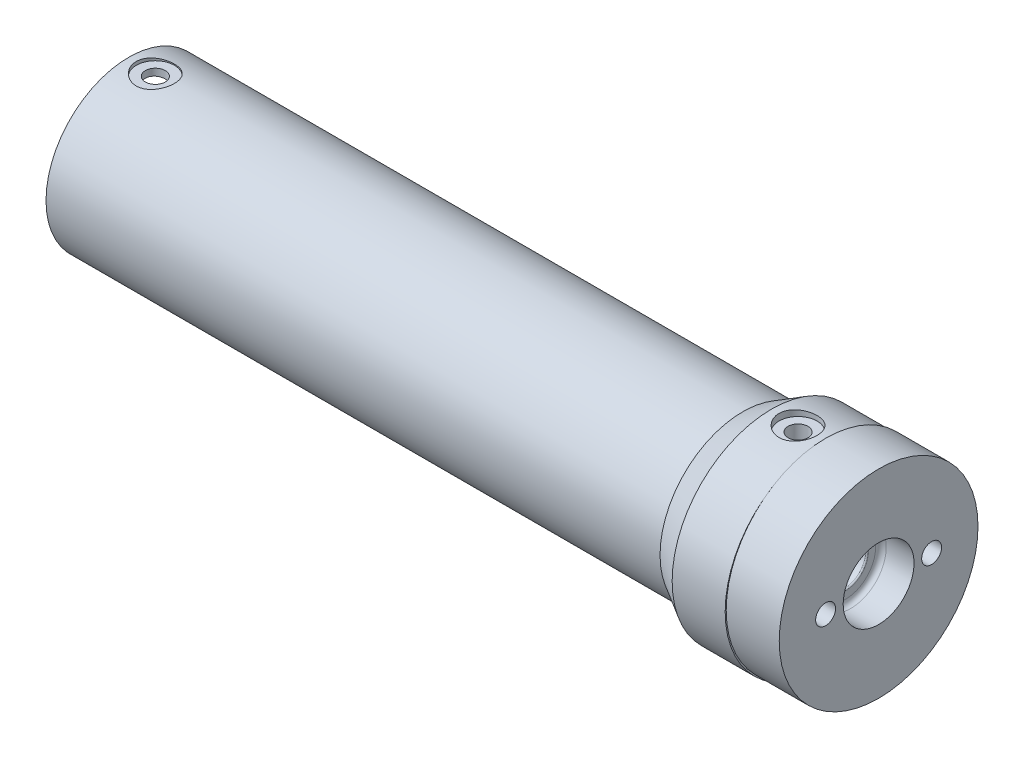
ISO-10303-21;
HEADER;
FILE_DESCRIPTION(('STEP AP214'),'2;1');
FILE_NAME('part.step','',(''),(''),'','','');
FILE_SCHEMA(('AUTOMOTIVE_DESIGN { 1 0 10303 214 1 1 1 1 }'));
ENDSEC;
DATA;
#1=APPLICATION_CONTEXT('core data for automotive mechanical design processes');
#2=APPLICATION_PROTOCOL_DEFINITION('international standard','automotive_design',2000,#1);
#3=PRODUCT_CONTEXT('',#1,'mechanical');
#4=PRODUCT('Part','Part','',(#3));
#5=PRODUCT_RELATED_PRODUCT_CATEGORY('part','',(#4));
#6=PRODUCT_DEFINITION_FORMATION('','',#4);
#7=PRODUCT_DEFINITION_CONTEXT('part definition',#1,'design');
#8=PRODUCT_DEFINITION('design','',#6,#7);
#9=PRODUCT_DEFINITION_SHAPE('','',#8);
#10=(LENGTH_UNIT() NAMED_UNIT(*) SI_UNIT(.MILLI.,.METRE.));
#11=(NAMED_UNIT(*) PLANE_ANGLE_UNIT() SI_UNIT($,.RADIAN.));
#12=(NAMED_UNIT(*) SI_UNIT($,.STERADIAN.) SOLID_ANGLE_UNIT());
#13=UNCERTAINTY_MEASURE_WITH_UNIT(LENGTH_MEASURE(1.E-05),#10,'distance_accuracy_value','');
#14=(GEOMETRIC_REPRESENTATION_CONTEXT(3) GLOBAL_UNCERTAINTY_ASSIGNED_CONTEXT((#13)) GLOBAL_UNIT_ASSIGNED_CONTEXT((#10,
#11,#12)) REPRESENTATION_CONTEXT('',''));
#15=CARTESIAN_POINT('',(0.,0.,0.));
#16=DIRECTION('',(0.,0.,1.));
#17=DIRECTION('',(1.,0.,0.));
#18=AXIS2_PLACEMENT_3D('',#15,#16,#17);
#19=CARTESIAN_POINT('',(67.0440089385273,0.150005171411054,-0.115317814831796));
#20=DIRECTION('',(-1.00000000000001,0.,0.));
#21=DIRECTION('',(0.,0.,1.));
#22=AXIS2_PLACEMENT_3D('',#19,#20,#21);
#23=CYLINDRICAL_SURFACE('',#22,10.875);
#24=CARTESIAN_POINT('',(91.8440089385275,0.150005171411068,-0.115317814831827));
#25=DIRECTION('',(-1.00000000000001,0.,0.));
#26=DIRECTION('',(0.,0.,1.));
#27=AXIS2_PLACEMENT_3D('',#24,#25,#26);
#28=CIRCLE('',#27,10.875);
#29=CARTESIAN_POINT('',(91.8440089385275,0.150005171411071,10.7596821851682));
#30=VERTEX_POINT('',#29);
#31=EDGE_CURVE('E209',#30,#30,#28,.T.);
#32=ORIENTED_EDGE('',*,*,#31,.T.);
#33=EDGE_LOOP('',(#32));
#34=FACE_BOUND('',#33,.T.);
#35=CARTESIAN_POINT('',(67.5440089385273,0.150005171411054,-0.115317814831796));
#36=DIRECTION('',(1.00000000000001,0.,0.));
#37=DIRECTION('',(0.,0.,-1.));
#38=AXIS2_PLACEMENT_3D('',#35,#36,#37);
#39=CIRCLE('',#38,10.875);
#40=CARTESIAN_POINT('',(67.5440089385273,0.150005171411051,-10.9903178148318));
#41=VERTEX_POINT('',#40);
#42=EDGE_CURVE('E212',#41,#41,#39,.T.);
#43=ORIENTED_EDGE('',*,*,#42,.T.);
#44=EDGE_LOOP('',(#43));
#45=FACE_BOUND('',#44,.T.);
#46=ADVANCED_FACE('F47',(#34,#45),#23,.T.);
#47=CARTESIAN_POINT('',(92.0440089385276,11.0250051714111,-0.115317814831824));
#48=DIRECTION('',(-1.00000000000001,0.,0.));
#49=DIRECTION('',(0.,0.,1.));
#50=AXIS2_PLACEMENT_3D('',#47,#48,#49);
#51=PLANE('',#50);
#52=CARTESIAN_POINT('',(92.0440089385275,0.150005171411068,-0.115317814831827));
#53=DIRECTION('',(-1.00000000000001,0.,0.));
#54=DIRECTION('',(0.,0.,1.));
#55=AXIS2_PLACEMENT_3D('',#52,#53,#54);
#56=CIRCLE('',#55,10.675);
#57=CARTESIAN_POINT('',(92.0440089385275,0.150005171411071,10.5596821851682));
#58=VERTEX_POINT('',#57);
#59=EDGE_CURVE('E378',#58,#58,#56,.F.);
#60=ORIENTED_EDGE('',*,*,#59,.T.);
#61=EDGE_LOOP('',(#60));
#62=FACE_BOUND('',#61,.T.);
#63=CARTESIAN_POINT('',(92.0440089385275,0.150005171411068,-0.115317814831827));
#64=DIRECTION('',(-1.00000000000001,0.,0.));
#65=DIRECTION('',(0.,0.,1.));
#66=AXIS2_PLACEMENT_3D('',#63,#64,#65);
#67=CIRCLE('',#66,9.425);
#68=CARTESIAN_POINT('',(92.0440089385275,0.15000517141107,9.30968218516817));
#69=VERTEX_POINT('',#68);
#70=EDGE_CURVE('E360',#69,#69,#67,.T.);
#71=ORIENTED_EDGE('',*,*,#70,.T.);
#72=EDGE_LOOP('',(#71));
#73=FACE_BOUND('',#72,.T.);
#74=ADVANCED_FACE('F199',(#62,#73),#51,.F.);
#75=CARTESIAN_POINT('',(67.0440089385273,0.150005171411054,-0.115317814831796));
#76=DIRECTION('',(-1.00000000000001,0.,0.));
#77=DIRECTION('',(0.,0.,1.));
#78=AXIS2_PLACEMENT_3D('',#75,#76,#77);
#79=CYLINDRICAL_SURFACE('',#78,8.625);
#80=CARTESIAN_POINT('',(96.2440089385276,0.150005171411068,-0.115317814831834));
#81=DIRECTION('',(1.00000000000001,0.,0.));
#82=DIRECTION('',(0.,0.,-1.));
#83=AXIS2_PLACEMENT_3D('',#80,#81,#82);
#84=CIRCLE('',#83,8.625);
#85=CARTESIAN_POINT('',(96.2440089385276,0.150005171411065,-8.74031781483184));
#86=VERTEX_POINT('',#85);
#87=EDGE_CURVE('E218',#86,#86,#84,.F.);
#88=ORIENTED_EDGE('',*,*,#87,.T.);
#89=EDGE_LOOP('',(#88));
#90=FACE_BOUND('',#89,.T.);
#91=CARTESIAN_POINT('',(92.8440089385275,0.150005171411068,-0.115317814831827));
#92=DIRECTION('',(-1.00000000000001,0.,0.));
#93=DIRECTION('',(0.,0.,1.));
#94=AXIS2_PLACEMENT_3D('',#91,#92,#93);
#95=CIRCLE('',#94,8.625);
#96=CARTESIAN_POINT('',(92.8440089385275,0.15000517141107,8.50968218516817));
#97=VERTEX_POINT('',#96);
#98=EDGE_CURVE('E214',#97,#97,#95,.F.);
#99=ORIENTED_EDGE('',*,*,#98,.T.);
#100=EDGE_LOOP('',(#99));
#101=FACE_BOUND('',#100,.T.);
#102=ADVANCED_FACE('F204',(#90,#101),#79,.T.);
#103=CARTESIAN_POINT('',(97.0440089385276,8.77500517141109,-0.115317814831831));
#104=DIRECTION('',(1.00000000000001,0.,0.));
#105=DIRECTION('',(0.,0.,-1.));
#106=AXIS2_PLACEMENT_3D('',#103,#104,#105);
#107=PLANE('',#106);
#108=CARTESIAN_POINT('',(97.0440089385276,0.150005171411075,-0.115317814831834));
#109=DIRECTION('',(1.00000000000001,0.,0.));
#110=DIRECTION('',(0.,0.,-1.));
#111=AXIS2_PLACEMENT_3D('',#108,#109,#110);
#112=CIRCLE('',#111,10.675);
#113=CARTESIAN_POINT('',(97.0440089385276,0.150005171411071,-10.7903178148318));
#114=VERTEX_POINT('',#113);
#115=EDGE_CURVE('E54',#114,#114,#112,.F.);
#116=ORIENTED_EDGE('',*,*,#115,.T.);
#117=EDGE_LOOP('',(#116));
#118=FACE_BOUND('',#117,.T.);
#119=CARTESIAN_POINT('',(97.0440089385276,0.150005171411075,-0.115317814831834));
#120=DIRECTION('',(1.00000000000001,0.,0.));
#121=DIRECTION('',(0.,0.,-1.));
#122=AXIS2_PLACEMENT_3D('',#119,#120,#121);
#123=CIRCLE('',#122,9.425);
#124=CARTESIAN_POINT('',(97.0440089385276,0.150005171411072,-9.54031781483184));
#125=VERTEX_POINT('',#124);
#126=EDGE_CURVE('E356',#125,#125,#123,.T.);
#127=ORIENTED_EDGE('',*,*,#126,.T.);
#128=EDGE_LOOP('',(#127));
#129=FACE_BOUND('',#128,.T.);
#130=ADVANCED_FACE('F285',(#118,#129),#107,.F.);
#131=CARTESIAN_POINT('',(67.0440089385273,0.150005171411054,-0.115317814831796));
#132=DIRECTION('',(-1.00000000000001,0.,0.));
#133=DIRECTION('',(0.,0.,1.));
#134=AXIS2_PLACEMENT_3D('',#131,#132,#133);
#135=CYLINDRICAL_SURFACE('',#134,10.875);
#136=CARTESIAN_POINT('',(97.2440089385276,0.150005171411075,-0.115317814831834));
#137=DIRECTION('',(1.00000000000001,0.,0.));
#138=DIRECTION('',(0.,0.,-1.));
#139=AXIS2_PLACEMENT_3D('',#136,#137,#138);
#140=CIRCLE('',#139,10.875);
#141=CARTESIAN_POINT('',(97.2440089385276,0.150005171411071,-10.9903178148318));
#142=VERTEX_POINT('',#141);
#143=EDGE_CURVE('E12',#142,#142,#140,.T.);
#144=ORIENTED_EDGE('',*,*,#143,.T.);
#145=EDGE_LOOP('',(#144));
#146=FACE_BOUND('',#145,.T.);
#147=CARTESIAN_POINT('',(101.044008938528,-10.6529168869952,-1.36531781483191));
#148=CARTESIAN_POINT('',(100.974045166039,-10.6529178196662,-1.36531481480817));
#149=CARTESIAN_POINT('',(100.904036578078,-10.6536038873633,-1.35942409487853));
#150=CARTESIAN_POINT('',(100.765964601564,-10.6562732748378,-1.33601620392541));
#151=CARTESIAN_POINT('',(100.697903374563,-10.6582579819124,-1.31848659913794));
#152=CARTESIAN_POINT('',(100.565745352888,-10.6632969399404,-1.272321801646));
#153=CARTESIAN_POINT('',(100.501646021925,-10.6663504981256,-1.243693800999));
#154=CARTESIAN_POINT('',(100.3791744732,-10.6731822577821,-1.17615960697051));
#155=CARTESIAN_POINT('',(100.320801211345,-10.6769603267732,-1.13725529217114));
#156=CARTESIAN_POINT('',(100.211148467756,-10.684835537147,-1.05007444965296));
#157=CARTESIAN_POINT('',(100.159900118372,-10.688933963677,-1.00175887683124));
#158=CARTESIAN_POINT('',(100.066220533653,-10.6969765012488,-0.897210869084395));
#159=CARTESIAN_POINT('',(100.023789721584,-10.7009206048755,-0.8409780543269));
#160=CARTESIAN_POINT('',(99.9488395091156,-10.7082230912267,-0.721997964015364));
#161=CARTESIAN_POINT('',(99.9163480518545,-10.7115798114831,-0.659232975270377));
#162=CARTESIAN_POINT('',(99.8623777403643,-10.7173152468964,-0.529092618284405));
#163=CARTESIAN_POINT('',(99.8408985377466,-10.7196939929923,-0.461717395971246));
#164=CARTESIAN_POINT('',(99.8096548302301,-10.7231964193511,-0.324586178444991));
#165=CARTESIAN_POINT('',(99.7998387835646,-10.7243256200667,-0.254842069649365));
#166=CARTESIAN_POINT('',(99.792040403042,-10.7252205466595,-0.114687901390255));
#167=CARTESIAN_POINT('',(99.7940576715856,-10.7249863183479,-0.0442778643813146));
#168=CARTESIAN_POINT('',(99.8098271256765,-10.7231852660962,0.0948591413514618));
#169=CARTESIAN_POINT('',(99.8235238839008,-10.721624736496,0.163592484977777));
#170=CARTESIAN_POINT('',(99.8621769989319,-10.717353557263,0.297778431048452));
#171=CARTESIAN_POINT('',(99.8871335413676,-10.7146428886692,0.363230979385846));
#172=CARTESIAN_POINT('',(99.9476575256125,-10.7083652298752,0.489170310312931));
#173=CARTESIAN_POINT('',(99.9832491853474,-10.7047962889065,0.549645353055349));
#174=CARTESIAN_POINT('',(100.064015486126,-10.6972018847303,0.663784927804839));
#175=CARTESIAN_POINT('',(100.109190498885,-10.6931764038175,0.717449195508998));
#176=CARTESIAN_POINT('',(100.208152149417,-10.6850924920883,0.816769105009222));
#177=CARTESIAN_POINT('',(100.261987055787,-10.6810340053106,0.86237666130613));
#178=CARTESIAN_POINT('',(100.376573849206,-10.6733645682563,0.943915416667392));
#179=CARTESIAN_POINT('',(100.437325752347,-10.6697536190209,0.979846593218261));
#180=CARTESIAN_POINT('',(100.56406233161,-10.6633880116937,1.04101410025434));
#181=CARTESIAN_POINT('',(100.630048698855,-10.6606336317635,1.06624695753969));
#182=CARTESIAN_POINT('',(100.765360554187,-10.6562986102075,1.10526089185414));
#183=CARTESIAN_POINT('',(100.83468590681,-10.6547179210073,1.11904243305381));
#184=CARTESIAN_POINT('',(100.974284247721,-10.6529177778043,1.13469963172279));
#185=CARTESIAN_POINT('',(101.044549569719,-10.6526906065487,1.13664278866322));
#186=CARTESIAN_POINT('',(101.184404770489,-10.6536028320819,1.12874580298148));
#187=CARTESIAN_POINT('',(101.253994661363,-10.654742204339,1.11890587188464));
#188=CARTESIAN_POINT('',(101.390323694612,-10.658252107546,1.08777871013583));
#189=CARTESIAN_POINT('',(101.457070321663,-10.6606191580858,1.0665238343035));
#190=CARTESIAN_POINT('',(101.586051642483,-10.6663148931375,1.01320331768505));
#191=CARTESIAN_POINT('',(101.648286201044,-10.6696436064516,0.981137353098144));
#192=CARTESIAN_POINT('',(101.76678314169,-10.676906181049,0.906937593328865));
#193=CARTESIAN_POINT('',(101.823017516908,-10.6808426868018,0.864759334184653));
#194=CARTESIAN_POINT('',(101.927632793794,-10.6888688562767,0.771595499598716));
#195=CARTESIAN_POINT('',(101.976013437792,-10.6929585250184,0.720609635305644));
#196=CARTESIAN_POINT('',(102.063783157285,-10.7008537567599,0.610983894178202));
#197=CARTESIAN_POINT('',(102.103128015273,-10.7046578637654,0.552308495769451));
#198=CARTESIAN_POINT('',(102.171404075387,-10.7115318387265,0.429143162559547));
#199=CARTESIAN_POINT('',(102.20033545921,-10.7146017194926,0.364653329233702));
#200=CARTESIAN_POINT('',(102.24688947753,-10.7196548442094,0.231839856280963));
#201=CARTESIAN_POINT('',(102.264538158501,-10.7216405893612,0.163525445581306));
#202=CARTESIAN_POINT('',(102.288110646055,-10.7243120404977,0.0248787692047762));
#203=CARTESIAN_POINT('',(102.294034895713,-10.7249977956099,-0.0454534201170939));
#204=CARTESIAN_POINT('',(102.293982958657,-10.724991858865,-0.185706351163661));
#205=CARTESIAN_POINT('',(102.288075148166,-10.7243080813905,-0.255627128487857));
#206=CARTESIAN_POINT('',(102.264670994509,-10.721655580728,-0.393475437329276));
#207=CARTESIAN_POINT('',(102.247174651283,-10.7196868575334,-0.461402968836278));
#208=CARTESIAN_POINT('',(102.201110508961,-10.7146848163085,-0.593331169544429));
#209=CARTESIAN_POINT('',(102.172545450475,-10.7116517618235,-0.657332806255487));
#210=CARTESIAN_POINT('',(102.105161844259,-10.7048578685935,-0.779644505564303));
#211=CARTESIAN_POINT('',(102.066343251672,-10.7010970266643,-0.837954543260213));
#212=CARTESIAN_POINT('',(101.979299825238,-10.6932420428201,-0.947577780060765));
#213=CARTESIAN_POINT('',(101.931024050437,-10.6891461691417,-0.998850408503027));
#214=CARTESIAN_POINT('',(101.826540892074,-10.6810970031,-1.0925948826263));
#215=CARTESIAN_POINT('',(101.770331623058,-10.6771437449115,-1.13506463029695));
#216=CARTESIAN_POINT('',(101.651368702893,-10.6698135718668,-1.21011378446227));
#217=CARTESIAN_POINT('',(101.588594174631,-10.6664385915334,-1.24266026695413));
#218=CARTESIAN_POINT('',(101.458469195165,-10.6606698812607,-1.29670483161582));
#219=CARTESIAN_POINT('',(101.391123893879,-10.6582750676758,-1.3182151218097));
#220=CARTESIAN_POINT('',(101.27684773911,-10.6553290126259,-1.3443345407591));
#221=CARTESIAN_POINT('',(101.2306421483,-10.6544288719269,-1.35219219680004));
#222=CARTESIAN_POINT('',(101.137634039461,-10.6532224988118,-1.36268482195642));
#223=CARTESIAN_POINT('',(101.090831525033,-10.652916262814,-1.36531982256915));
#224=CARTESIAN_POINT('',(101.044008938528,-10.6529168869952,-1.36531781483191));
#225=B_SPLINE_CURVE_WITH_KNOTS('',3,(#147,#148,#149,#150,#151,#152,#153,#154,#155,#156,#157,
#158,#159,#160,#161,#162,#163,#164,#165,#166,#167,#168,#169,#170,#171,#172,#173,#174,#175,#176,
#177,#178,#179,#180,#181,#182,#183,#184,#185,#186,#187,#188,#189,#190,#191,#192,#193,#194,#195,
#196,#197,#198,#199,#200,#201,#202,#203,#204,#205,#206,#207,#208,#209,#210,#211,#212,#213,#214,
#215,#216,#217,#218,#219,#220,#221,#222,#223,#224),.UNSPECIFIED.,.T.,.F.,(4,2,2,2,2,2,2,2,2,2,2,
2,2,2,2,2,2,2,2,2,2,2,2,2,2,2,2,2,2,2,2,2,2,2,2,2,2,2,4),(0.,0.209720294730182,
0.419664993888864,0.629473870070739,0.839244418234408,1.04990454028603,1.26057477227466,
1.47183194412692,1.68308243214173,1.89339584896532,2.10370219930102,2.31301601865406,
2.52233328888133,2.73213088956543,2.94193662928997,3.15295511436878,3.3639740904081,
3.57506152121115,3.78614039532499,3.99601461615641,4.20588506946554,4.41516377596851,
4.62444875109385,4.83467140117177,5.04490094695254,5.25613833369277,5.46737203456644,
5.67811631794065,5.88885263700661,6.09837464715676,6.30789665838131,6.5173668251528,
6.72683790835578,6.93746996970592,7.14815217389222,7.35952597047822,7.57066544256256,
7.71101959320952,7.85137289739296),.UNSPECIFIED.);
#226=CARTESIAN_POINT('',(101.044008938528,-10.6529168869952,-1.36531781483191));
#227=VERTEX_POINT('',#226);
#228=EDGE_CURVE('E138',#227,#227,#225,.T.);
#229=ORIENTED_EDGE('',*,*,#228,.T.);
#230=EDGE_LOOP('',(#229));
#231=FACE_BOUND('',#230,.T.);
#232=CARTESIAN_POINT('',(101.044008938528,10.9529272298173,1.13468218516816));
#233=CARTESIAN_POINT('',(100.974045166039,10.9529281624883,1.13467918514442));
#234=CARTESIAN_POINT('',(100.904036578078,10.9536142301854,1.12878846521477));
#235=CARTESIAN_POINT('',(100.765964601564,10.9562836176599,1.10538057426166));
#236=CARTESIAN_POINT('',(100.697903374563,10.9582683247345,1.08785096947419));
#237=CARTESIAN_POINT('',(100.565745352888,10.9633072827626,1.04168617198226));
#238=CARTESIAN_POINT('',(100.501646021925,10.9663608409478,1.01305817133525));
#239=CARTESIAN_POINT('',(100.3791744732,10.9731926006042,0.945523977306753));
#240=CARTESIAN_POINT('',(100.320801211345,10.9769706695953,0.906619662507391));
#241=CARTESIAN_POINT('',(100.211148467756,10.9848458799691,0.819438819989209));
#242=CARTESIAN_POINT('',(100.159900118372,10.9889443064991,0.771123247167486));
#243=CARTESIAN_POINT('',(100.066220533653,10.996986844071,0.666575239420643));
#244=CARTESIAN_POINT('',(100.023789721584,11.0009309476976,0.610342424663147));
#245=CARTESIAN_POINT('',(99.9488395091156,11.0082334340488,0.491362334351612));
#246=CARTESIAN_POINT('',(99.9163480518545,11.0115901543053,0.428597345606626));
#247=CARTESIAN_POINT('',(99.8623777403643,11.0173255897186,0.298456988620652));
#248=CARTESIAN_POINT('',(99.8408985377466,11.0197043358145,0.231081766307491));
#249=CARTESIAN_POINT('',(99.8096548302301,11.0232067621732,0.0939505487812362));
#250=CARTESIAN_POINT('',(99.7998387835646,11.0243359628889,0.0242064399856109));
#251=CARTESIAN_POINT('',(99.792040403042,11.0252308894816,-0.115947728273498));
#252=CARTESIAN_POINT('',(99.7940576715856,11.02499666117,-0.186357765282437));
#253=CARTESIAN_POINT('',(99.8098271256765,11.0231956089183,-0.325494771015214));
#254=CARTESIAN_POINT('',(99.8235238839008,11.0216350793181,-0.39422811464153));
#255=CARTESIAN_POINT('',(99.8621769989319,11.0173639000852,-0.528414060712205));
#256=CARTESIAN_POINT('',(99.8871335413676,11.0146532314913,-0.593866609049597));
#257=CARTESIAN_POINT('',(99.9476575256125,11.0083755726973,-0.719805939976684));
#258=CARTESIAN_POINT('',(99.9832491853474,11.0048066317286,-0.780280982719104));
#259=CARTESIAN_POINT('',(100.064015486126,10.9972122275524,-0.894420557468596));
#260=CARTESIAN_POINT('',(100.109190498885,10.9931867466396,-0.948084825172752));
#261=CARTESIAN_POINT('',(100.208152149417,10.9851028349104,-1.04740473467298));
#262=CARTESIAN_POINT('',(100.261987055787,10.9810443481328,-1.09301229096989));
#263=CARTESIAN_POINT('',(100.376573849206,10.9733749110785,-1.17455104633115));
#264=CARTESIAN_POINT('',(100.437325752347,10.969763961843,-1.21048222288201));
#265=CARTESIAN_POINT('',(100.56406233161,10.9633983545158,-1.27164972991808));
#266=CARTESIAN_POINT('',(100.630048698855,10.9606439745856,-1.29688258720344));
#267=CARTESIAN_POINT('',(100.765360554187,10.9563089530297,-1.33589652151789));
#268=CARTESIAN_POINT('',(100.83468590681,10.9547282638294,-1.34967806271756));
#269=CARTESIAN_POINT('',(100.974284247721,10.9529281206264,-1.36533526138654));
#270=CARTESIAN_POINT('',(101.044549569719,10.9527009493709,-1.36727841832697));
#271=CARTESIAN_POINT('',(101.184404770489,10.953613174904,-1.35938143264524));
#272=CARTESIAN_POINT('',(101.253994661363,10.9547525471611,-1.34954150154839));
#273=CARTESIAN_POINT('',(101.390323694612,10.9582624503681,-1.31841433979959));
#274=CARTESIAN_POINT('',(101.457070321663,10.960629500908,-1.29715946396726));
#275=CARTESIAN_POINT('',(101.586051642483,10.9663252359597,-1.24383894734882));
#276=CARTESIAN_POINT('',(101.648286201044,10.9696539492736,-1.2117729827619));
#277=CARTESIAN_POINT('',(101.76678314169,10.9769165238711,-1.13757322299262));
#278=CARTESIAN_POINT('',(101.823017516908,10.980853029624,-1.09539496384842));
#279=CARTESIAN_POINT('',(101.927632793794,10.9888791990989,-1.00223112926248));
#280=CARTESIAN_POINT('',(101.976013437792,10.9929688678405,-0.951245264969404));
#281=CARTESIAN_POINT('',(102.063783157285,11.000864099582,-0.841619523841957));
#282=CARTESIAN_POINT('',(102.103128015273,11.0046682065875,-0.782944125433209));
#283=CARTESIAN_POINT('',(102.171404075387,11.0115421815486,-0.659778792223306));
#284=CARTESIAN_POINT('',(102.20033545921,11.0146120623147,-0.59528895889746));
#285=CARTESIAN_POINT('',(102.24688947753,11.0196651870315,-0.462475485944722));
#286=CARTESIAN_POINT('',(102.264538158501,11.0216509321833,-0.394161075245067));
#287=CARTESIAN_POINT('',(102.288110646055,11.0243223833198,-0.255514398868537));
#288=CARTESIAN_POINT('',(102.294034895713,11.025008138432,-0.185182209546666));
#289=CARTESIAN_POINT('',(102.293982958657,11.0250022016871,-0.0449292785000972));
#290=CARTESIAN_POINT('',(102.288075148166,11.0243184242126,0.0249914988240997));
#291=CARTESIAN_POINT('',(102.264670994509,11.0216659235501,0.162839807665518));
#292=CARTESIAN_POINT('',(102.247174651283,11.0196972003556,0.230767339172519));
#293=CARTESIAN_POINT('',(102.201110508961,11.0146951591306,0.362695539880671));
#294=CARTESIAN_POINT('',(102.172545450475,11.0116621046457,0.426697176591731));
#295=CARTESIAN_POINT('',(102.105161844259,11.0048682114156,0.549008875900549));
#296=CARTESIAN_POINT('',(102.066343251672,11.0011073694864,0.607318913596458));
#297=CARTESIAN_POINT('',(101.979299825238,10.9932523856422,0.716942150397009));
#298=CARTESIAN_POINT('',(101.931024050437,10.9891565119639,0.768214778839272));
#299=CARTESIAN_POINT('',(101.826540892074,10.9811073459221,0.861959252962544));
#300=CARTESIAN_POINT('',(101.770331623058,10.9771540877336,0.904429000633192));
#301=CARTESIAN_POINT('',(101.651368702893,10.9698239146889,0.979478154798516));
#302=CARTESIAN_POINT('',(101.588594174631,10.9664489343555,1.01202463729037));
#303=CARTESIAN_POINT('',(101.458469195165,10.9606802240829,1.06606920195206));
#304=CARTESIAN_POINT('',(101.391123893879,10.9582854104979,1.08757949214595));
#305=CARTESIAN_POINT('',(101.27684773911,10.955339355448,1.11369891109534));
#306=CARTESIAN_POINT('',(101.2306421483,10.9544392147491,1.12155656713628));
#307=CARTESIAN_POINT('',(101.137634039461,10.953232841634,1.13204919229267));
#308=CARTESIAN_POINT('',(101.090831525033,10.9529266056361,1.1346841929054));
#309=CARTESIAN_POINT('',(101.044008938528,10.9529272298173,1.13468218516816));
#310=B_SPLINE_CURVE_WITH_KNOTS('',3,(#232,#233,#234,#235,#236,#237,#238,#239,#240,#241,#242,
#243,#244,#245,#246,#247,#248,#249,#250,#251,#252,#253,#254,#255,#256,#257,#258,#259,#260,#261,
#262,#263,#264,#265,#266,#267,#268,#269,#270,#271,#272,#273,#274,#275,#276,#277,#278,#279,#280,
#281,#282,#283,#284,#285,#286,#287,#288,#289,#290,#291,#292,#293,#294,#295,#296,#297,#298,#299,
#300,#301,#302,#303,#304,#305,#306,#307,#308,#309),.UNSPECIFIED.,.T.,.F.,(4,2,2,2,2,2,2,2,2,2,2,
2,2,2,2,2,2,2,2,2,2,2,2,2,2,2,2,2,2,2,2,2,2,2,2,2,2,2,4),(0.,0.209720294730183,
0.419664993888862,0.629473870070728,0.839244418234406,1.04990454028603,1.26057477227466,
1.47183194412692,1.68308243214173,1.89339584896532,2.10370219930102,2.31301601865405,
2.52233328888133,2.73213088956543,2.94193662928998,3.15295511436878,3.3639740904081,
3.57506152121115,3.78614039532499,3.99601461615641,4.20588506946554,4.41516377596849,
4.62444875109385,4.83467140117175,5.04490094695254,5.25613833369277,5.46737203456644,
5.67811631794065,5.88885263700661,6.09837464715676,6.30789665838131,6.51736682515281,
6.72683790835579,6.93746996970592,7.14815217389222,7.35952597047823,7.57066544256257,
7.71101959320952,7.85137289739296),.UNSPECIFIED.);
#311=CARTESIAN_POINT('',(101.044008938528,10.9529272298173,1.13468218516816));
#312=VERTEX_POINT('',#311);
#313=EDGE_CURVE('E225',#312,#312,#310,.T.);
#314=ORIENTED_EDGE('',*,*,#313,.T.);
#315=EDGE_LOOP('',(#314));
#316=FACE_BOUND('',#315,.T.);
#317=CARTESIAN_POINT('',(105.044008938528,0.150005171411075,-0.115317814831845));
#318=DIRECTION('',(-1.00000000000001,0.,0.));
#319=DIRECTION('',(0.,0.,1.));
#320=AXIS2_PLACEMENT_3D('',#317,#318,#319);
#321=CIRCLE('',#320,10.875);
#322=CARTESIAN_POINT('',(105.044008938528,0.150005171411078,10.7596821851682));
#323=VERTEX_POINT('',#322);
#324=EDGE_CURVE('E221',#323,#323,#321,.T.);
#325=ORIENTED_EDGE('',*,*,#324,.T.);
#326=EDGE_LOOP('',(#325));
#327=FACE_BOUND('',#326,.T.);
#328=ADVANCED_FACE('F234',(#146,#231,#316,#327),#135,.T.);
#329=CARTESIAN_POINT('',(105.044008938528,11.0250051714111,-0.115317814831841));
#330=DIRECTION('',(1.00000000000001,0.,0.));
#331=DIRECTION('',(0.,0.,-1.));
#332=AXIS2_PLACEMENT_3D('',#329,#330,#331);
#333=PLANE('',#332);
#334=ORIENTED_EDGE('',*,*,#324,.F.);
#335=EDGE_LOOP('',(#334));
#336=FACE_BOUND('',#335,.T.);
#337=CARTESIAN_POINT('',(105.044008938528,0.150005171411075,-0.115317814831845));
#338=DIRECTION('',(-1.00000000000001,0.,0.));
#339=DIRECTION('',(0.,0.,1.));
#340=AXIS2_PLACEMENT_3D('',#337,#338,#339);
#341=CIRCLE('',#340,15.);
#342=CARTESIAN_POINT('',(105.044008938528,0.150005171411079,14.8846821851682));
#343=VERTEX_POINT('',#342);
#344=EDGE_CURVE('E292',#343,#343,#341,.T.);
#345=ORIENTED_EDGE('',*,*,#344,.T.);
#346=EDGE_LOOP('',(#345));
#347=FACE_BOUND('',#346,.T.);
#348=ADVANCED_FACE('F278',(#336,#347),#333,.F.);
#349=CARTESIAN_POINT('',(67.0440089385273,0.150005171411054,-0.115317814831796));
#350=DIRECTION('',(-1.00000000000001,0.,0.));
#351=DIRECTION('',(0.,0.,1.));
#352=AXIS2_PLACEMENT_3D('',#349,#350,#351);
#353=CYLINDRICAL_SURFACE('',#352,15.);
#354=ORIENTED_EDGE('',*,*,#344,.F.);
#355=EDGE_LOOP('',(#354));
#356=FACE_BOUND('',#355,.T.);
#357=CARTESIAN_POINT('',(113.044008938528,0.150005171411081,-0.115317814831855));
#358=DIRECTION('',(-1.00000000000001,0.,0.));
#359=DIRECTION('',(0.,0.,1.));
#360=AXIS2_PLACEMENT_3D('',#357,#358,#359);
#361=CIRCLE('',#360,15.);
#362=CARTESIAN_POINT('',(113.044008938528,0.150005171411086,14.8846821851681));
#363=VERTEX_POINT('',#362);
#364=EDGE_CURVE('E293',#363,#363,#361,.T.);
#365=ORIENTED_EDGE('',*,*,#364,.T.);
#366=EDGE_LOOP('',(#365));
#367=FACE_BOUND('',#366,.T.);
#368=ADVANCED_FACE('F275',(#356,#367),#353,.T.);
#369=CARTESIAN_POINT('',(113.044008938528,15.1500051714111,-0.115317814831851));
#370=DIRECTION('',(-1.00000000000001,0.,0.));
#371=DIRECTION('',(0.,0.,1.));
#372=AXIS2_PLACEMENT_3D('',#369,#370,#371);
#373=PLANE('',#372);
#374=CARTESIAN_POINT('',(113.044008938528,0.150005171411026,7.88468218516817));
#375=DIRECTION('',(1.00000000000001,0.,0.));
#376=DIRECTION('',(0.,0.,-1.));
#377=AXIS2_PLACEMENT_3D('',#374,#375,#376);
#378=CIRCLE('',#377,1.5);
#379=CARTESIAN_POINT('',(113.044008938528,0.150005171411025,6.38468218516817));
#380=VERTEX_POINT('',#379);
#381=EDGE_CURVE('E135',#380,#380,#378,.T.);
#382=ORIENTED_EDGE('',*,*,#381,.F.);
#383=EDGE_LOOP('',(#382));
#384=FACE_BOUND('',#383,.T.);
#385=CARTESIAN_POINT('',(113.044008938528,0.150005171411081,-8.11531781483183));
#386=DIRECTION('',(1.00000000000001,0.,0.));
#387=DIRECTION('',(0.,0.,-1.));
#388=AXIS2_PLACEMENT_3D('',#385,#386,#387);
#389=CIRCLE('',#388,1.5);
#390=CARTESIAN_POINT('',(113.044008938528,0.150005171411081,-9.61531781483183));
#391=VERTEX_POINT('',#390);
#392=EDGE_CURVE('E310',#391,#391,#389,.T.);
#393=ORIENTED_EDGE('',*,*,#392,.F.);
#394=EDGE_LOOP('',(#393));
#395=FACE_BOUND('',#394,.T.);
#396=ORIENTED_EDGE('',*,*,#364,.F.);
#397=EDGE_LOOP('',(#396));
#398=FACE_BOUND('',#397,.T.);
#399=CARTESIAN_POINT('',(113.044008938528,0.150005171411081,-0.115317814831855));
#400=DIRECTION('',(-1.00000000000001,0.,0.));
#401=DIRECTION('',(0.,0.,1.));
#402=AXIS2_PLACEMENT_3D('',#399,#400,#401);
#403=CIRCLE('',#402,5.35);
#404=CARTESIAN_POINT('',(113.044008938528,0.150005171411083,5.23468218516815));
#405=VERTEX_POINT('',#404);
#406=EDGE_CURVE('E296',#405,#405,#403,.T.);
#407=ORIENTED_EDGE('',*,*,#406,.T.);
#408=EDGE_LOOP('',(#407));
#409=FACE_BOUND('',#408,.T.);
#410=ADVANCED_FACE('F271',(#384,#395,#398,#409),#373,.F.);
#411=CARTESIAN_POINT('',(67.0440089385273,0.150005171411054,-0.115317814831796));
#412=DIRECTION('',(-1.00000000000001,0.,0.));
#413=DIRECTION('',(0.,0.,1.));
#414=AXIS2_PLACEMENT_3D('',#411,#412,#413);
#415=CYLINDRICAL_SURFACE('',#414,5.35);
#416=CARTESIAN_POINT('',(108.844008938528,0.150005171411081,-0.115317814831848));
#417=DIRECTION('',(-1.00000000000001,0.,0.));
#418=DIRECTION('',(0.,0.,1.));
#419=AXIS2_PLACEMENT_3D('',#416,#417,#418);
#420=CIRCLE('',#419,5.35);
#421=CARTESIAN_POINT('',(108.844008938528,0.150005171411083,5.23468218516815));
#422=VERTEX_POINT('',#421);
#423=EDGE_CURVE('E365',#422,#422,#420,.T.);
#424=ORIENTED_EDGE('',*,*,#423,.T.);
#425=EDGE_LOOP('',(#424));
#426=FACE_BOUND('',#425,.T.);
#427=ORIENTED_EDGE('',*,*,#406,.F.);
#428=EDGE_LOOP('',(#427));
#429=FACE_BOUND('',#428,.T.);
#430=ADVANCED_FACE('F267',(#426,#429),#415,.F.);
#431=CARTESIAN_POINT('',(108.044008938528,3.40000517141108,-0.115317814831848));
#432=DIRECTION('',(-1.00000000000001,0.,0.));
#433=DIRECTION('',(0.,0.,1.));
#434=AXIS2_PLACEMENT_3D('',#431,#432,#433);
#435=PLANE('',#434);
#436=CARTESIAN_POINT('',(108.044008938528,0.150005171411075,-0.115317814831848));
#437=DIRECTION('',(-1.00000000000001,0.,0.));
#438=DIRECTION('',(0.,0.,1.));
#439=AXIS2_PLACEMENT_3D('',#436,#437,#438);
#440=CIRCLE('',#439,3.45);
#441=CARTESIAN_POINT('',(108.044008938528,0.150005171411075,3.33468218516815));
#442=VERTEX_POINT('',#441);
#443=EDGE_CURVE('E371',#442,#442,#440,.T.);
#444=ORIENTED_EDGE('',*,*,#443,.T.);
#445=EDGE_LOOP('',(#444));
#446=FACE_BOUND('',#445,.T.);
#447=CARTESIAN_POINT('',(108.044008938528,0.150005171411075,-0.115317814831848));
#448=DIRECTION('',(-1.00000000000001,0.,0.));
#449=DIRECTION('',(0.,0.,1.));
#450=AXIS2_PLACEMENT_3D('',#447,#448,#449);
#451=CIRCLE('',#450,4.55);
#452=CARTESIAN_POINT('',(108.044008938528,0.150005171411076,4.43468218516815));
#453=VERTEX_POINT('',#452);
#454=EDGE_CURVE('E105',#453,#453,#451,.F.);
#455=ORIENTED_EDGE('',*,*,#454,.T.);
#456=EDGE_LOOP('',(#455));
#457=FACE_BOUND('',#456,.T.);
#458=ADVANCED_FACE('F263',(#446,#457),#435,.F.);
#459=CARTESIAN_POINT('',(67.0440089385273,0.150005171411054,-0.115317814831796));
#460=DIRECTION('',(-1.00000000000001,0.,0.));
#461=DIRECTION('',(0.,0.,1.));
#462=AXIS2_PLACEMENT_3D('',#459,#460,#461);
#463=CYLINDRICAL_SURFACE('',#462,3.25);
#464=CARTESIAN_POINT('',(107.844008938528,0.150005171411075,-0.115317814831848));
#465=DIRECTION('',(-1.00000000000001,0.,0.));
#466=DIRECTION('',(0.,0.,1.));
#467=AXIS2_PLACEMENT_3D('',#464,#465,#466);
#468=CIRCLE('',#467,3.25);
#469=CARTESIAN_POINT('',(107.844008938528,0.150005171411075,3.13468218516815));
#470=VERTEX_POINT('',#469);
#471=EDGE_CURVE('E374',#470,#470,#468,.F.);
#472=ORIENTED_EDGE('',*,*,#471,.T.);
#473=EDGE_LOOP('',(#472));
#474=FACE_BOUND('',#473,.T.);
#475=CARTESIAN_POINT('',(98.5440089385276,0.150005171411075,-0.115317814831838));
#476=DIRECTION('',(-1.00000000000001,0.,0.));
#477=DIRECTION('',(0.,0.,1.));
#478=AXIS2_PLACEMENT_3D('',#475,#476,#477);
#479=CIRCLE('',#478,3.25);
#480=CARTESIAN_POINT('',(98.5440089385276,0.150005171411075,3.13468218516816));
#481=VERTEX_POINT('',#480);
#482=EDGE_CURVE('E301',#481,#481,#479,.T.);
#483=ORIENTED_EDGE('',*,*,#482,.T.);
#484=EDGE_LOOP('',(#483));
#485=FACE_BOUND('',#484,.T.);
#486=ADVANCED_FACE('F259',(#474,#485),#463,.F.);
#487=CARTESIAN_POINT('',(98.5440089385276,3.40000517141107,-0.115317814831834));
#488=DIRECTION('',(1.00000000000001,0.,0.));
#489=DIRECTION('',(0.,0.,-1.));
#490=AXIS2_PLACEMENT_3D('',#487,#488,#489);
#491=PLANE('',#490);
#492=ORIENTED_EDGE('',*,*,#482,.F.);
#493=EDGE_LOOP('',(#492));
#494=FACE_BOUND('',#493,.T.);
#495=CARTESIAN_POINT('',(98.5440089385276,0.150005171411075,-0.115317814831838));
#496=DIRECTION('',(-1.00000000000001,0.,0.));
#497=DIRECTION('',(0.,0.,1.));
#498=AXIS2_PLACEMENT_3D('',#495,#496,#497);
#499=CIRCLE('',#498,6.);
#500=CARTESIAN_POINT('',(98.5440089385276,0.150005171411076,5.88468218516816));
#501=VERTEX_POINT('',#500);
#502=EDGE_CURVE('E304',#501,#501,#499,.T.);
#503=ORIENTED_EDGE('',*,*,#502,.T.);
#504=EDGE_LOOP('',(#503));
#505=FACE_BOUND('',#504,.T.);
#506=ADVANCED_FACE('F255',(#494,#505),#491,.F.);
#507=CARTESIAN_POINT('',(67.0440089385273,0.150005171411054,-0.115317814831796));
#508=DIRECTION('',(-1.00000000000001,0.,0.));
#509=DIRECTION('',(0.,0.,1.));
#510=AXIS2_PLACEMENT_3D('',#507,#508,#509);
#511=CYLINDRICAL_SURFACE('',#510,6.);
#512=ORIENTED_EDGE('',*,*,#502,.F.);
#513=EDGE_LOOP('',(#512));
#514=FACE_BOUND('',#513,.T.);
#515=CARTESIAN_POINT('',(90.0440089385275,0.150005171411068,-0.115317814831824));
#516=DIRECTION('',(-1.00000000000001,0.,0.));
#517=DIRECTION('',(0.,0.,1.));
#518=AXIS2_PLACEMENT_3D('',#515,#516,#517);
#519=CIRCLE('',#518,6.);
#520=CARTESIAN_POINT('',(90.0440089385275,5.9529677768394,-1.64031781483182));
#521=VERTEX_POINT('',#520);
#522=CARTESIAN_POINT('',(90.0440089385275,5.9529677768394,1.40968218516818));
#523=VERTEX_POINT('',#522);
#524=EDGE_CURVE('E104',#521,#523,#519,.F.);
#525=ORIENTED_EDGE('',*,*,#524,.F.);
#526=DIRECTION('',(-1.00000000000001,0.,0.));
#527=VECTOR('',#526,1.);
#528=CARTESIAN_POINT('',(67.0440089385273,5.9529677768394,-1.64031781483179));
#529=LINE('',#528,#527);
#530=CARTESIAN_POINT('',(67.0440089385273,5.9529677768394,-1.64031781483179));
#531=VERTEX_POINT('',#530);
#532=EDGE_CURVE('E129',#521,#531,#529,.T.);
#533=ORIENTED_EDGE('',*,*,#532,.T.);
#534=CARTESIAN_POINT('',(67.0440089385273,0.150005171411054,-0.115317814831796));
#535=DIRECTION('',(-1.00000000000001,0.,0.));
#536=DIRECTION('',(0.,0.,1.));
#537=AXIS2_PLACEMENT_3D('',#534,#535,#536);
#538=CIRCLE('',#537,6.);
#539=CARTESIAN_POINT('',(67.0440089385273,5.9529677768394,1.40968218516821));
#540=VERTEX_POINT('',#539);
#541=EDGE_CURVE('E231',#531,#540,#538,.T.);
#542=ORIENTED_EDGE('',*,*,#541,.T.);
#543=DIRECTION('',(-1.00000000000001,0.,0.));
#544=VECTOR('',#543,1.);
#545=CARTESIAN_POINT('',(67.0440089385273,5.9529677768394,1.40968218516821));
#546=LINE('',#545,#544);
#547=EDGE_CURVE('E61',#540,#523,#546,.F.);
#548=ORIENTED_EDGE('',*,*,#547,.T.);
#549=EDGE_LOOP('',(#525,#533,#542,#548));
#550=FACE_BOUND('',#549,.T.);
#551=ADVANCED_FACE('F251',(#514,#550),#511,.F.);
#552=CARTESIAN_POINT('',(67.0440089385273,6.15000517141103,-0.115317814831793));
#553=DIRECTION('',(1.00000000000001,0.,0.));
#554=DIRECTION('',(0.,0.,-1.));
#555=AXIS2_PLACEMENT_3D('',#552,#553,#554);
#556=PLANE('',#555);
#557=CARTESIAN_POINT('',(67.0440089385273,0.150005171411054,-0.115317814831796));
#558=DIRECTION('',(1.00000000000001,0.,0.));
#559=DIRECTION('',(0.,0.,-1.));
#560=AXIS2_PLACEMENT_3D('',#557,#558,#559);
#561=CIRCLE('',#560,10.375);
#562=CARTESIAN_POINT('',(67.0440089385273,0.150005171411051,-10.4903178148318));
#563=VERTEX_POINT('',#562);
#564=EDGE_CURVE('E215',#563,#563,#561,.F.);
#565=ORIENTED_EDGE('',*,*,#564,.T.);
#566=EDGE_LOOP('',(#565));
#567=FACE_BOUND('',#566,.T.);
#568=ORIENTED_EDGE('',*,*,#541,.F.);
#569=DIRECTION('',(0.,-1.,0.));
#570=VECTOR('',#569,1.);
#571=CARTESIAN_POINT('',(67.0440089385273,7.70000517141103,-1.64031781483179));
#572=LINE('',#571,#570);
#573=CARTESIAN_POINT('',(67.0440089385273,7.70000517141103,-1.64031781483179));
#574=VERTEX_POINT('',#573);
#575=EDGE_CURVE('E117',#574,#531,#572,.T.);
#576=ORIENTED_EDGE('',*,*,#575,.F.);
#577=DIRECTION('',(0.,0.,-1.));
#578=VECTOR('',#577,1.);
#579=CARTESIAN_POINT('',(67.0440089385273,7.70000517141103,-1.64031781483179));
#580=LINE('',#579,#578);
#581=CARTESIAN_POINT('',(67.0440089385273,7.70000517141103,1.40968218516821));
#582=VERTEX_POINT('',#581);
#583=EDGE_CURVE('E110',#582,#574,#580,.T.);
#584=ORIENTED_EDGE('',*,*,#583,.F.);
#585=DIRECTION('',(0.,-1.,0.));
#586=VECTOR('',#585,1.);
#587=CARTESIAN_POINT('',(67.0440089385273,6.15000517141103,1.40968218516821));
#588=LINE('',#587,#586);
#589=EDGE_CURVE('E95',#582,#540,#588,.T.);
#590=ORIENTED_EDGE('',*,*,#589,.T.);
#591=EDGE_LOOP('',(#568,#576,#584,#590));
#592=FACE_BOUND('',#591,.T.);
#593=ADVANCED_FACE('F116',(#567,#592),#556,.F.);
#594=CARTESIAN_POINT('',(67.0440089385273,0.150005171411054,-0.115317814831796));
#595=DIRECTION('',(1.00000000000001,0.,0.));
#596=DIRECTION('',(0.,0.,-1.));
#597=AXIS2_PLACEMENT_3D('',#594,#595,#596);
#598=CONICAL_SURFACE('',#597,10.375,0.785398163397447);
#599=ORIENTED_EDGE('',*,*,#42,.F.);
#600=EDGE_LOOP('',(#599));
#601=FACE_BOUND('',#600,.T.);
#602=ORIENTED_EDGE('',*,*,#564,.F.);
#603=EDGE_LOOP('',(#602));
#604=FACE_BOUND('',#603,.T.);
#605=ADVANCED_FACE('F244',(#601,#604),#598,.T.);
#606=CARTESIAN_POINT('',(101.044008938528,11.2750051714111,-0.115317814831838));
#607=DIRECTION('',(0.,1.,0.));
#608=DIRECTION('',(0.,0.,1.));
#609=AXIS2_PLACEMENT_3D('',#606,#607,#608);
#610=CYLINDRICAL_SURFACE('',#609,1.24999999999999);
#611=CARTESIAN_POINT('',(101.044008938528,4.77500517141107,-0.115317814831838));
#612=DIRECTION('',(0.,1.,0.));
#613=DIRECTION('',(0.,0.,1.));
#614=AXIS2_PLACEMENT_3D('',#611,#612,#613);
#615=CIRCLE('',#614,1.25);
#616=CARTESIAN_POINT('',(101.044008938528,4.77500517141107,1.13468218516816));
#617=VERTEX_POINT('',#616);
#618=EDGE_CURVE('E232',#617,#617,#615,.T.);
#619=ORIENTED_EDGE('',*,*,#618,.F.);
#620=EDGE_LOOP('',(#619));
#621=FACE_BOUND('',#620,.T.);
#622=ORIENTED_EDGE('',*,*,#313,.F.);
#623=EDGE_LOOP('',(#622));
#624=FACE_BOUND('',#623,.T.);
#625=ADVANCED_FACE('F238',(#621,#624),#610,.F.);
#626=CARTESIAN_POINT('',(101.044008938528,4.77500517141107,-0.115317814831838));
#627=DIRECTION('',(0.,1.,0.));
#628=DIRECTION('',(0.,0.,1.));
#629=AXIS2_PLACEMENT_3D('',#626,#627,#628);
#630=CONICAL_SURFACE('',#629,1.25,1.02974425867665);
#631=CARTESIAN_POINT('',(101.044008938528,4.02392939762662,-0.115317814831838));
#632=VERTEX_POINT('',#631);
#633=VERTEX_LOOP('',#632);
#634=FACE_BOUND('',#633,.T.);
#635=ORIENTED_EDGE('',*,*,#618,.T.);
#636=EDGE_LOOP('',(#635));
#637=FACE_BOUND('',#636,.T.);
#638=ADVANCED_FACE('F243',(#634,#637),#630,.F.);
#639=CARTESIAN_POINT('',(96.2440089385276,0.150005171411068,-0.115317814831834));
#640=DIRECTION('',(1.00000000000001,0.,0.));
#641=DIRECTION('',(0.,0.,-1.));
#642=AXIS2_PLACEMENT_3D('',#639,#640,#641);
#643=TOROIDAL_SURFACE('',#642,9.425,0.8);
#644=ORIENTED_EDGE('',*,*,#126,.F.);
#645=EDGE_LOOP('',(#644));
#646=FACE_BOUND('',#645,.T.);
#647=ORIENTED_EDGE('',*,*,#87,.F.);
#648=EDGE_LOOP('',(#647));
#649=FACE_BOUND('',#648,.T.);
#650=ADVANCED_FACE('F345',(#646,#649),#643,.F.);
#651=CARTESIAN_POINT('',(92.8440089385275,0.150005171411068,-0.115317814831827));
#652=DIRECTION('',(-1.00000000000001,0.,0.));
#653=DIRECTION('',(0.,0.,1.));
#654=AXIS2_PLACEMENT_3D('',#651,#652,#653);
#655=TOROIDAL_SURFACE('',#654,9.425,0.8);
#656=ORIENTED_EDGE('',*,*,#98,.F.);
#657=EDGE_LOOP('',(#656));
#658=FACE_BOUND('',#657,.T.);
#659=ORIENTED_EDGE('',*,*,#70,.F.);
#660=EDGE_LOOP('',(#659));
#661=FACE_BOUND('',#660,.T.);
#662=ADVANCED_FACE('F330',(#658,#661),#655,.F.);
#663=CARTESIAN_POINT('',(113.044008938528,0.150005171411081,-8.11531781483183));
#664=DIRECTION('',(1.00000000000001,0.,0.));
#665=DIRECTION('',(0.,0.,-1.));
#666=AXIS2_PLACEMENT_3D('',#663,#664,#665);
#667=CYLINDRICAL_SURFACE('',#666,1.5);
#668=CARTESIAN_POINT('',(104.044008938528,0.150005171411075,-8.11531781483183));
#669=DIRECTION('',(1.00000000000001,0.,0.));
#670=DIRECTION('',(0.,0.,-1.));
#671=AXIS2_PLACEMENT_3D('',#668,#669,#670);
#672=CIRCLE('',#671,1.5);
#673=CARTESIAN_POINT('',(104.044008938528,0.150005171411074,-9.61531781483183));
#674=VERTEX_POINT('',#673);
#675=EDGE_CURVE('E312',#674,#674,#672,.T.);
#676=ORIENTED_EDGE('',*,*,#675,.F.);
#677=EDGE_LOOP('',(#676));
#678=FACE_BOUND('',#677,.T.);
#679=ORIENTED_EDGE('',*,*,#392,.T.);
#680=EDGE_LOOP('',(#679));
#681=FACE_BOUND('',#680,.T.);
#682=ADVANCED_FACE('F327',(#678,#681),#667,.F.);
#683=CARTESIAN_POINT('',(104.044008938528,0.150005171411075,-8.11531781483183));
#684=DIRECTION('',(1.00000000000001,0.,0.));
#685=DIRECTION('',(0.,0.,-1.));
#686=AXIS2_PLACEMENT_3D('',#683,#684,#685);
#687=CONICAL_SURFACE('',#686,1.5,1.02974425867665);
#688=CARTESIAN_POINT('',(103.142718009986,0.150005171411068,-8.11531781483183));
#689=VERTEX_POINT('',#688);
#690=VERTEX_LOOP('',#689);
#691=FACE_BOUND('',#690,.T.);
#692=ORIENTED_EDGE('',*,*,#675,.T.);
#693=EDGE_LOOP('',(#692));
#694=FACE_BOUND('',#693,.T.);
#695=ADVANCED_FACE('F154',(#691,#694),#687,.F.);
#696=CARTESIAN_POINT('',(101.044008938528,-10.9749948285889,-0.115317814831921));
#697=DIRECTION('',(0.,-1.,0.));
#698=DIRECTION('',(0.,0.,-1.));
#699=AXIS2_PLACEMENT_3D('',#696,#697,#698);
#700=CYLINDRICAL_SURFACE('',#699,1.24999999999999);
#701=CARTESIAN_POINT('',(101.044008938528,-4.47499482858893,-0.115317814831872));
#702=DIRECTION('',(0.,-1.,0.));
#703=DIRECTION('',(0.,0.,-1.));
#704=AXIS2_PLACEMENT_3D('',#701,#702,#703);
#705=CIRCLE('',#704,1.25);
#706=CARTESIAN_POINT('',(101.044008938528,-4.47499482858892,-1.36531781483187));
#707=VERTEX_POINT('',#706);
#708=EDGE_CURVE('E145',#707,#707,#705,.T.);
#709=ORIENTED_EDGE('',*,*,#708,.F.);
#710=EDGE_LOOP('',(#709));
#711=FACE_BOUND('',#710,.T.);
#712=ORIENTED_EDGE('',*,*,#228,.F.);
#713=EDGE_LOOP('',(#712));
#714=FACE_BOUND('',#713,.T.);
#715=ADVANCED_FACE('F149',(#711,#714),#700,.F.);
#716=CARTESIAN_POINT('',(101.044008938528,-4.47499482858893,-0.115317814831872));
#717=DIRECTION('',(0.,-1.,0.));
#718=DIRECTION('',(0.,0.,-1.));
#719=AXIS2_PLACEMENT_3D('',#716,#717,#718);
#720=CONICAL_SURFACE('',#719,1.25,1.02974425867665);
#721=CARTESIAN_POINT('',(101.044008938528,-3.72391905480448,-0.115317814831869));
#722=VERTEX_POINT('',#721);
#723=VERTEX_LOOP('',#722);
#724=FACE_BOUND('',#723,.T.);
#725=ORIENTED_EDGE('',*,*,#708,.T.);
#726=EDGE_LOOP('',(#725));
#727=FACE_BOUND('',#726,.T.);
#728=ADVANCED_FACE('F153',(#724,#727),#720,.F.);
#729=CARTESIAN_POINT('',(113.044008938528,0.150005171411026,7.88468218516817));
#730=DIRECTION('',(1.00000000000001,0.,0.));
#731=DIRECTION('',(0.,0.,-1.));
#732=AXIS2_PLACEMENT_3D('',#729,#730,#731);
#733=CYLINDRICAL_SURFACE('',#732,1.5);
#734=CARTESIAN_POINT('',(104.044008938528,0.150005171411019,7.88468218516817));
#735=DIRECTION('',(1.00000000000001,0.,0.));
#736=DIRECTION('',(0.,0.,-1.));
#737=AXIS2_PLACEMENT_3D('',#734,#735,#736);
#738=CIRCLE('',#737,1.5);
#739=CARTESIAN_POINT('',(104.044008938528,0.150005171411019,6.38468218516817));
#740=VERTEX_POINT('',#739);
#741=EDGE_CURVE('E132',#740,#740,#738,.T.);
#742=ORIENTED_EDGE('',*,*,#741,.F.);
#743=EDGE_LOOP('',(#742));
#744=FACE_BOUND('',#743,.T.);
#745=ORIENTED_EDGE('',*,*,#381,.T.);
#746=EDGE_LOOP('',(#745));
#747=FACE_BOUND('',#746,.T.);
#748=ADVANCED_FACE('F156',(#744,#747),#733,.F.);
#749=CARTESIAN_POINT('',(104.044008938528,0.150005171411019,7.88468218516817));
#750=DIRECTION('',(1.00000000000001,0.,0.));
#751=DIRECTION('',(0.,0.,-1.));
#752=AXIS2_PLACEMENT_3D('',#749,#750,#751);
#753=CONICAL_SURFACE('',#752,1.5,1.02974425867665);
#754=CARTESIAN_POINT('',(103.142718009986,0.150005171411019,7.88468218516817));
#755=VERTEX_POINT('',#754);
#756=VERTEX_LOOP('',#755);
#757=FACE_BOUND('',#756,.T.);
#758=ORIENTED_EDGE('',*,*,#741,.T.);
#759=EDGE_LOOP('',(#758));
#760=FACE_BOUND('',#759,.T.);
#761=ADVANCED_FACE('F162',(#757,#760),#753,.F.);
#762=CARTESIAN_POINT('',(108.844008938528,0.150005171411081,-0.115317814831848));
#763=DIRECTION('',(-1.00000000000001,0.,0.));
#764=DIRECTION('',(0.,0.,1.));
#765=AXIS2_PLACEMENT_3D('',#762,#763,#764);
#766=TOROIDAL_SURFACE('',#765,4.55,0.8);
#767=ORIENTED_EDGE('',*,*,#454,.F.);
#768=EDGE_LOOP('',(#767));
#769=FACE_BOUND('',#768,.T.);
#770=ORIENTED_EDGE('',*,*,#423,.F.);
#771=EDGE_LOOP('',(#770));
#772=FACE_BOUND('',#771,.T.);
#773=ADVANCED_FACE('F166',(#769,#772),#766,.F.);
#774=CARTESIAN_POINT('',(90.0440089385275,3.65000517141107,-1.64031781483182));
#775=DIRECTION('',(-1.00000000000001,0.,0.));
#776=DIRECTION('',(0.,0.,1.));
#777=AXIS2_PLACEMENT_3D('',#774,#775,#776);
#778=PLANE('',#777);
#779=ORIENTED_EDGE('',*,*,#524,.T.);
#780=DIRECTION('',(0.,1.,0.));
#781=VECTOR('',#780,1.);
#782=CARTESIAN_POINT('',(90.0440089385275,7.70000517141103,1.40968218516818));
#783=LINE('',#782,#781);
#784=CARTESIAN_POINT('',(90.0440089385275,7.70000517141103,1.40968218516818));
#785=VERTEX_POINT('',#784);
#786=EDGE_CURVE('E121',#523,#785,#783,.T.);
#787=ORIENTED_EDGE('',*,*,#786,.T.);
#788=DIRECTION('',(0.,0.,-1.));
#789=VECTOR('',#788,1.);
#790=CARTESIAN_POINT('',(90.0440089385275,7.70000517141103,-1.64031781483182));
#791=LINE('',#790,#789);
#792=CARTESIAN_POINT('',(90.0440089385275,7.70000517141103,-1.64031781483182));
#793=VERTEX_POINT('',#792);
#794=EDGE_CURVE('E113',#785,#793,#791,.T.);
#795=ORIENTED_EDGE('',*,*,#794,.T.);
#796=DIRECTION('',(0.,-1.,0.));
#797=VECTOR('',#796,1.);
#798=CARTESIAN_POINT('',(90.0440089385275,7.70000517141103,-1.64031781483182));
#799=LINE('',#798,#797);
#800=EDGE_CURVE('E118',#793,#521,#799,.T.);
#801=ORIENTED_EDGE('',*,*,#800,.T.);
#802=EDGE_LOOP('',(#779,#787,#795,#801));
#803=FACE_BOUND('',#802,.T.);
#804=ADVANCED_FACE('F170',(#803),#778,.T.);
#805=CARTESIAN_POINT('',(90.0440089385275,7.70000517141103,-1.64031781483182));
#806=DIRECTION('',(0.,0.,-1.));
#807=DIRECTION('',(0.,1.,0.));
#808=AXIS2_PLACEMENT_3D('',#805,#806,#807);
#809=PLANE('',#808);
#810=ORIENTED_EDGE('',*,*,#800,.F.);
#811=DIRECTION('',(-1.00000000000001,0.,0.));
#812=VECTOR('',#811,1.);
#813=CARTESIAN_POINT('',(90.0440089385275,7.70000517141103,-1.64031781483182));
#814=LINE('',#813,#812);
#815=EDGE_CURVE('E114',#793,#574,#814,.T.);
#816=ORIENTED_EDGE('',*,*,#815,.T.);
#817=ORIENTED_EDGE('',*,*,#575,.T.);
#818=ORIENTED_EDGE('',*,*,#532,.F.);
#819=EDGE_LOOP('',(#810,#816,#817,#818));
#820=FACE_BOUND('',#819,.T.);
#821=ADVANCED_FACE('F172',(#820),#809,.F.);
#822=CARTESIAN_POINT('',(90.0440089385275,7.70000517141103,1.40968218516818));
#823=DIRECTION('',(0.,0.,1.));
#824=DIRECTION('',(0.,-1.,0.));
#825=AXIS2_PLACEMENT_3D('',#822,#823,#824);
#826=PLANE('',#825);
#827=ORIENTED_EDGE('',*,*,#589,.F.);
#828=DIRECTION('',(-1.00000000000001,0.,0.));
#829=VECTOR('',#828,1.);
#830=CARTESIAN_POINT('',(90.0440089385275,7.70000517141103,1.40968218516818));
#831=LINE('',#830,#829);
#832=EDGE_CURVE('E98',#785,#582,#831,.T.);
#833=ORIENTED_EDGE('',*,*,#832,.F.);
#834=ORIENTED_EDGE('',*,*,#786,.F.);
#835=ORIENTED_EDGE('',*,*,#547,.F.);
#836=EDGE_LOOP('',(#827,#833,#834,#835));
#837=FACE_BOUND('',#836,.T.);
#838=ADVANCED_FACE('F97',(#837),#826,.F.);
#839=CARTESIAN_POINT('',(90.0440089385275,7.70000517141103,-1.64031781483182));
#840=DIRECTION('',(0.,1.,0.));
#841=DIRECTION('',(0.,0.,1.));
#842=AXIS2_PLACEMENT_3D('',#839,#840,#841);
#843=PLANE('',#842);
#844=ORIENTED_EDGE('',*,*,#583,.T.);
#845=ORIENTED_EDGE('',*,*,#815,.F.);
#846=ORIENTED_EDGE('',*,*,#794,.F.);
#847=ORIENTED_EDGE('',*,*,#832,.T.);
#848=EDGE_LOOP('',(#844,#845,#846,#847));
#849=FACE_BOUND('',#848,.T.);
#850=ADVANCED_FACE('F109',(#849),#843,.F.);
#851=CARTESIAN_POINT('',(107.844008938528,0.150005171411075,-0.115317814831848));
#852=DIRECTION('',(-1.00000000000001,0.,0.));
#853=DIRECTION('',(0.,0.,1.));
#854=AXIS2_PLACEMENT_3D('',#851,#852,#853);
#855=TOROIDAL_SURFACE('',#854,3.45,0.2);
#856=ORIENTED_EDGE('',*,*,#471,.F.);
#857=EDGE_LOOP('',(#856));
#858=FACE_BOUND('',#857,.T.);
#859=ORIENTED_EDGE('',*,*,#443,.F.);
#860=EDGE_LOOP('',(#859));
#861=FACE_BOUND('',#860,.T.);
#862=ADVANCED_FACE('F180',(#858,#861),#855,.T.);
#863=CARTESIAN_POINT('',(91.8440089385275,0.150005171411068,-0.115317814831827));
#864=DIRECTION('',(-1.00000000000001,0.,0.));
#865=DIRECTION('',(0.,0.,1.));
#866=AXIS2_PLACEMENT_3D('',#863,#864,#865);
#867=TOROIDAL_SURFACE('',#866,10.675,0.2);
#868=ORIENTED_EDGE('',*,*,#59,.F.);
#869=EDGE_LOOP('',(#868));
#870=FACE_BOUND('',#869,.T.);
#871=ORIENTED_EDGE('',*,*,#31,.F.);
#872=EDGE_LOOP('',(#871));
#873=FACE_BOUND('',#872,.T.);
#874=ADVANCED_FACE('F186',(#870,#873),#867,.T.);
#875=CARTESIAN_POINT('',(97.2440089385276,0.150005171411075,-0.115317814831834));
#876=DIRECTION('',(1.00000000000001,0.,0.));
#877=DIRECTION('',(0.,0.,-1.));
#878=AXIS2_PLACEMENT_3D('',#875,#876,#877);
#879=TOROIDAL_SURFACE('',#878,10.675,0.2);
#880=ORIENTED_EDGE('',*,*,#143,.F.);
#881=EDGE_LOOP('',(#880));
#882=FACE_BOUND('',#881,.T.);
#883=ORIENTED_EDGE('',*,*,#115,.F.);
#884=EDGE_LOOP('',(#883));
#885=FACE_BOUND('',#884,.T.);
#886=ADVANCED_FACE('F190',(#882,#885),#879,.T.);
#887=CLOSED_SHELL('',(#46,#74,#102,#130,#328,#348,#368,#410,#430,#458,#486,#506,#551,#593,#605,
#625,#638,#650,#662,#682,#695,#715,#728,#748,#761,#773,#804,#821,#838,#850,#862,#874,#886));
#888=MANIFOLD_SOLID_BREP('B2',#887);
#889=CARTESIAN_POINT('',(23.041506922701,-0.0578899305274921,-0.114813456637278));
#890=DIRECTION('',(1.,0.,0.));
#891=DIRECTION('',(0.,0.,-1.));
#892=AXIS2_PLACEMENT_3D('',#889,#890,#891);
#893=PLANE('',#892);
#894=DIRECTION('',(0.,-1.,0.));
#895=VECTOR('',#894,1.);
#896=CARTESIAN_POINT('',(23.041506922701,0.774729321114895,-9.93504476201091));
#897=LINE('',#896,#895);
#898=CARTESIAN_POINT('',(23.041506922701,0.774729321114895,-9.93504476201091));
#899=VERTEX_POINT('',#898);
#900=CARTESIAN_POINT('',(23.041506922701,-0.890509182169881,-9.93504476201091));
#901=VERTEX_POINT('',#900);
#902=EDGE_CURVE('E752',#899,#901,#897,.T.);
#903=ORIENTED_EDGE('',*,*,#902,.F.);
#904=DIRECTION('',(0.,0.,-1.));
#905=VECTOR('',#904,1.);
#906=CARTESIAN_POINT('',(23.041506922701,0.774729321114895,-9.93504476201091));
#907=LINE('',#906,#905);
#908=CARTESIAN_POINT('',(23.041506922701,0.774729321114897,-9.5900984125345));
#909=VERTEX_POINT('',#908);
#910=EDGE_CURVE('E761',#909,#899,#907,.T.);
#911=ORIENTED_EDGE('',*,*,#910,.F.);
#912=DIRECTION('',(0.,1.,0.));
#913=VECTOR('',#912,1.);
#914=CARTESIAN_POINT('',(23.041506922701,0.774729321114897,-9.5900984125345));
#915=LINE('',#914,#913);
#916=CARTESIAN_POINT('',(23.041506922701,-0.890509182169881,-9.5900984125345));
#917=VERTEX_POINT('',#916);
#918=EDGE_CURVE('E758',#917,#909,#915,.T.);
#919=ORIENTED_EDGE('',*,*,#918,.F.);
#920=DIRECTION('',(0.,0.,1.));
#921=VECTOR('',#920,1.);
#922=CARTESIAN_POINT('',(23.041506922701,-0.890509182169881,-9.93504476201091));
#923=LINE('',#922,#921);
#924=EDGE_CURVE('E755',#901,#917,#923,.T.);
#925=ORIENTED_EDGE('',*,*,#924,.F.);
#926=EDGE_LOOP('',(#903,#911,#919,#925));
#927=FACE_BOUND('',#926,.T.);
#928=CARTESIAN_POINT('',(23.041506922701,-0.0578899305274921,-0.114813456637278));
#929=DIRECTION('',(1.,0.,0.));
#930=DIRECTION('',(0.,0.,-1.));
#931=AXIS2_PLACEMENT_3D('',#928,#929,#930);
#932=CIRCLE('',#931,11.);
#933=CARTESIAN_POINT('',(23.041506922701,-0.0578899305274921,-11.1148134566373));
#934=VERTEX_POINT('',#933);
#935=EDGE_CURVE('E821',#934,#934,#932,.T.);
#936=ORIENTED_EDGE('',*,*,#935,.F.);
#937=EDGE_LOOP('',(#936));
#938=FACE_BOUND('',#937,.T.);
#939=DIRECTION('',(0.,0.,-1.));
#940=VECTOR('',#939,1.);
#941=CARTESIAN_POINT('',(23.041506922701,0.774729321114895,9.70541784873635));
#942=LINE('',#941,#940);
#943=CARTESIAN_POINT('',(23.041506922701,0.774729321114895,9.70541784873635));
#944=VERTEX_POINT('',#943);
#945=CARTESIAN_POINT('',(23.041506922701,0.774729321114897,9.36047149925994));
#946=VERTEX_POINT('',#945);
#947=EDGE_CURVE('E717',#944,#946,#942,.T.);
#948=ORIENTED_EDGE('',*,*,#947,.F.);
#949=DIRECTION('',(0.,1.,0.));
#950=VECTOR('',#949,1.);
#951=CARTESIAN_POINT('',(23.041506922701,0.774729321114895,9.70541784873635));
#952=LINE('',#951,#950);
#953=CARTESIAN_POINT('',(23.041506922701,-0.890509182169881,9.70541784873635));
#954=VERTEX_POINT('',#953);
#955=EDGE_CURVE('E729',#954,#944,#952,.T.);
#956=ORIENTED_EDGE('',*,*,#955,.F.);
#957=DIRECTION('',(0.,0.,1.));
#958=VECTOR('',#957,1.);
#959=CARTESIAN_POINT('',(23.041506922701,-0.890509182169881,9.70541784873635));
#960=LINE('',#959,#958);
#961=CARTESIAN_POINT('',(23.041506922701,-0.890509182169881,9.36047149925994));
#962=VERTEX_POINT('',#961);
#963=EDGE_CURVE('E738',#962,#954,#960,.T.);
#964=ORIENTED_EDGE('',*,*,#963,.F.);
#965=DIRECTION('',(0.,-1.,0.));
#966=VECTOR('',#965,1.);
#967=CARTESIAN_POINT('',(23.041506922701,0.774729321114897,9.36047149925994));
#968=LINE('',#967,#966);
#969=EDGE_CURVE('E732',#946,#962,#968,.T.);
#970=ORIENTED_EDGE('',*,*,#969,.F.);
#971=EDGE_LOOP('',(#948,#956,#964,#970));
#972=FACE_BOUND('',#971,.T.);
#973=ADVANCED_FACE('F613',(#927,#938,#972),#893,.F.);
#974=CARTESIAN_POINT('',(48.041506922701,-0.0578899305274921,-0.114813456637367));
#975=DIRECTION('',(1.,0.,0.));
#976=DIRECTION('',(0.,0.,-1.));
#977=AXIS2_PLACEMENT_3D('',#974,#975,#976);
#978=PLANE('',#977);
#979=CARTESIAN_POINT('',(48.041506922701,-0.0578899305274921,-0.114813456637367));
#980=DIRECTION('',(1.,0.,0.));
#981=DIRECTION('',(0.,0.,-1.));
#982=AXIS2_PLACEMENT_3D('',#979,#980,#981);
#983=CIRCLE('',#982,11.);
#984=CARTESIAN_POINT('',(48.041506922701,-0.0578899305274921,-11.1148134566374));
#985=VERTEX_POINT('',#984);
#986=EDGE_CURVE('E818',#985,#985,#983,.T.);
#987=ORIENTED_EDGE('',*,*,#986,.T.);
#988=EDGE_LOOP('',(#987));
#989=FACE_BOUND('',#988,.T.);
#990=CARTESIAN_POINT('',(48.041506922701,6.94211006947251,-0.114813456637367));
#991=DIRECTION('',(1.,0.,0.));
#992=DIRECTION('',(0.,0.,-1.));
#993=AXIS2_PLACEMENT_3D('',#990,#991,#992);
#994=CIRCLE('',#993,1.25);
#995=CARTESIAN_POINT('',(48.041506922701,6.94211006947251,-1.36481345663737));
#996=VERTEX_POINT('',#995);
#997=EDGE_CURVE('E801',#996,#996,#994,.T.);
#998=ORIENTED_EDGE('',*,*,#997,.F.);
#999=EDGE_LOOP('',(#998));
#1000=FACE_BOUND('',#999,.T.);
#1001=CARTESIAN_POINT('',(48.041506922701,-3.55788993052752,5.94736436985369));
#1002=DIRECTION('',(1.,0.,0.));
#1003=DIRECTION('',(0.,0.866025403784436,0.500000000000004));
#1004=AXIS2_PLACEMENT_3D('',#1001,#1002,#1003);
#1005=CIRCLE('',#1004,1.25);
#1006=CARTESIAN_POINT('',(48.041506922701,-2.47535817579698,6.5723643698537));
#1007=VERTEX_POINT('',#1006);
#1008=EDGE_CURVE('E795',#1007,#1007,#1005,.T.);
#1009=ORIENTED_EDGE('',*,*,#1008,.F.);
#1010=EDGE_LOOP('',(#1009));
#1011=FACE_BOUND('',#1010,.T.);
#1012=CARTESIAN_POINT('',(48.041506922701,-3.55788993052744,-6.17699128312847));
#1013=DIRECTION('',(1.,0.,0.));
#1014=DIRECTION('',(0.,-0.866025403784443,0.499999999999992));
#1015=AXIS2_PLACEMENT_3D('',#1012,#1013,#1014);
#1016=CIRCLE('',#1015,1.25);
#1017=CARTESIAN_POINT('',(48.041506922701,-4.64042168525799,-5.55199128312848));
#1018=VERTEX_POINT('',#1017);
#1019=EDGE_CURVE('E789',#1018,#1018,#1016,.T.);
#1020=ORIENTED_EDGE('',*,*,#1019,.F.);
#1021=EDGE_LOOP('',(#1020));
#1022=FACE_BOUND('',#1021,.T.);
#1023=CARTESIAN_POINT('',(48.041506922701,-0.0578899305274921,-0.114813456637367));
#1024=DIRECTION('',(1.,0.,0.));
#1025=DIRECTION('',(0.,0.,-1.));
#1026=AXIS2_PLACEMENT_3D('',#1023,#1024,#1025);
#1027=CIRCLE('',#1026,4.5);
#1028=CARTESIAN_POINT('',(48.041506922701,-0.0578899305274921,-4.61481345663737));
#1029=VERTEX_POINT('',#1028);
#1030=EDGE_CURVE('E779',#1029,#1029,#1027,.T.);
#1031=ORIENTED_EDGE('',*,*,#1030,.F.);
#1032=EDGE_LOOP('',(#1031));
#1033=FACE_BOUND('',#1032,.T.);
#1034=ADVANCED_FACE('F893',(#989,#1000,#1011,#1022,#1033),#978,.T.);
#1035=CARTESIAN_POINT('',(23.041506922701,-0.0578899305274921,-0.114813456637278));
#1036=DIRECTION('',(1.,0.,0.));
#1037=DIRECTION('',(0.,0.,-1.));
#1038=AXIS2_PLACEMENT_3D('',#1035,#1036,#1037);
#1039=CYLINDRICAL_SURFACE('',#1038,11.);
#1040=ORIENTED_EDGE('',*,*,#935,.T.);
#1041=EDGE_LOOP('',(#1040));
#1042=FACE_BOUND('',#1041,.T.);
#1043=ORIENTED_EDGE('',*,*,#986,.F.);
#1044=EDGE_LOOP('',(#1043));
#1045=FACE_BOUND('',#1044,.T.);
#1046=ADVANCED_FACE('F615',(#1042,#1045),#1039,.T.);
#1047=CARTESIAN_POINT('',(44.041506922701,6.94211006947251,-0.114813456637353));
#1048=DIRECTION('',(1.,0.,0.));
#1049=DIRECTION('',(0.,0.,-1.));
#1050=AXIS2_PLACEMENT_3D('',#1047,#1048,#1049);
#1051=CYLINDRICAL_SURFACE('',#1050,1.25);
#1052=CARTESIAN_POINT('',(44.041506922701,6.94211006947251,-0.114813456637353));
#1053=DIRECTION('',(1.,0.,0.));
#1054=DIRECTION('',(0.,0.,-1.));
#1055=AXIS2_PLACEMENT_3D('',#1052,#1053,#1054);
#1056=CIRCLE('',#1055,1.25);
#1057=CARTESIAN_POINT('',(44.041506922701,6.94211006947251,-1.36481345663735));
#1058=VERTEX_POINT('',#1057);
#1059=EDGE_CURVE('E804',#1058,#1058,#1056,.T.);
#1060=ORIENTED_EDGE('',*,*,#1059,.F.);
#1061=EDGE_LOOP('',(#1060));
#1062=FACE_BOUND('',#1061,.T.);
#1063=ORIENTED_EDGE('',*,*,#997,.T.);
#1064=EDGE_LOOP('',(#1063));
#1065=FACE_BOUND('',#1064,.T.);
#1066=ADVANCED_FACE('F878',(#1062,#1065),#1051,.F.);
#1067=CARTESIAN_POINT('',(44.041506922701,6.94211006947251,-0.114813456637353));
#1068=DIRECTION('',(1.,0.,0.));
#1069=DIRECTION('',(0.,0.,-1.));
#1070=AXIS2_PLACEMENT_3D('',#1067,#1068,#1069);
#1071=PLANE('',#1070);
#1072=ORIENTED_EDGE('',*,*,#1059,.T.);
#1073=EDGE_LOOP('',(#1072));
#1074=FACE_BOUND('',#1073,.T.);
#1075=ADVANCED_FACE('F874',(#1074),#1071,.T.);
#1076=CARTESIAN_POINT('',(44.041506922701,-3.55788993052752,5.9473643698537));
#1077=DIRECTION('',(1.,0.,0.));
#1078=DIRECTION('',(0.,0.,-1.));
#1079=AXIS2_PLACEMENT_3D('',#1076,#1077,#1078);
#1080=CYLINDRICAL_SURFACE('',#1079,1.25);
#1081=CARTESIAN_POINT('',(44.041506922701,-3.55788993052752,5.9473643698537));
#1082=DIRECTION('',(1.,0.,0.));
#1083=DIRECTION('',(0.,0.866025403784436,0.500000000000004));
#1084=AXIS2_PLACEMENT_3D('',#1081,#1082,#1083);
#1085=CIRCLE('',#1084,1.25);
#1086=CARTESIAN_POINT('',(44.041506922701,-2.47535817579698,6.57236436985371));
#1087=VERTEX_POINT('',#1086);
#1088=EDGE_CURVE('E798',#1087,#1087,#1085,.T.);
#1089=ORIENTED_EDGE('',*,*,#1088,.F.);
#1090=EDGE_LOOP('',(#1089));
#1091=FACE_BOUND('',#1090,.T.);
#1092=ORIENTED_EDGE('',*,*,#1008,.T.);
#1093=EDGE_LOOP('',(#1092));
#1094=FACE_BOUND('',#1093,.T.);
#1095=ADVANCED_FACE('F870',(#1091,#1094),#1080,.F.);
#1096=CARTESIAN_POINT('',(44.041506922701,-3.55788993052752,5.9473643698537));
#1097=DIRECTION('',(1.,0.,0.));
#1098=DIRECTION('',(0.,0.866025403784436,0.500000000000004));
#1099=AXIS2_PLACEMENT_3D('',#1096,#1097,#1098);
#1100=PLANE('',#1099);
#1101=ORIENTED_EDGE('',*,*,#1088,.T.);
#1102=EDGE_LOOP('',(#1101));
#1103=FACE_BOUND('',#1102,.T.);
#1104=ADVANCED_FACE('F866',(#1103),#1100,.T.);
#1105=CARTESIAN_POINT('',(44.041506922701,-3.55788993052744,-6.17699128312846));
#1106=DIRECTION('',(1.,0.,0.));
#1107=DIRECTION('',(0.,0.,-1.));
#1108=AXIS2_PLACEMENT_3D('',#1105,#1106,#1107);
#1109=CYLINDRICAL_SURFACE('',#1108,1.25);
#1110=CARTESIAN_POINT('',(44.041506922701,-3.55788993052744,-6.17699128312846));
#1111=DIRECTION('',(1.,0.,0.));
#1112=DIRECTION('',(0.,-0.866025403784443,0.499999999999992));
#1113=AXIS2_PLACEMENT_3D('',#1110,#1111,#1112);
#1114=CIRCLE('',#1113,1.25);
#1115=CARTESIAN_POINT('',(44.041506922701,-4.64042168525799,-5.55199128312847));
#1116=VERTEX_POINT('',#1115);
#1117=EDGE_CURVE('E792',#1116,#1116,#1114,.T.);
#1118=ORIENTED_EDGE('',*,*,#1117,.F.);
#1119=EDGE_LOOP('',(#1118));
#1120=FACE_BOUND('',#1119,.T.);
#1121=ORIENTED_EDGE('',*,*,#1019,.T.);
#1122=EDGE_LOOP('',(#1121));
#1123=FACE_BOUND('',#1122,.T.);
#1124=ADVANCED_FACE('F862',(#1120,#1123),#1109,.F.);
#1125=CARTESIAN_POINT('',(44.041506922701,-3.55788993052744,-6.17699128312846));
#1126=DIRECTION('',(1.,0.,0.));
#1127=DIRECTION('',(0.,-0.866025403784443,0.499999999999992));
#1128=AXIS2_PLACEMENT_3D('',#1125,#1126,#1127);
#1129=PLANE('',#1128);
#1130=ORIENTED_EDGE('',*,*,#1117,.T.);
#1131=EDGE_LOOP('',(#1130));
#1132=FACE_BOUND('',#1131,.T.);
#1133=ADVANCED_FACE('F854',(#1132),#1129,.T.);
#1134=CARTESIAN_POINT('',(50.541506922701,-0.0578899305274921,-0.114813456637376));
#1135=DIRECTION('',(1.,0.,0.));
#1136=DIRECTION('',(0.,0.,-1.));
#1137=AXIS2_PLACEMENT_3D('',#1134,#1135,#1136);
#1138=PLANE('',#1137);
#1139=CARTESIAN_POINT('',(50.541506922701,-0.0578899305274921,-0.114813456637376));
#1140=DIRECTION('',(1.,0.,0.));
#1141=DIRECTION('',(0.,0.,-1.));
#1142=AXIS2_PLACEMENT_3D('',#1139,#1140,#1141);
#1143=CIRCLE('',#1142,4.5);
#1144=CARTESIAN_POINT('',(50.541506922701,-0.0578899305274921,-4.61481345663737));
#1145=VERTEX_POINT('',#1144);
#1146=EDGE_CURVE('E782',#1145,#1145,#1143,.T.);
#1147=ORIENTED_EDGE('',*,*,#1146,.T.);
#1148=EDGE_LOOP('',(#1147));
#1149=FACE_BOUND('',#1148,.T.);
#1150=CARTESIAN_POINT('',(50.541506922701,-0.0578899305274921,-0.114813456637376));
#1151=DIRECTION('',(1.,0.,0.));
#1152=DIRECTION('',(0.,0.,-1.));
#1153=AXIS2_PLACEMENT_3D('',#1150,#1151,#1152);
#1154=CIRCLE('',#1153,2.);
#1155=CARTESIAN_POINT('',(50.541506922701,1.44211006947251,1.20806219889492));
#1156=VERTEX_POINT('',#1155);
#1157=CARTESIAN_POINT('',(50.541506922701,1.44211006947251,-1.43768911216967));
#1158=VERTEX_POINT('',#1157);
#1159=EDGE_CURVE('E786',#1156,#1158,#1154,.T.);
#1160=ORIENTED_EDGE('',*,*,#1159,.F.);
#1161=DIRECTION('',(0.,0.,1.));
#1162=VECTOR('',#1161,1.);
#1163=CARTESIAN_POINT('',(50.541506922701,1.44211006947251,1.20806219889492));
#1164=LINE('',#1163,#1162);
#1165=EDGE_CURVE('E824',#1158,#1156,#1164,.T.);
#1166=ORIENTED_EDGE('',*,*,#1165,.F.);
#1167=EDGE_LOOP('',(#1160,#1166));
#1168=FACE_BOUND('',#1167,.T.);
#1169=ADVANCED_FACE('F849',(#1149,#1168),#1138,.T.);
#1170=CARTESIAN_POINT('',(50.541506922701,-0.0578899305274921,-0.114813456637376));
#1171=DIRECTION('',(-1.,0.,0.));
#1172=DIRECTION('',(0.,0.,1.));
#1173=AXIS2_PLACEMENT_3D('',#1170,#1171,#1172);
#1174=CYLINDRICAL_SURFACE('',#1173,4.5);
#1175=ORIENTED_EDGE('',*,*,#1146,.F.);
#1176=EDGE_LOOP('',(#1175));
#1177=FACE_BOUND('',#1176,.T.);
#1178=ORIENTED_EDGE('',*,*,#1030,.T.);
#1179=EDGE_LOOP('',(#1178));
#1180=FACE_BOUND('',#1179,.T.);
#1181=ADVANCED_FACE('F853',(#1177,#1180),#1174,.T.);
#1182=CARTESIAN_POINT('',(56.041506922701,-0.0578899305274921,-0.114813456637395));
#1183=DIRECTION('',(1.,0.,0.));
#1184=DIRECTION('',(0.,0.,-1.));
#1185=AXIS2_PLACEMENT_3D('',#1182,#1183,#1184);
#1186=PLANE('',#1185);
#1187=CARTESIAN_POINT('',(56.041506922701,-0.0578899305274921,-0.114813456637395));
#1188=DIRECTION('',(1.,0.,0.));
#1189=DIRECTION('',(0.,0.,-1.));
#1190=AXIS2_PLACEMENT_3D('',#1187,#1188,#1189);
#1191=CIRCLE('',#1190,2.);
#1192=CARTESIAN_POINT('',(56.041506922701,1.44211006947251,1.2080621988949));
#1193=VERTEX_POINT('',#1192);
#1194=CARTESIAN_POINT('',(56.041506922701,1.44211006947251,-1.43768911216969));
#1195=VERTEX_POINT('',#1194);
#1196=EDGE_CURVE('E807',#1193,#1195,#1191,.T.);
#1197=ORIENTED_EDGE('',*,*,#1196,.T.);
#1198=DIRECTION('',(0.,0.,1.));
#1199=VECTOR('',#1198,1.);
#1200=CARTESIAN_POINT('',(56.041506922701,1.44211006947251,1.2080621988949));
#1201=LINE('',#1200,#1199);
#1202=EDGE_CURVE('E810',#1195,#1193,#1201,.T.);
#1203=ORIENTED_EDGE('',*,*,#1202,.T.);
#1204=EDGE_LOOP('',(#1197,#1203));
#1205=FACE_BOUND('',#1204,.T.);
#1206=ADVANCED_FACE('F858',(#1205),#1186,.T.);
#1207=CARTESIAN_POINT('',(56.041506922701,1.44211006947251,1.2080621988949));
#1208=DIRECTION('',(0.,-1.,0.));
#1209=DIRECTION('',(-1.,0.,0.));
#1210=AXIS2_PLACEMENT_3D('',#1207,#1208,#1209);
#1211=PLANE('',#1210);
#1212=DIRECTION('',(-1.,0.,0.));
#1213=VECTOR('',#1212,1.);
#1214=CARTESIAN_POINT('',(56.041506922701,1.44211006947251,-1.43768911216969));
#1215=LINE('',#1214,#1213);
#1216=EDGE_CURVE('E815',#1195,#1158,#1215,.T.);
#1217=ORIENTED_EDGE('',*,*,#1216,.T.);
#1218=ORIENTED_EDGE('',*,*,#1165,.T.);
#1219=DIRECTION('',(-1.,0.,0.));
#1220=VECTOR('',#1219,1.);
#1221=CARTESIAN_POINT('',(56.041506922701,1.44211006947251,1.2080621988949));
#1222=LINE('',#1221,#1220);
#1223=EDGE_CURVE('E812',#1193,#1156,#1222,.T.);
#1224=ORIENTED_EDGE('',*,*,#1223,.F.);
#1225=ORIENTED_EDGE('',*,*,#1202,.F.);
#1226=EDGE_LOOP('',(#1217,#1218,#1224,#1225));
#1227=FACE_BOUND('',#1226,.T.);
#1228=ADVANCED_FACE('F884',(#1227),#1211,.F.);
#1229=CARTESIAN_POINT('',(56.041506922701,-0.0578899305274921,-0.114813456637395));
#1230=DIRECTION('',(-1.,0.,0.));
#1231=DIRECTION('',(0.,0.,1.));
#1232=AXIS2_PLACEMENT_3D('',#1229,#1230,#1231);
#1233=CYLINDRICAL_SURFACE('',#1232,2.);
#1234=CARTESIAN_POINT('',(53.291506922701,-0.0578899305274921,1.88518654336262));
#1235=CARTESIAN_POINT('',(53.2915054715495,-0.0172724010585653,1.88518763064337));
#1236=CARTESIAN_POINT('',(53.2948168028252,0.0233351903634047,1.88393843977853));
#1237=CARTESIAN_POINT('',(53.307921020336,0.103336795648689,1.87908002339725));
#1238=CARTESIAN_POINT('',(53.3177129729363,0.142730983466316,1.87547113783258));
#1239=CARTESIAN_POINT('',(53.3433834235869,0.219140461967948,1.86628070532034));
#1240=CARTESIAN_POINT('',(53.3592501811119,0.256160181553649,1.86070296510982));
#1241=CARTESIAN_POINT('',(53.3965601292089,0.327009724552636,1.84813038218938));
#1242=CARTESIAN_POINT('',(53.4180048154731,0.360838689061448,1.84113515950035));
#1243=CARTESIAN_POINT('',(53.4668131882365,0.425783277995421,1.8261177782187));
#1244=CARTESIAN_POINT('',(53.4943720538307,0.456745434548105,1.81806655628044));
#1245=CARTESIAN_POINT('',(53.5542121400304,0.513732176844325,1.80198764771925));
#1246=CARTESIAN_POINT('',(53.586494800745,0.539755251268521,1.79395996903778));
#1247=CARTESIAN_POINT('',(53.6563656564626,0.587101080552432,1.77849889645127));
#1248=CARTESIAN_POINT('',(53.6941091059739,0.608207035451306,1.77109978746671));
#1249=CARTESIAN_POINT('',(53.7729310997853,0.64370330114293,1.75818584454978));
#1250=CARTESIAN_POINT('',(53.8140083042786,0.658096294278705,1.75267025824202));
#1251=CARTESIAN_POINT('',(53.8965652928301,0.679152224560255,1.74445860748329));
#1252=CARTESIAN_POINT('',(53.9379594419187,0.686108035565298,1.7416561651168));
#1253=CARTESIAN_POINT('',(54.0214150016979,0.693007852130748,1.73887685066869));
#1254=CARTESIAN_POINT('',(54.0634761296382,0.692954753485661,1.73889881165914));
#1255=CARTESIAN_POINT('',(54.1443916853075,0.686062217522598,1.74167410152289));
#1256=CARTESIAN_POINT('',(54.1832873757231,0.679629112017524,1.74426388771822));
#1257=CARTESIAN_POINT('',(54.2594004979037,0.660830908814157,1.75161123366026));
#1258=CARTESIAN_POINT('',(54.2966176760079,0.648464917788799,1.75636911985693));
#1259=CARTESIAN_POINT('',(54.3691454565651,0.617928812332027,1.76761505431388));
#1260=CARTESIAN_POINT('',(54.4044066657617,0.59965331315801,1.77413413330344));
#1261=CARTESIAN_POINT('',(54.4714797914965,0.557890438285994,1.78815759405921));
#1262=CARTESIAN_POINT('',(54.5032905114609,0.53440126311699,1.7956623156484));
#1263=CARTESIAN_POINT('',(54.5648087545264,0.481018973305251,1.81142673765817));
#1264=CARTESIAN_POINT('',(54.5942312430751,0.450801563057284,1.81970328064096));
#1265=CARTESIAN_POINT('',(54.6476759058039,0.385766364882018,1.83564518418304));
#1266=CARTESIAN_POINT('',(54.6716972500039,0.350947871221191,1.84331045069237));
#1267=CARTESIAN_POINT('',(54.7139721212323,0.276971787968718,1.85731851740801));
#1268=CARTESIAN_POINT('',(54.7321307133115,0.237755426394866,1.86363903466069));
#1269=CARTESIAN_POINT('',(54.761498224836,0.156528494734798,1.87408013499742));
#1270=CARTESIAN_POINT('',(54.7727102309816,0.114519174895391,1.87820169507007));
#1271=CARTESIAN_POINT('',(54.787318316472,0.0312976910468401,1.88360875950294));
#1272=CARTESIAN_POINT('',(54.7910982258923,-0.00983812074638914,1.88503338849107));
#1273=CARTESIAN_POINT('',(54.791852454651,-0.0921761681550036,1.88531601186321));
#1274=CARTESIAN_POINT('',(54.7888282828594,-0.133378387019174,1.88417457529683));
#1275=CARTESIAN_POINT('',(54.7763519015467,-0.213020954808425,1.87954509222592));
#1276=CARTESIAN_POINT('',(54.7671511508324,-0.251506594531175,1.87614889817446));
#1277=CARTESIAN_POINT('',(54.7429138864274,-0.326360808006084,1.86744392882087));
#1278=CARTESIAN_POINT('',(54.7278766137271,-0.362729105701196,1.86213490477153));
#1279=CARTESIAN_POINT('',(54.6919137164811,-0.433513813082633,1.84993466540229));
#1280=CARTESIAN_POINT('',(54.6708280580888,-0.467841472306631,1.84300154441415));
#1281=CARTESIAN_POINT('',(54.6235478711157,-0.532586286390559,1.82831990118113));
#1282=CARTESIAN_POINT('',(54.5973514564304,-0.563001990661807,1.82057107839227));
#1283=CARTESIAN_POINT('',(54.5388048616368,-0.620905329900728,1.80455319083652));
#1284=CARTESIAN_POINT('',(54.5061858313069,-0.648120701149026,1.79628002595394));
#1285=CARTESIAN_POINT('',(54.436681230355,-0.696745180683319,1.78058062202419));
#1286=CARTESIAN_POINT('',(54.3997952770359,-0.718153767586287,1.7731544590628));
#1287=CARTESIAN_POINT('',(54.3224989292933,-0.754578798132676,1.76002069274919));
#1288=CARTESIAN_POINT('',(54.2820745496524,-0.769568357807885,1.75432034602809));
#1289=CARTESIAN_POINT('',(54.1990020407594,-0.792429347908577,1.7454567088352));
#1290=CARTESIAN_POINT('',(54.1563553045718,-0.80030518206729,1.74229184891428));
#1291=CARTESIAN_POINT('',(54.0729988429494,-0.808321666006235,1.73906601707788));
#1292=CARTESIAN_POINT('',(54.0323406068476,-0.808926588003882,1.73881876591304));
#1293=CARTESIAN_POINT('',(53.9515342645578,-0.803573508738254,1.74097860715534));
#1294=CARTESIAN_POINT('',(53.9113861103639,-0.797616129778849,1.74338544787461));
#1295=CARTESIAN_POINT('',(53.833983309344,-0.779669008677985,1.75042725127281));
#1296=CARTESIAN_POINT('',(53.7966777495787,-0.767868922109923,1.75499197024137));
#1297=CARTESIAN_POINT('',(53.7245541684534,-0.738738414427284,1.76579428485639));
#1298=CARTESIAN_POINT('',(53.6897367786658,-0.721406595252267,1.77203230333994));
#1299=CARTESIAN_POINT('',(53.6215935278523,-0.680650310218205,1.78588516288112));
#1300=CARTESIAN_POINT('',(53.5884415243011,-0.65695409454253,1.79355503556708));
#1301=CARTESIAN_POINT('',(53.5264361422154,-0.604562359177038,1.80921777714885));
#1302=CARTESIAN_POINT('',(53.4975841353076,-0.575865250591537,1.81721074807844));
#1303=CARTESIAN_POINT('',(53.4434059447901,-0.512430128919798,1.83313866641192));
#1304=CARTESIAN_POINT('',(53.4183550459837,-0.477449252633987,1.84104706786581));
#1305=CARTESIAN_POINT('',(53.3744955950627,-0.403496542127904,1.85545911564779));
#1306=CARTESIAN_POINT('',(53.3556875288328,-0.364524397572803,1.86196265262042));
#1307=CARTESIAN_POINT('',(53.3243185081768,-0.281889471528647,1.87305800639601));
#1308=CARTESIAN_POINT('',(53.3120633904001,-0.238096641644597,1.87755482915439));
#1309=CARTESIAN_POINT('',(53.2956604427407,-0.148827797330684,1.88361775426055));
#1310=CARTESIAN_POINT('',(53.2915085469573,-0.103352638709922,1.88518532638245));
#1311=CARTESIAN_POINT('',(53.291506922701,-0.0578899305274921,1.88518654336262));
#1312=B_SPLINE_CURVE_WITH_KNOTS('',3,(#1234,#1235,#1236,#1237,#1238,#1239,#1240,#1241,#1242,
#1243,#1244,#1245,#1246,#1247,#1248,#1249,#1250,#1251,#1252,#1253,#1254,#1255,#1256,#1257,#1258,
#1259,#1260,#1261,#1262,#1263,#1264,#1265,#1266,#1267,#1268,#1269,#1270,#1271,#1272,#1273,#1274,
#1275,#1276,#1277,#1278,#1279,#1280,#1281,#1282,#1283,#1284,#1285,#1286,#1287,#1288,#1289,#1290,
#1291,#1292,#1293,#1294,#1295,#1296,#1297,#1298,#1299,#1300,#1301,#1302,#1303,#1304,#1305,#1306,
#1307,#1308,#1309,#1310,#1311),.UNSPECIFIED.,.T.,.F.,(4,2,2,2,2,2,2,2,2,2,2,2,2,2,2,2,2,2,2,2,2,
2,2,2,2,2,2,2,2,2,2,2,2,2,2,2,2,2,4),(0.,0.12168490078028,0.24335227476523,0.364785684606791,
0.486251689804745,0.612368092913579,0.738523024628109,0.869483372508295,1.00039134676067,
1.12592937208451,1.25141553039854,1.36939172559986,1.48738569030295,1.6076120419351,
1.72787995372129,1.85623076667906,1.98460128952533,2.11495687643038,2.24525449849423,
2.36862509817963,2.4919683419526,2.6105721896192,2.72919146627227,2.851296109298,
2.97344590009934,3.10268259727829,3.23193089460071,3.36171533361,3.49141937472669,
3.61279381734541,3.73415675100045,3.85181571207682,3.96950443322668,4.09336235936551,
4.21725970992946,4.34786164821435,4.47847374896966,4.61474257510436,4.75094300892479),.UNSPECIFIED.);
#1313=CARTESIAN_POINT('',(53.291506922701,-0.0578899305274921,1.88518654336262));
#1314=VERTEX_POINT('',#1313);
#1315=EDGE_CURVE('E783',#1314,#1314,#1312,.T.);
#1316=ORIENTED_EDGE('',*,*,#1315,.T.);
#1317=EDGE_LOOP('',(#1316));
#1318=FACE_BOUND('',#1317,.T.);
#1319=CARTESIAN_POINT('',(53.291506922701,-0.0578899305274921,-2.11481345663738));
#1320=CARTESIAN_POINT('',(53.2915054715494,-0.098507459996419,-2.11481454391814));
#1321=CARTESIAN_POINT('',(53.2948168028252,-0.139115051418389,-2.1135653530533));
#1322=CARTESIAN_POINT('',(53.307921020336,-0.219116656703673,-2.10870693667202));
#1323=CARTESIAN_POINT('',(53.3177129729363,-0.2585108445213,-2.10509805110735));
#1324=CARTESIAN_POINT('',(53.3433834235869,-0.334920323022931,-2.09590761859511));
#1325=CARTESIAN_POINT('',(53.3592501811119,-0.371940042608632,-2.09032987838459));
#1326=CARTESIAN_POINT('',(53.3965601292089,-0.442789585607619,-2.07775729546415));
#1327=CARTESIAN_POINT('',(53.4180048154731,-0.476618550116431,-2.07076207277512));
#1328=CARTESIAN_POINT('',(53.4668131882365,-0.541563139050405,-2.05574469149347));
#1329=CARTESIAN_POINT('',(53.4943720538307,-0.572525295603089,-2.04769346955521));
#1330=CARTESIAN_POINT('',(53.5542121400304,-0.629512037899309,-2.03161456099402));
#1331=CARTESIAN_POINT('',(53.5864948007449,-0.655535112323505,-2.02358688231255));
#1332=CARTESIAN_POINT('',(53.6563656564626,-0.702880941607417,-2.00812580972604));
#1333=CARTESIAN_POINT('',(53.6941091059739,-0.723986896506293,-2.00072670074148));
#1334=CARTESIAN_POINT('',(53.7729310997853,-0.759483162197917,-1.98781275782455));
#1335=CARTESIAN_POINT('',(53.8140083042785,-0.773876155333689,-1.98229717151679));
#1336=CARTESIAN_POINT('',(53.8965652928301,-0.794932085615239,-1.97408552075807));
#1337=CARTESIAN_POINT('',(53.9379594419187,-0.801887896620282,-1.97128307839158));
#1338=CARTESIAN_POINT('',(54.0214150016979,-0.808787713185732,-1.96850376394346));
#1339=CARTESIAN_POINT('',(54.0634761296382,-0.808734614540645,-1.96852572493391));
#1340=CARTESIAN_POINT('',(54.1443916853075,-0.801842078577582,-1.97130101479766));
#1341=CARTESIAN_POINT('',(54.1832873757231,-0.795408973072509,-1.973890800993));
#1342=CARTESIAN_POINT('',(54.2594004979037,-0.776610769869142,-1.98123814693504));
#1343=CARTESIAN_POINT('',(54.2966176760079,-0.764244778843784,-1.9859960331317));
#1344=CARTESIAN_POINT('',(54.3691454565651,-0.733708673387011,-1.99724196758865));
#1345=CARTESIAN_POINT('',(54.4044066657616,-0.715433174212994,-2.00376104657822));
#1346=CARTESIAN_POINT('',(54.4714797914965,-0.673670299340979,-2.01778450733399));
#1347=CARTESIAN_POINT('',(54.5032905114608,-0.650181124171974,-2.02528922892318));
#1348=CARTESIAN_POINT('',(54.5648087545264,-0.596798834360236,-2.04105365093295));
#1349=CARTESIAN_POINT('',(54.594231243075,-0.566581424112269,-2.04933019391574));
#1350=CARTESIAN_POINT('',(54.6476759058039,-0.501546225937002,-2.06527209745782));
#1351=CARTESIAN_POINT('',(54.6716972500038,-0.466727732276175,-2.07293736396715));
#1352=CARTESIAN_POINT('',(54.7139721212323,-0.392751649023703,-2.08694543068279));
#1353=CARTESIAN_POINT('',(54.7321307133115,-0.35353528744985,-2.09326594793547));
#1354=CARTESIAN_POINT('',(54.761498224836,-0.272308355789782,-2.1037070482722));
#1355=CARTESIAN_POINT('',(54.7727102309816,-0.230299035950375,-2.10782860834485));
#1356=CARTESIAN_POINT('',(54.787318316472,-0.147077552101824,-2.11323567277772));
#1357=CARTESIAN_POINT('',(54.7910982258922,-0.105941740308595,-2.11466030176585));
#1358=CARTESIAN_POINT('',(54.791852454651,-0.0236036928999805,-2.11494292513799));
#1359=CARTESIAN_POINT('',(54.7888282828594,0.0175985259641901,-2.11380148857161));
#1360=CARTESIAN_POINT('',(54.7763519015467,0.0972410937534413,-2.1091720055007));
#1361=CARTESIAN_POINT('',(54.7671511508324,0.135726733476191,-2.10577581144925));
#1362=CARTESIAN_POINT('',(54.7429138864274,0.2105809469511,-2.09707084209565));
#1363=CARTESIAN_POINT('',(54.7278766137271,0.246949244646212,-2.09176181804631));
#1364=CARTESIAN_POINT('',(54.6919137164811,0.317733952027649,-2.07956157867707));
#1365=CARTESIAN_POINT('',(54.6708280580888,0.352061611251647,-2.07262845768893));
#1366=CARTESIAN_POINT('',(54.6235478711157,0.416806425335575,-2.05794681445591));
#1367=CARTESIAN_POINT('',(54.5973514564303,0.447222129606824,-2.05019799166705));
#1368=CARTESIAN_POINT('',(54.5388048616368,0.505125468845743,-2.0341801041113));
#1369=CARTESIAN_POINT('',(54.5061858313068,0.532340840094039,-2.02590693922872));
#1370=CARTESIAN_POINT('',(54.436681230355,0.580965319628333,-2.01020753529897));
#1371=CARTESIAN_POINT('',(54.3997952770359,0.602373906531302,-2.00278137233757));
#1372=CARTESIAN_POINT('',(54.3224989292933,0.638798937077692,-1.98964760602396));
#1373=CARTESIAN_POINT('',(54.2820745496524,0.653788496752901,-1.98394725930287));
#1374=CARTESIAN_POINT('',(54.1990020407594,0.676649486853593,-1.97508362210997));
#1375=CARTESIAN_POINT('',(54.1563553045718,0.684525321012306,-1.97191876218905));
#1376=CARTESIAN_POINT('',(54.0729988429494,0.692541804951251,-1.96869293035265));
#1377=CARTESIAN_POINT('',(54.0323406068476,0.693146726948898,-1.96844567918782));
#1378=CARTESIAN_POINT('',(53.9515342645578,0.68779364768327,-1.97060552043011));
#1379=CARTESIAN_POINT('',(53.9113861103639,0.681836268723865,-1.97301236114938));
#1380=CARTESIAN_POINT('',(53.833983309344,0.663889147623,-1.98005416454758));
#1381=CARTESIAN_POINT('',(53.7966777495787,0.652089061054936,-1.98461888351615));
#1382=CARTESIAN_POINT('',(53.7245541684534,0.622958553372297,-1.99542119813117));
#1383=CARTESIAN_POINT('',(53.6897367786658,0.605626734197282,-2.00165921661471));
#1384=CARTESIAN_POINT('',(53.6215935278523,0.564870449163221,-2.01551207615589));
#1385=CARTESIAN_POINT('',(53.5884415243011,0.541174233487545,-2.02318194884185));
#1386=CARTESIAN_POINT('',(53.5264361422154,0.488782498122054,-2.03884469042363));
#1387=CARTESIAN_POINT('',(53.4975841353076,0.460085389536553,-2.04683766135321));
#1388=CARTESIAN_POINT('',(53.4434059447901,0.396650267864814,-2.06276557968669));
#1389=CARTESIAN_POINT('',(53.4183550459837,0.361669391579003,-2.07067398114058));
#1390=CARTESIAN_POINT('',(53.3744955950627,0.28771668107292,-2.08508602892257));
#1391=CARTESIAN_POINT('',(53.3556875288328,0.248744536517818,-2.09158956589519));
#1392=CARTESIAN_POINT('',(53.3243185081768,0.166109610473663,-2.10268491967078));
#1393=CARTESIAN_POINT('',(53.3120633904,0.122316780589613,-2.10718174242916));
#1394=CARTESIAN_POINT('',(53.2956604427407,0.0330479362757,-2.11324466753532));
#1395=CARTESIAN_POINT('',(53.2915085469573,-0.012427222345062,-2.11481223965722));
#1396=CARTESIAN_POINT('',(53.291506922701,-0.0578899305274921,-2.11481345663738));
#1397=B_SPLINE_CURVE_WITH_KNOTS('',3,(#1319,#1320,#1321,#1322,#1323,#1324,#1325,#1326,#1327,
#1328,#1329,#1330,#1331,#1332,#1333,#1334,#1335,#1336,#1337,#1338,#1339,#1340,#1341,#1342,#1343,
#1344,#1345,#1346,#1347,#1348,#1349,#1350,#1351,#1352,#1353,#1354,#1355,#1356,#1357,#1358,#1359,
#1360,#1361,#1362,#1363,#1364,#1365,#1366,#1367,#1368,#1369,#1370,#1371,#1372,#1373,#1374,#1375,
#1376,#1377,#1378,#1379,#1380,#1381,#1382,#1383,#1384,#1385,#1386,#1387,#1388,#1389,#1390,#1391,
#1392,#1393,#1394,#1395,#1396),.UNSPECIFIED.,.T.,.F.,(4,2,2,2,2,2,2,2,2,2,2,2,2,2,2,2,2,2,2,2,2,
2,2,2,2,2,2,2,2,2,2,2,2,2,2,2,2,2,4),(0.,0.12168490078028,0.243352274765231,0.364785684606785,
0.486251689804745,0.612368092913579,0.738523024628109,0.869483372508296,1.00039134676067,
1.12592937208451,1.25141553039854,1.36939172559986,1.48738569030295,1.6076120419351,
1.72787995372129,1.85623076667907,1.98460128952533,2.11495687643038,2.24525449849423,
2.36862509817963,2.4919683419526,2.6105721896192,2.72919146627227,2.851296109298,
2.97344590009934,3.10268259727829,3.23193089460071,3.36171533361,3.49141937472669,
3.61279381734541,3.73415675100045,3.85181571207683,3.96950443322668,4.09336235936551,
4.21725970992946,4.34786164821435,4.47847374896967,4.61474257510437,4.75094300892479),.UNSPECIFIED.);
#1398=CARTESIAN_POINT('',(53.291506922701,-0.0578899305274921,-2.11481345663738));
#1399=VERTEX_POINT('',#1398);
#1400=EDGE_CURVE('E778',#1399,#1399,#1397,.T.);
#1401=ORIENTED_EDGE('',*,*,#1400,.T.);
#1402=EDGE_LOOP('',(#1401));
#1403=FACE_BOUND('',#1402,.T.);
#1404=ORIENTED_EDGE('',*,*,#1223,.T.);
#1405=ORIENTED_EDGE('',*,*,#1159,.T.);
#1406=ORIENTED_EDGE('',*,*,#1216,.F.);
#1407=ORIENTED_EDGE('',*,*,#1196,.F.);
#1408=EDGE_LOOP('',(#1404,#1405,#1406,#1407));
#1409=FACE_BOUND('',#1408,.T.);
#1410=ADVANCED_FACE('F837',(#1318,#1403,#1409),#1233,.T.);
#1411=CARTESIAN_POINT('',(54.041506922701,-0.0578899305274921,10.8851865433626));
#1412=DIRECTION('',(0.,0.,-1.));
#1413=DIRECTION('',(-1.,0.,0.));
#1414=AXIS2_PLACEMENT_3D('',#1411,#1412,#1413);
#1415=CYLINDRICAL_SURFACE('',#1414,0.75);
#1416=ORIENTED_EDGE('',*,*,#1400,.F.);
#1417=EDGE_LOOP('',(#1416));
#1418=FACE_BOUND('',#1417,.T.);
#1419=ORIENTED_EDGE('',*,*,#1315,.F.);
#1420=EDGE_LOOP('',(#1419));
#1421=FACE_BOUND('',#1420,.T.);
#1422=ADVANCED_FACE('F841',(#1418,#1421),#1415,.F.);
#1423=CARTESIAN_POINT('',(18.841506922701,0.774729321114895,-9.93504476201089));
#1424=DIRECTION('',(0.,0.,1.));
#1425=DIRECTION('',(1.,0.,0.));
#1426=AXIS2_PLACEMENT_3D('',#1423,#1424,#1425);
#1427=PLANE('',#1426);
#1428=CARTESIAN_POINT('',(19.841506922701,-0.0578899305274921,-9.9350447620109));
#1429=DIRECTION('',(0.,0.,1.));
#1430=DIRECTION('',(1.,0.,0.));
#1431=AXIS2_PLACEMENT_3D('',#1428,#1429,#1430);
#1432=CIRCLE('',#1431,0.399999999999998);
#1433=CARTESIAN_POINT('',(20.241506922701,-0.0578899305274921,-9.9350447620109));
#1434=VERTEX_POINT('',#1433);
#1435=EDGE_CURVE('E733',#1434,#1434,#1432,.T.);
#1436=ORIENTED_EDGE('',*,*,#1435,.T.);
#1437=EDGE_LOOP('',(#1436));
#1438=FACE_BOUND('',#1437,.T.);
#1439=DIRECTION('',(1.,0.,0.));
#1440=VECTOR('',#1439,1.);
#1441=CARTESIAN_POINT('',(18.841506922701,-0.890509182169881,-9.93504476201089));
#1442=LINE('',#1441,#1440);
#1443=CARTESIAN_POINT('',(19.341506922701,-0.890509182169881,-9.9350447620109));
#1444=VERTEX_POINT('',#1443);
#1445=EDGE_CURVE('E776',#1444,#901,#1442,.T.);
#1446=ORIENTED_EDGE('',*,*,#1445,.F.);
#1447=DIRECTION('',(-0.707106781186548,0.707106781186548,0.));
#1448=VECTOR('',#1447,1.);
#1449=CARTESIAN_POINT('',(18.841506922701,-0.390509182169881,-9.93504476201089));
#1450=LINE('',#1449,#1448);
#1451=CARTESIAN_POINT('',(18.841506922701,-0.390509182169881,-9.93504476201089));
#1452=VERTEX_POINT('',#1451);
#1453=EDGE_CURVE('E1170',#1444,#1452,#1450,.T.);
#1454=ORIENTED_EDGE('',*,*,#1453,.T.);
#1455=DIRECTION('',(0.,-1.,0.));
#1456=VECTOR('',#1455,1.);
#1457=CARTESIAN_POINT('',(18.841506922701,0.774729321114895,-9.93504476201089));
#1458=LINE('',#1457,#1456);
#1459=CARTESIAN_POINT('',(18.841506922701,0.274729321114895,-9.93504476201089));
#1460=VERTEX_POINT('',#1459);
#1461=EDGE_CURVE('E764',#1460,#1452,#1458,.T.);
#1462=ORIENTED_EDGE('',*,*,#1461,.F.);
#1463=DIRECTION('',(0.707106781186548,0.707106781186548,0.));
#1464=VECTOR('',#1463,1.);
#1465=CARTESIAN_POINT('',(18.841506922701,0.274729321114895,-9.93504476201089));
#1466=LINE('',#1465,#1464);
#1467=CARTESIAN_POINT('',(19.341506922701,0.774729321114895,-9.9350447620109));
#1468=VERTEX_POINT('',#1467);
#1469=EDGE_CURVE('E1177',#1460,#1468,#1466,.T.);
#1470=ORIENTED_EDGE('',*,*,#1469,.T.);
#1471=DIRECTION('',(1.,0.,0.));
#1472=VECTOR('',#1471,1.);
#1473=CARTESIAN_POINT('',(18.841506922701,0.774729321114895,-9.93504476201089));
#1474=LINE('',#1473,#1472);
#1475=EDGE_CURVE('E770',#1468,#899,#1474,.T.);
#1476=ORIENTED_EDGE('',*,*,#1475,.T.);
#1477=ORIENTED_EDGE('',*,*,#902,.T.);
#1478=EDGE_LOOP('',(#1446,#1454,#1462,#1470,#1476,#1477));
#1479=FACE_BOUND('',#1478,.T.);
#1480=ADVANCED_FACE('F846',(#1438,#1479),#1427,.F.);
#1481=CARTESIAN_POINT('',(18.841506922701,-0.890509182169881,-9.93504476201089));
#1482=DIRECTION('',(0.,1.,0.));
#1483=DIRECTION('',(1.,0.,0.));
#1484=AXIS2_PLACEMENT_3D('',#1481,#1482,#1483);
#1485=PLANE('',#1484);
#1486=DIRECTION('',(1.,0.,0.));
#1487=VECTOR('',#1486,1.);
#1488=CARTESIAN_POINT('',(18.841506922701,-0.890509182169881,-9.59009841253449));
#1489=LINE('',#1488,#1487);
#1490=CARTESIAN_POINT('',(19.341506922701,-0.890509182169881,-9.59009841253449));
#1491=VERTEX_POINT('',#1490);
#1492=EDGE_CURVE('E774',#1491,#917,#1489,.T.);
#1493=ORIENTED_EDGE('',*,*,#1492,.F.);
#1494=DIRECTION('',(0.,0.,-1.));
#1495=VECTOR('',#1494,1.);
#1496=CARTESIAN_POINT('',(19.341506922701,-0.890509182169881,-9.9350447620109));
#1497=LINE('',#1496,#1495);
#1498=EDGE_CURVE('E1173',#1491,#1444,#1497,.T.);
#1499=ORIENTED_EDGE('',*,*,#1498,.T.);
#1500=ORIENTED_EDGE('',*,*,#1445,.T.);
#1501=ORIENTED_EDGE('',*,*,#924,.T.);
#1502=EDGE_LOOP('',(#1493,#1499,#1500,#1501));
#1503=FACE_BOUND('',#1502,.T.);
#1504=ADVANCED_FACE('F986',(#1503),#1485,.F.);
#1505=CARTESIAN_POINT('',(18.841506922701,0.774729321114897,-9.59009841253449));
#1506=DIRECTION('',(0.,0.,-1.));
#1507=DIRECTION('',(-1.,0.,0.));
#1508=AXIS2_PLACEMENT_3D('',#1505,#1506,#1507);
#1509=PLANE('',#1508);
#1510=CARTESIAN_POINT('',(19.841506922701,-0.0578899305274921,-9.59009841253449));
#1511=DIRECTION('',(0.,0.,-1.));
#1512=DIRECTION('',(-1.,0.,0.));
#1513=AXIS2_PLACEMENT_3D('',#1510,#1511,#1512);
#1514=CIRCLE('',#1513,0.399999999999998);
#1515=CARTESIAN_POINT('',(19.441506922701,-0.0578899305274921,-9.59009841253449));
#1516=VERTEX_POINT('',#1515);
#1517=EDGE_CURVE('E1151',#1516,#1516,#1514,.T.);
#1518=ORIENTED_EDGE('',*,*,#1517,.T.);
#1519=EDGE_LOOP('',(#1518));
#1520=FACE_BOUND('',#1519,.T.);
#1521=DIRECTION('',(0.,1.,0.));
#1522=VECTOR('',#1521,1.);
#1523=CARTESIAN_POINT('',(18.841506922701,0.774729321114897,-9.59009841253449));
#1524=LINE('',#1523,#1522);
#1525=CARTESIAN_POINT('',(18.841506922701,-0.390509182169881,-9.59009841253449));
#1526=VERTEX_POINT('',#1525);
#1527=CARTESIAN_POINT('',(18.841506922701,0.274729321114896,-9.59009841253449));
#1528=VERTEX_POINT('',#1527);
#1529=EDGE_CURVE('E767',#1526,#1528,#1524,.T.);
#1530=ORIENTED_EDGE('',*,*,#1529,.F.);
#1531=DIRECTION('',(0.707106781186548,-0.707106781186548,0.));
#1532=VECTOR('',#1531,1.);
#1533=CARTESIAN_POINT('',(18.841506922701,-0.390509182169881,-9.59009841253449));
#1534=LINE('',#1533,#1532);
#1535=EDGE_CURVE('E1183',#1526,#1491,#1534,.T.);
#1536=ORIENTED_EDGE('',*,*,#1535,.T.);
#1537=ORIENTED_EDGE('',*,*,#1492,.T.);
#1538=ORIENTED_EDGE('',*,*,#918,.T.);
#1539=DIRECTION('',(1.,0.,0.));
#1540=VECTOR('',#1539,1.);
#1541=CARTESIAN_POINT('',(18.841506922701,0.774729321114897,-9.59009841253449));
#1542=LINE('',#1541,#1540);
#1543=CARTESIAN_POINT('',(19.341506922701,0.774729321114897,-9.59009841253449));
#1544=VERTEX_POINT('',#1543);
#1545=EDGE_CURVE('E772',#1544,#909,#1542,.T.);
#1546=ORIENTED_EDGE('',*,*,#1545,.F.);
#1547=DIRECTION('',(-0.707106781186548,-0.707106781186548,0.));
#1548=VECTOR('',#1547,1.);
#1549=CARTESIAN_POINT('',(18.841506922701,0.274729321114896,-9.59009841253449));
#1550=LINE('',#1549,#1548);
#1551=EDGE_CURVE('E1185',#1544,#1528,#1550,.T.);
#1552=ORIENTED_EDGE('',*,*,#1551,.T.);
#1553=EDGE_LOOP('',(#1530,#1536,#1537,#1538,#1546,#1552));
#1554=FACE_BOUND('',#1553,.T.);
#1555=ADVANCED_FACE('F996',(#1520,#1554),#1509,.F.);
#1556=CARTESIAN_POINT('',(18.841506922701,0.774729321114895,-9.93504476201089));
#1557=DIRECTION('',(0.,-1.,0.));
#1558=DIRECTION('',(0.,0.,-1.));
#1559=AXIS2_PLACEMENT_3D('',#1556,#1557,#1558);
#1560=PLANE('',#1559);
#1561=ORIENTED_EDGE('',*,*,#1475,.F.);
#1562=DIRECTION('',(0.,0.,1.));
#1563=VECTOR('',#1562,1.);
#1564=CARTESIAN_POINT('',(19.341506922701,0.774729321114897,-9.59009841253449));
#1565=LINE('',#1564,#1563);
#1566=EDGE_CURVE('E1176',#1468,#1544,#1565,.T.);
#1567=ORIENTED_EDGE('',*,*,#1566,.T.);
#1568=ORIENTED_EDGE('',*,*,#1545,.T.);
#1569=ORIENTED_EDGE('',*,*,#910,.T.);
#1570=EDGE_LOOP('',(#1561,#1567,#1568,#1569));
#1571=FACE_BOUND('',#1570,.T.);
#1572=ADVANCED_FACE('F1005',(#1571),#1560,.F.);
#1573=CARTESIAN_POINT('',(18.841506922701,-0.890509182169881,-9.93504476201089));
#1574=DIRECTION('',(-1.,0.,0.));
#1575=DIRECTION('',(0.,0.,1.));
#1576=AXIS2_PLACEMENT_3D('',#1573,#1574,#1575);
#1577=PLANE('',#1576);
#1578=ORIENTED_EDGE('',*,*,#1461,.T.);
#1579=DIRECTION('',(0.,0.,1.));
#1580=VECTOR('',#1579,1.);
#1581=CARTESIAN_POINT('',(18.841506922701,-0.390509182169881,-9.59009841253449));
#1582=LINE('',#1581,#1580);
#1583=EDGE_CURVE('E1175',#1452,#1526,#1582,.T.);
#1584=ORIENTED_EDGE('',*,*,#1583,.T.);
#1585=ORIENTED_EDGE('',*,*,#1529,.T.);
#1586=DIRECTION('',(0.,0.,-1.));
#1587=VECTOR('',#1586,1.);
#1588=CARTESIAN_POINT('',(18.841506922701,0.274729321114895,-9.93504476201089));
#1589=LINE('',#1588,#1587);
#1590=EDGE_CURVE('E827',#1528,#1460,#1589,.T.);
#1591=ORIENTED_EDGE('',*,*,#1590,.T.);
#1592=EDGE_LOOP('',(#1578,#1584,#1585,#1591));
#1593=FACE_BOUND('',#1592,.T.);
#1594=ADVANCED_FACE('F1015',(#1593),#1577,.T.);
#1595=CARTESIAN_POINT('',(18.841506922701,0.774729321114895,9.70541784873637));
#1596=DIRECTION('',(0.,-1.,0.));
#1597=DIRECTION('',(0.,0.,-1.));
#1598=AXIS2_PLACEMENT_3D('',#1595,#1596,#1597);
#1599=PLANE('',#1598);
#1600=DIRECTION('',(1.,0.,0.));
#1601=VECTOR('',#1600,1.);
#1602=CARTESIAN_POINT('',(18.841506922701,0.774729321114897,9.36047149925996));
#1603=LINE('',#1602,#1601);
#1604=CARTESIAN_POINT('',(19.341506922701,0.774729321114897,9.36047149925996));
#1605=VERTEX_POINT('',#1604);
#1606=EDGE_CURVE('E750',#1605,#946,#1603,.T.);
#1607=ORIENTED_EDGE('',*,*,#1606,.F.);
#1608=DIRECTION('',(0.,0.,1.));
#1609=VECTOR('',#1608,1.);
#1610=CARTESIAN_POINT('',(19.341506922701,0.774729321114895,9.70541784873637));
#1611=LINE('',#1610,#1609);
#1612=CARTESIAN_POINT('',(19.341506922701,0.774729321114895,9.70541784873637));
#1613=VERTEX_POINT('',#1612);
#1614=EDGE_CURVE('E45',#1605,#1613,#1611,.T.);
#1615=ORIENTED_EDGE('',*,*,#1614,.T.);
#1616=DIRECTION('',(1.,0.,0.));
#1617=VECTOR('',#1616,1.);
#1618=CARTESIAN_POINT('',(18.841506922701,0.774729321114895,9.70541784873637));
#1619=LINE('',#1618,#1617);
#1620=EDGE_CURVE('E714',#1613,#944,#1619,.T.);
#1621=ORIENTED_EDGE('',*,*,#1620,.T.);
#1622=ORIENTED_EDGE('',*,*,#947,.T.);
#1623=EDGE_LOOP('',(#1607,#1615,#1621,#1622));
#1624=FACE_BOUND('',#1623,.T.);
#1625=ADVANCED_FACE('F716',(#1624),#1599,.F.);
#1626=CARTESIAN_POINT('',(18.841506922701,0.774729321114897,9.36047149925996));
#1627=DIRECTION('',(0.,0.,1.));
#1628=DIRECTION('',(1.,0.,0.));
#1629=AXIS2_PLACEMENT_3D('',#1626,#1627,#1628);
#1630=PLANE('',#1629);
#1631=CARTESIAN_POINT('',(19.841506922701,-0.0578899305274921,9.36047149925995));
#1632=DIRECTION('',(0.,0.,1.));
#1633=DIRECTION('',(1.,0.,0.));
#1634=AXIS2_PLACEMENT_3D('',#1631,#1632,#1633);
#1635=CIRCLE('',#1634,0.399999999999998);
#1636=CARTESIAN_POINT('',(20.241506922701,-0.0578899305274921,9.36047149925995));
#1637=VERTEX_POINT('',#1636);
#1638=EDGE_CURVE('E1154',#1637,#1637,#1635,.T.);
#1639=ORIENTED_EDGE('',*,*,#1638,.T.);
#1640=EDGE_LOOP('',(#1639));
#1641=FACE_BOUND('',#1640,.T.);
#1642=DIRECTION('',(1.,0.,0.));
#1643=VECTOR('',#1642,1.);
#1644=CARTESIAN_POINT('',(18.841506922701,-0.890509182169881,9.36047149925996));
#1645=LINE('',#1644,#1643);
#1646=CARTESIAN_POINT('',(19.341506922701,-0.890509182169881,9.36047149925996));
#1647=VERTEX_POINT('',#1646);
#1648=EDGE_CURVE('E748',#1647,#962,#1645,.T.);
#1649=ORIENTED_EDGE('',*,*,#1648,.F.);
#1650=DIRECTION('',(-0.707106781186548,0.707106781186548,0.));
#1651=VECTOR('',#1650,1.);
#1652=CARTESIAN_POINT('',(18.841506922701,-0.390509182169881,9.36047149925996));
#1653=LINE('',#1652,#1651);
#1654=CARTESIAN_POINT('',(18.841506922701,-0.390509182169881,9.36047149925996));
#1655=VERTEX_POINT('',#1654);
#1656=EDGE_CURVE('E621',#1647,#1655,#1653,.T.);
#1657=ORIENTED_EDGE('',*,*,#1656,.T.);
#1658=DIRECTION('',(0.,-1.,0.));
#1659=VECTOR('',#1658,1.);
#1660=CARTESIAN_POINT('',(18.841506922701,0.774729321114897,9.36047149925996));
#1661=LINE('',#1660,#1659);
#1662=CARTESIAN_POINT('',(18.841506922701,0.274729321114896,9.36047149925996));
#1663=VERTEX_POINT('',#1662);
#1664=EDGE_CURVE('E737',#1663,#1655,#1661,.T.);
#1665=ORIENTED_EDGE('',*,*,#1664,.F.);
#1666=DIRECTION('',(0.707106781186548,0.707106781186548,0.));
#1667=VECTOR('',#1666,1.);
#1668=CARTESIAN_POINT('',(18.841506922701,0.274729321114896,9.36047149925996));
#1669=LINE('',#1668,#1667);
#1670=EDGE_CURVE('E628',#1663,#1605,#1669,.T.);
#1671=ORIENTED_EDGE('',*,*,#1670,.T.);
#1672=ORIENTED_EDGE('',*,*,#1606,.T.);
#1673=ORIENTED_EDGE('',*,*,#969,.T.);
#1674=EDGE_LOOP('',(#1649,#1657,#1665,#1671,#1672,#1673));
#1675=FACE_BOUND('',#1674,.T.);
#1676=ADVANCED_FACE('F1034',(#1641,#1675),#1630,.F.);
#1677=CARTESIAN_POINT('',(18.841506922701,-0.890509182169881,9.70541784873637));
#1678=DIRECTION('',(0.,1.,0.));
#1679=DIRECTION('',(0.,0.,1.));
#1680=AXIS2_PLACEMENT_3D('',#1677,#1678,#1679);
#1681=PLANE('',#1680);
#1682=DIRECTION('',(1.,0.,0.));
#1683=VECTOR('',#1682,1.);
#1684=CARTESIAN_POINT('',(18.841506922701,-0.890509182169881,9.70541784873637));
#1685=LINE('',#1684,#1683);
#1686=CARTESIAN_POINT('',(19.341506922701,-0.890509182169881,9.70541784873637));
#1687=VERTEX_POINT('',#1686);
#1688=EDGE_CURVE('E722',#1687,#954,#1685,.T.);
#1689=ORIENTED_EDGE('',*,*,#1688,.F.);
#1690=DIRECTION('',(0.,0.,-1.));
#1691=VECTOR('',#1690,1.);
#1692=CARTESIAN_POINT('',(19.341506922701,-0.890509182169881,9.36047149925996));
#1693=LINE('',#1692,#1691);
#1694=EDGE_CURVE('E636',#1687,#1647,#1693,.T.);
#1695=ORIENTED_EDGE('',*,*,#1694,.T.);
#1696=ORIENTED_EDGE('',*,*,#1648,.T.);
#1697=ORIENTED_EDGE('',*,*,#963,.T.);
#1698=EDGE_LOOP('',(#1689,#1695,#1696,#1697));
#1699=FACE_BOUND('',#1698,.T.);
#1700=ADVANCED_FACE('F1043',(#1699),#1681,.F.);
#1701=CARTESIAN_POINT('',(18.841506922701,0.774729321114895,9.70541784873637));
#1702=DIRECTION('',(0.,0.,-1.));
#1703=DIRECTION('',(-1.,0.,0.));
#1704=AXIS2_PLACEMENT_3D('',#1701,#1702,#1703);
#1705=PLANE('',#1704);
#1706=CARTESIAN_POINT('',(19.841506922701,-0.0578899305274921,9.70541784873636));
#1707=DIRECTION('',(0.,0.,1.));
#1708=DIRECTION('',(1.,0.,0.));
#1709=AXIS2_PLACEMENT_3D('',#1706,#1707,#1708);
#1710=CIRCLE('',#1709,0.399999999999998);
#1711=CARTESIAN_POINT('',(20.241506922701,-0.0578899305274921,9.70541784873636));
#1712=VERTEX_POINT('',#1711);
#1713=EDGE_CURVE('E1157',#1712,#1712,#1710,.T.);
#1714=ORIENTED_EDGE('',*,*,#1713,.F.);
#1715=EDGE_LOOP('',(#1714));
#1716=FACE_BOUND('',#1715,.T.);
#1717=DIRECTION('',(0.,1.,0.));
#1718=VECTOR('',#1717,1.);
#1719=CARTESIAN_POINT('',(18.841506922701,0.774729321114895,9.70541784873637));
#1720=LINE('',#1719,#1718);
#1721=CARTESIAN_POINT('',(18.841506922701,-0.390509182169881,9.70541784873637));
#1722=VERTEX_POINT('',#1721);
#1723=CARTESIAN_POINT('',(18.841506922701,0.274729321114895,9.70541784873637));
#1724=VERTEX_POINT('',#1723);
#1725=EDGE_CURVE('E723',#1722,#1724,#1720,.T.);
#1726=ORIENTED_EDGE('',*,*,#1725,.F.);
#1727=DIRECTION('',(0.707106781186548,-0.707106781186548,0.));
#1728=VECTOR('',#1727,1.);
#1729=CARTESIAN_POINT('',(18.841506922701,-0.390509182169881,9.70541784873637));
#1730=LINE('',#1729,#1728);
#1731=EDGE_CURVE('E1137',#1722,#1687,#1730,.T.);
#1732=ORIENTED_EDGE('',*,*,#1731,.T.);
#1733=ORIENTED_EDGE('',*,*,#1688,.T.);
#1734=ORIENTED_EDGE('',*,*,#955,.T.);
#1735=ORIENTED_EDGE('',*,*,#1620,.F.);
#1736=DIRECTION('',(-0.707106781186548,-0.707106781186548,0.));
#1737=VECTOR('',#1736,1.);
#1738=CARTESIAN_POINT('',(18.841506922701,0.274729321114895,9.70541784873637));
#1739=LINE('',#1738,#1737);
#1740=EDGE_CURVE('E1134',#1613,#1724,#1739,.T.);
#1741=ORIENTED_EDGE('',*,*,#1740,.T.);
#1742=EDGE_LOOP('',(#1726,#1732,#1733,#1734,#1735,#1741));
#1743=FACE_BOUND('',#1742,.T.);
#1744=ADVANCED_FACE('F736',(#1716,#1743),#1705,.F.);
#1745=CARTESIAN_POINT('',(18.841506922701,0.774729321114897,9.36047149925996));
#1746=DIRECTION('',(-1.,0.,0.));
#1747=DIRECTION('',(0.,0.,1.));
#1748=AXIS2_PLACEMENT_3D('',#1745,#1746,#1747);
#1749=PLANE('',#1748);
#1750=ORIENTED_EDGE('',*,*,#1664,.T.);
#1751=DIRECTION('',(0.,0.,1.));
#1752=VECTOR('',#1751,1.);
#1753=CARTESIAN_POINT('',(18.841506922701,-0.390509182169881,9.70541784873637));
#1754=LINE('',#1753,#1752);
#1755=EDGE_CURVE('E1138',#1655,#1722,#1754,.T.);
#1756=ORIENTED_EDGE('',*,*,#1755,.T.);
#1757=ORIENTED_EDGE('',*,*,#1725,.T.);
#1758=DIRECTION('',(0.,0.,-1.));
#1759=VECTOR('',#1758,1.);
#1760=CARTESIAN_POINT('',(18.841506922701,0.274729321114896,9.36047149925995));
#1761=LINE('',#1760,#1759);
#1762=EDGE_CURVE('E1136',#1724,#1663,#1761,.T.);
#1763=ORIENTED_EDGE('',*,*,#1762,.T.);
#1764=EDGE_LOOP('',(#1750,#1756,#1757,#1763));
#1765=FACE_BOUND('',#1764,.T.);
#1766=ADVANCED_FACE('F1062',(#1765),#1749,.T.);
#1767=CARTESIAN_POINT('',(19.841506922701,-0.0578899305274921,-11.1148134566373));
#1768=DIRECTION('',(0.,0.,1.));
#1769=DIRECTION('',(1.,0.,0.));
#1770=AXIS2_PLACEMENT_3D('',#1767,#1768,#1769);
#1771=CYLINDRICAL_SURFACE('',#1770,0.399999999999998);
#1772=ORIENTED_EDGE('',*,*,#1713,.T.);
#1773=EDGE_LOOP('',(#1772));
#1774=FACE_BOUND('',#1773,.T.);
#1775=ORIENTED_EDGE('',*,*,#1638,.F.);
#1776=EDGE_LOOP('',(#1775));
#1777=FACE_BOUND('',#1776,.T.);
#1778=ADVANCED_FACE('F1071',(#1774,#1777),#1771,.F.);
#1779=ORIENTED_EDGE('',*,*,#1517,.F.);
#1780=EDGE_LOOP('',(#1779));
#1781=FACE_BOUND('',#1780,.T.);
#1782=ORIENTED_EDGE('',*,*,#1435,.F.);
#1783=EDGE_LOOP('',(#1782));
#1784=FACE_BOUND('',#1783,.T.);
#1785=ADVANCED_FACE('F1081',(#1781,#1784),#1771,.F.);
#1786=CARTESIAN_POINT('',(18.841506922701,-0.390509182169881,-9.93504476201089));
#1787=DIRECTION('',(-0.707106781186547,-0.707106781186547,0.));
#1788=DIRECTION('',(-0.707106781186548,0.707106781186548,0.));
#1789=AXIS2_PLACEMENT_3D('',#1786,#1787,#1788);
#1790=PLANE('',#1789);
#1791=ORIENTED_EDGE('',*,*,#1453,.F.);
#1792=ORIENTED_EDGE('',*,*,#1498,.F.);
#1793=ORIENTED_EDGE('',*,*,#1535,.F.);
#1794=ORIENTED_EDGE('',*,*,#1583,.F.);
#1795=EDGE_LOOP('',(#1791,#1792,#1793,#1794));
#1796=FACE_BOUND('',#1795,.T.);
#1797=ADVANCED_FACE('F1092',(#1796),#1790,.T.);
#1798=CARTESIAN_POINT('',(18.841506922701,0.274729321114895,-9.9350447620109));
#1799=DIRECTION('',(-0.707106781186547,0.707106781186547,0.));
#1800=DIRECTION('',(0.707106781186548,0.707106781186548,0.));
#1801=AXIS2_PLACEMENT_3D('',#1798,#1799,#1800);
#1802=PLANE('',#1801);
#1803=ORIENTED_EDGE('',*,*,#1551,.F.);
#1804=ORIENTED_EDGE('',*,*,#1566,.F.);
#1805=ORIENTED_EDGE('',*,*,#1469,.F.);
#1806=ORIENTED_EDGE('',*,*,#1590,.F.);
#1807=EDGE_LOOP('',(#1803,#1804,#1805,#1806));
#1808=FACE_BOUND('',#1807,.T.);
#1809=ADVANCED_FACE('F1102',(#1808),#1802,.T.);
#1810=CARTESIAN_POINT('',(18.841506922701,-0.390509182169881,9.36047149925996));
#1811=DIRECTION('',(-0.707106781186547,-0.707106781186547,0.));
#1812=DIRECTION('',(-0.707106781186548,0.707106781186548,0.));
#1813=AXIS2_PLACEMENT_3D('',#1810,#1811,#1812);
#1814=PLANE('',#1813);
#1815=ORIENTED_EDGE('',*,*,#1656,.F.);
#1816=ORIENTED_EDGE('',*,*,#1694,.F.);
#1817=ORIENTED_EDGE('',*,*,#1731,.F.);
#1818=ORIENTED_EDGE('',*,*,#1755,.F.);
#1819=EDGE_LOOP('',(#1815,#1816,#1817,#1818));
#1820=FACE_BOUND('',#1819,.T.);
#1821=ADVANCED_FACE('F1111',(#1820),#1814,.T.);
#1822=CARTESIAN_POINT('',(18.841506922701,0.274729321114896,9.36047149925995));
#1823=DIRECTION('',(-0.707106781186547,0.707106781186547,0.));
#1824=DIRECTION('',(0.707106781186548,0.707106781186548,0.));
#1825=AXIS2_PLACEMENT_3D('',#1822,#1823,#1824);
#1826=PLANE('',#1825);
#1827=ORIENTED_EDGE('',*,*,#1740,.F.);
#1828=ORIENTED_EDGE('',*,*,#1614,.F.);
#1829=ORIENTED_EDGE('',*,*,#1670,.F.);
#1830=ORIENTED_EDGE('',*,*,#1762,.F.);
#1831=EDGE_LOOP('',(#1827,#1828,#1829,#1830));
#1832=FACE_BOUND('',#1831,.T.);
#1833=ADVANCED_FACE('F1120',(#1832),#1826,.T.);
#1834=CLOSED_SHELL('',(#973,#1034,#1046,#1066,#1075,#1095,#1104,#1124,#1133,#1169,#1181,#1206,
#1228,#1410,#1422,#1480,#1504,#1555,#1572,#1594,#1625,#1676,#1700,#1744,#1766,#1778,#1785,#1797,
#1809,#1821,#1833));
#1835=MANIFOLD_SOLID_BREP('B6',#1834);
#1836=CARTESIAN_POINT('',(4.,-5.,0.));
#1837=DIRECTION('',(0.,-1.,0.));
#1838=DIRECTION('',(0.,0.,-1.));
#1839=AXIS2_PLACEMENT_3D('',#1836,#1837,#1838);
#1840=CYLINDRICAL_SURFACE('',#1839,1.5);
#1841=CARTESIAN_POINT('',(4.,-10.8972473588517,-1.50000000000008));
#1842=CARTESIAN_POINT('',(4.08383432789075,-10.8972486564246,-1.49999647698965));
#1843=CARTESIAN_POINT('',(4.16771944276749,-10.8982252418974,-1.49294806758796));
#1844=CARTESIAN_POINT('',(4.33315047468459,-10.9020240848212,-1.46494465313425));
#1845=CARTESIAN_POINT('',(4.41469393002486,-10.9048482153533,-1.44397553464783));
#1846=CARTESIAN_POINT('',(4.57302278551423,-10.9120164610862,-1.38876442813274));
#1847=CARTESIAN_POINT('',(4.64981155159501,-10.9163594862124,-1.35453195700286));
#1848=CARTESIAN_POINT('',(4.7965419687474,-10.9260748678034,-1.27378718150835));
#1849=CARTESIAN_POINT('',(4.86648468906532,-10.9314470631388,-1.22727679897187));
#1850=CARTESIAN_POINT('',(4.99801459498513,-10.9426553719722,-1.12296630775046));
#1851=CARTESIAN_POINT('',(5.05954976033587,-10.9484940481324,-1.06510087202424));
#1852=CARTESIAN_POINT('',(5.17206780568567,-10.9599544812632,-0.93986372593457));
#1853=CARTESIAN_POINT('',(5.22305013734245,-10.9655762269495,-0.87249152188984));
#1854=CARTESIAN_POINT('',(5.31320440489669,-10.9759958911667,-0.729823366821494));
#1855=CARTESIAN_POINT('',(5.35232887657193,-10.9807904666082,-0.65449715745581));
#1856=CARTESIAN_POINT('',(5.41735256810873,-10.9889873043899,-0.498266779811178));
#1857=CARTESIAN_POINT('',(5.44325236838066,-10.9923896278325,-0.417362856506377));
#1858=CARTESIAN_POINT('',(5.48093503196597,-10.9974005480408,-0.252807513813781));
#1859=CARTESIAN_POINT('',(5.49280469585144,-10.9990201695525,-0.169176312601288));
#1860=CARTESIAN_POINT('',(5.50235938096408,-11.0003209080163,-0.00109450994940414));
#1861=CARTESIAN_POINT('',(5.50004506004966,-11.0000021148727,0.0833560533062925));
#1862=CARTESIAN_POINT('',(5.48136657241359,-10.9974708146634,0.250088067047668));
#1863=CARTESIAN_POINT('',(5.46509577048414,-10.9952708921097,0.332380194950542));
#1864=CARTESIAN_POINT('',(5.41911239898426,-10.9892385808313,0.493054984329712));
#1865=CARTESIAN_POINT('',(5.38939953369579,-10.9854061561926,0.571437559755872));
#1866=CARTESIAN_POINT('',(5.31727779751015,-10.9765177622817,0.722354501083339));
#1867=CARTESIAN_POINT('',(5.27482899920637,-10.9714579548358,0.79486955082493));
#1868=CARTESIAN_POINT('',(5.17846945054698,-10.9606799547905,0.931782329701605));
#1869=CARTESIAN_POINT('',(5.12455807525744,-10.9549617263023,0.996179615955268));
#1870=CARTESIAN_POINT('',(5.00628199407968,-10.9434509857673,1.11557819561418));
#1871=CARTESIAN_POINT('',(4.94183585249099,-10.9376582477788,1.17049882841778));
#1872=CARTESIAN_POINT('',(4.80459804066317,-10.9266970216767,1.26875693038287));
#1873=CARTESIAN_POINT('',(4.73180633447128,-10.9215285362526,1.31209434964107));
#1874=CARTESIAN_POINT('',(4.57986654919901,-10.9124011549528,1.38596314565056));
#1875=CARTESIAN_POINT('',(4.50071490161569,-10.9084429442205,1.41648727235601));
#1876=CARTESIAN_POINT('',(4.33834296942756,-10.9021970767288,1.46378734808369));
#1877=CARTESIAN_POINT('',(4.25512292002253,-10.8999093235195,1.48056409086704));
#1878=CARTESIAN_POINT('',(4.08769115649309,-10.8972813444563,1.49978470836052));
#1879=CARTESIAN_POINT('',(4.00349274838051,-10.8969256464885,1.50234245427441));
#1880=CARTESIAN_POINT('',(3.83586858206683,-10.8981610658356,1.49335366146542));
#1881=CARTESIAN_POINT('',(3.75244280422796,-10.8997521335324,1.48180748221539));
#1882=CARTESIAN_POINT('',(3.58907826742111,-10.9046876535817,1.44503477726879));
#1883=CARTESIAN_POINT('',(3.50912670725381,-10.9080249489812,1.4198640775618));
#1884=CARTESIAN_POINT('',(3.35457827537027,-10.9160710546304,1.35661456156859));
#1885=CARTESIAN_POINT('',(3.27998162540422,-10.9207799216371,1.31853521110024));
#1886=CARTESIAN_POINT('',(3.13774739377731,-10.9310754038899,1.2302721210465));
#1887=CARTESIAN_POINT('',(3.07015628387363,-10.9366673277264,1.18001412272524));
#1888=CARTESIAN_POINT('',(2.94432749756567,-10.9480824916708,1.06892459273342));
#1889=CARTESIAN_POINT('',(2.88609025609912,-10.9539057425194,1.00809256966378));
#1890=CARTESIAN_POINT('',(2.78021847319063,-10.9651753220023,0.877082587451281));
#1891=CARTESIAN_POINT('',(2.73265903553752,-10.9706188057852,0.806843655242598));
#1892=CARTESIAN_POINT('',(2.6500141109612,-10.9804722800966,0.659307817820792));
#1893=CARTESIAN_POINT('',(2.61492833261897,-10.9848822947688,0.582011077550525));
#1894=CARTESIAN_POINT('',(2.55834897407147,-10.9921593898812,0.422796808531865));
#1895=CARTESIAN_POINT('',(2.53681300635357,-10.9950312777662,0.340894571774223));
#1896=CARTESIAN_POINT('',(2.50780699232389,-10.9989285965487,0.174594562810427));
#1897=CARTESIAN_POINT('',(2.50033618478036,-10.9999541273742,0.0901969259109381));
#1898=CARTESIAN_POINT('',(2.49968866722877,-11.0000424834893,-0.0779669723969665));
#1899=CARTESIAN_POINT('',(2.50639654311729,-10.9991211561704,-0.161732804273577));
#1900=CARTESIAN_POINT('',(2.5336702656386,-10.9954510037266,-0.326934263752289));
#1901=CARTESIAN_POINT('',(2.55423608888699,-10.9927021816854,-0.408369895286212));
#1902=CARTESIAN_POINT('',(2.60860359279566,-10.9856844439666,-0.56657693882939));
#1903=CARTESIAN_POINT('',(2.6423986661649,-10.9814162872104,-0.643350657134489));
#1904=CARTESIAN_POINT('',(2.72225330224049,-10.9718308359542,-0.790155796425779));
#1905=CARTESIAN_POINT('',(2.76831312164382,-10.9665135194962,-0.860187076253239));
#1906=CARTESIAN_POINT('',(2.87181278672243,-10.9553706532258,-0.992107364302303));
#1907=CARTESIAN_POINT('',(2.92933826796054,-10.9495414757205,-1.05392888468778));
#1908=CARTESIAN_POINT('',(3.05395687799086,-10.9380600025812,-1.16708474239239));
#1909=CARTESIAN_POINT('',(3.12105225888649,-10.932407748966,-1.2184166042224));
#1910=CARTESIAN_POINT('',(3.26326484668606,-10.9218923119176,-1.309343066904));
#1911=CARTESIAN_POINT('',(3.33841754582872,-10.9170328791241,-1.34888257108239));
#1912=CARTESIAN_POINT('',(3.49432379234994,-10.908697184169,-1.41472146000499));
#1913=CARTESIAN_POINT('',(3.57507126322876,-10.905219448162,-1.44103496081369));
#1914=CARTESIAN_POINT('',(3.7135113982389,-10.9008677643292,-1.47351601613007));
#1915=CARTESIAN_POINT('',(3.77033821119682,-10.8995170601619,-1.48343283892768));
#1916=CARTESIAN_POINT('',(3.88476868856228,-10.8977064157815,-1.49667600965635));
#1917=CARTESIAN_POINT('',(3.9423723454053,-10.897246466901,-1.50000242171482));
#1918=CARTESIAN_POINT('',(4.,-10.8972473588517,-1.50000000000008));
#1919=B_SPLINE_CURVE_WITH_KNOTS('',3,(#1841,#1842,#1843,#1844,#1845,#1846,#1847,#1848,#1849,
#1850,#1851,#1852,#1853,#1854,#1855,#1856,#1857,#1858,#1859,#1860,#1861,#1862,#1863,#1864,#1865,
#1866,#1867,#1868,#1869,#1870,#1871,#1872,#1873,#1874,#1875,#1876,#1877,#1878,#1879,#1880,#1881,
#1882,#1883,#1884,#1885,#1886,#1887,#1888,#1889,#1890,#1891,#1892,#1893,#1894,#1895,#1896,#1897,
#1898,#1899,#1900,#1901,#1902,#1903,#1904,#1905,#1906,#1907,#1908,#1909,#1910,#1911,#1912,#1913,
#1914,#1915,#1916,#1917,#1918),.UNSPECIFIED.,.T.,.F.,(4,2,2,2,2,2,2,2,2,2,2,2,2,2,2,2,2,2,2,2,2,
2,2,2,2,2,2,2,2,2,2,2,2,2,2,2,2,2,4),(0.,0.251292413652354,0.502839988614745,0.754207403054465,
1.00553549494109,1.25835430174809,1.51118624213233,1.76501723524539,2.01883708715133,
2.27107826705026,2.52330774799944,2.77386293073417,3.02442362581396,3.27577819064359,
3.52714646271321,3.78055871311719,4.03397205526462,4.28752859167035,4.54107048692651,
4.79257896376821,5.04408103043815,5.29456029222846,5.5450499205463,5.79710712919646,
6.04917605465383,6.30296596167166,6.55674993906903,6.80973601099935,7.0627083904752,
7.31362951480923,7.56455021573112,7.81534575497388,8.06614654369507,8.31889590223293,
8.57170483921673,8.82567709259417,9.07937770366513,9.2521176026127,9.42485582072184),.UNSPECIFIED.);
#1920=CARTESIAN_POINT('',(4.,-10.8972473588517,-1.50000000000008));
#1921=VERTEX_POINT('',#1920);
#1922=EDGE_CURVE('E1291',#1921,#1921,#1919,.T.);
#1923=ORIENTED_EDGE('',*,*,#1922,.F.);
#1924=EDGE_LOOP('',(#1923));
#1925=FACE_BOUND('',#1924,.T.);
#1926=CARTESIAN_POINT('',(4.,-12.,0.));
#1927=DIRECTION('',(0.,-1.,0.));
#1928=DIRECTION('',(0.,0.,-1.));
#1929=AXIS2_PLACEMENT_3D('',#1926,#1927,#1928);
#1930=CIRCLE('',#1929,1.5);
#1931=CARTESIAN_POINT('',(4.,-12.,-1.50000000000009));
#1932=VERTEX_POINT('',#1931);
#1933=EDGE_CURVE('E1259',#1932,#1932,#1930,.F.);
#1934=ORIENTED_EDGE('',*,*,#1933,.F.);
#1935=EDGE_LOOP('',(#1934));
#1936=FACE_BOUND('',#1935,.T.);
#1937=ADVANCED_FACE('F1238',(#1925,#1936),#1840,.F.);
#1938=CARTESIAN_POINT('',(4.,5.,0.));
#1939=DIRECTION('',(0.,1.,0.));
#1940=DIRECTION('',(0.,0.,1.));
#1941=AXIS2_PLACEMENT_3D('',#1938,#1939,#1940);
#1942=CYLINDRICAL_SURFACE('',#1941,1.5);
#1943=CARTESIAN_POINT('',(4.,10.8972473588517,1.5));
#1944=CARTESIAN_POINT('',(4.08383432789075,10.8972486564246,1.49999647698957));
#1945=CARTESIAN_POINT('',(4.16771944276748,10.8982252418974,1.49294806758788));
#1946=CARTESIAN_POINT('',(4.33315047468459,10.9020240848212,1.46494465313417));
#1947=CARTESIAN_POINT('',(4.41469393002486,10.9048482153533,1.44397553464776));
#1948=CARTESIAN_POINT('',(4.57302278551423,10.9120164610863,1.38876442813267));
#1949=CARTESIAN_POINT('',(4.64981155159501,10.9163594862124,1.35453195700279));
#1950=CARTESIAN_POINT('',(4.7965419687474,10.9260748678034,1.27378718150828));
#1951=CARTESIAN_POINT('',(4.86648468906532,10.9314470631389,1.2272767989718));
#1952=CARTESIAN_POINT('',(4.99801459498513,10.9426553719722,1.12296630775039));
#1953=CARTESIAN_POINT('',(5.05954976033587,10.9484940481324,1.06510087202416));
#1954=CARTESIAN_POINT('',(5.17206780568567,10.9599544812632,0.939863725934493));
#1955=CARTESIAN_POINT('',(5.22305013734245,10.9655762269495,0.872491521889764));
#1956=CARTESIAN_POINT('',(5.31320440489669,10.9759958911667,0.729823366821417));
#1957=CARTESIAN_POINT('',(5.35232887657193,10.9807904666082,0.654497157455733));
#1958=CARTESIAN_POINT('',(5.41735256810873,10.9889873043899,0.498266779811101));
#1959=CARTESIAN_POINT('',(5.44325236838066,10.9923896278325,0.4173628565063));
#1960=CARTESIAN_POINT('',(5.48093503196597,10.9974005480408,0.252807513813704));
#1961=CARTESIAN_POINT('',(5.49280469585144,10.9990201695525,0.169176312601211));
#1962=CARTESIAN_POINT('',(5.50235938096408,11.0003209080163,0.00109450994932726));
#1963=CARTESIAN_POINT('',(5.50004506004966,11.0000021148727,-0.0833560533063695));
#1964=CARTESIAN_POINT('',(5.48136657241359,10.9974708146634,-0.250088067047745));
#1965=CARTESIAN_POINT('',(5.46509577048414,10.9952708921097,-0.332380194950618));
#1966=CARTESIAN_POINT('',(5.41911239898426,10.9892385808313,-0.493054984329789));
#1967=CARTESIAN_POINT('',(5.38939953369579,10.9854061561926,-0.571437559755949));
#1968=CARTESIAN_POINT('',(5.31727779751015,10.9765177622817,-0.722354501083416));
#1969=CARTESIAN_POINT('',(5.27482899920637,10.9714579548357,-0.794869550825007));
#1970=CARTESIAN_POINT('',(5.17846945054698,10.9606799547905,-0.931782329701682));
#1971=CARTESIAN_POINT('',(5.12455807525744,10.9549617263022,-0.996179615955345));
#1972=CARTESIAN_POINT('',(5.00628199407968,10.9434509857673,-1.11557819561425));
#1973=CARTESIAN_POINT('',(4.94183585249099,10.9376582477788,-1.17049882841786));
#1974=CARTESIAN_POINT('',(4.80459804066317,10.9266970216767,-1.26875693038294));
#1975=CARTESIAN_POINT('',(4.73180633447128,10.9215285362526,-1.31209434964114));
#1976=CARTESIAN_POINT('',(4.57986654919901,10.9124011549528,-1.38596314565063));
#1977=CARTESIAN_POINT('',(4.50071490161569,10.9084429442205,-1.41648727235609));
#1978=CARTESIAN_POINT('',(4.33834296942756,10.9021970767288,-1.46378734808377));
#1979=CARTESIAN_POINT('',(4.25512292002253,10.8999093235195,-1.48056409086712));
#1980=CARTESIAN_POINT('',(4.08769115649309,10.8972813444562,-1.49978470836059));
#1981=CARTESIAN_POINT('',(4.00349274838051,10.8969256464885,-1.50234245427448));
#1982=CARTESIAN_POINT('',(3.83586858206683,10.8981610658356,-1.4933536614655));
#1983=CARTESIAN_POINT('',(3.75244280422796,10.8997521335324,-1.48180748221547));
#1984=CARTESIAN_POINT('',(3.5890782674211,10.9046876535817,-1.44503477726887));
#1985=CARTESIAN_POINT('',(3.50912670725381,10.9080249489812,-1.41986407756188));
#1986=CARTESIAN_POINT('',(3.35457827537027,10.9160710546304,-1.35661456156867));
#1987=CARTESIAN_POINT('',(3.27998162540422,10.9207799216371,-1.31853521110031));
#1988=CARTESIAN_POINT('',(3.13774739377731,10.9310754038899,-1.23027212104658));
#1989=CARTESIAN_POINT('',(3.07015628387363,10.9366673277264,-1.18001412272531));
#1990=CARTESIAN_POINT('',(2.94432749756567,10.9480824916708,-1.06892459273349));
#1991=CARTESIAN_POINT('',(2.88609025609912,10.9539057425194,-1.00809256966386));
#1992=CARTESIAN_POINT('',(2.78021847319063,10.9651753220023,-0.877082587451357));
#1993=CARTESIAN_POINT('',(2.73265903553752,10.9706188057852,-0.806843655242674));
#1994=CARTESIAN_POINT('',(2.6500141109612,10.9804722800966,-0.659307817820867));
#1995=CARTESIAN_POINT('',(2.61492833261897,10.9848822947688,-0.582011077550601));
#1996=CARTESIAN_POINT('',(2.55834897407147,10.9921593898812,-0.422796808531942));
#1997=CARTESIAN_POINT('',(2.53681300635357,10.9950312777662,-0.340894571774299));
#1998=CARTESIAN_POINT('',(2.50780699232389,10.9989285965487,-0.174594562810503));
#1999=CARTESIAN_POINT('',(2.50033618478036,10.9999541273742,-0.0901969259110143));
#2000=CARTESIAN_POINT('',(2.49968866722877,11.0000424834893,0.0779669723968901));
#2001=CARTESIAN_POINT('',(2.50639654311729,10.9991211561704,0.161732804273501));
#2002=CARTESIAN_POINT('',(2.5336702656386,10.9954510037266,0.326934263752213));
#2003=CARTESIAN_POINT('',(2.55423608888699,10.9927021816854,0.408369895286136));
#2004=CARTESIAN_POINT('',(2.60860359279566,10.9856844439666,0.566576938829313));
#2005=CARTESIAN_POINT('',(2.6423986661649,10.9814162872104,0.643350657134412));
#2006=CARTESIAN_POINT('',(2.72225330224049,10.9718308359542,0.790155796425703));
#2007=CARTESIAN_POINT('',(2.76831312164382,10.9665135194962,0.860187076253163));
#2008=CARTESIAN_POINT('',(2.87181278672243,10.9553706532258,0.992107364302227));
#2009=CARTESIAN_POINT('',(2.92933826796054,10.9495414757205,1.0539288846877));
#2010=CARTESIAN_POINT('',(3.05395687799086,10.9380600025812,1.16708474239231));
#2011=CARTESIAN_POINT('',(3.12105225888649,10.932407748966,1.21841660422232));
#2012=CARTESIAN_POINT('',(3.26326484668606,10.9218923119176,1.30934306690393));
#2013=CARTESIAN_POINT('',(3.33841754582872,10.9170328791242,1.34888257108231));
#2014=CARTESIAN_POINT('',(3.49432379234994,10.908697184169,1.41472146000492));
#2015=CARTESIAN_POINT('',(3.57507126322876,10.905219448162,1.44103496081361));
#2016=CARTESIAN_POINT('',(3.7135113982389,10.9008677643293,1.47351601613));
#2017=CARTESIAN_POINT('',(3.77033821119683,10.899517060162,1.4834328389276));
#2018=CARTESIAN_POINT('',(3.88476868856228,10.8977064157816,1.49667600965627));
#2019=CARTESIAN_POINT('',(3.9423723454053,10.897246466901,1.50000242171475));
#2020=CARTESIAN_POINT('',(4.,10.8972473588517,1.5));
#2021=B_SPLINE_CURVE_WITH_KNOTS('',3,(#1943,#1944,#1945,#1946,#1947,#1948,#1949,#1950,#1951,
#1952,#1953,#1954,#1955,#1956,#1957,#1958,#1959,#1960,#1961,#1962,#1963,#1964,#1965,#1966,#1967,
#1968,#1969,#1970,#1971,#1972,#1973,#1974,#1975,#1976,#1977,#1978,#1979,#1980,#1981,#1982,#1983,
#1984,#1985,#1986,#1987,#1988,#1989,#1990,#1991,#1992,#1993,#1994,#1995,#1996,#1997,#1998,#1999,
#2000,#2001,#2002,#2003,#2004,#2005,#2006,#2007,#2008,#2009,#2010,#2011,#2012,#2013,#2014,#2015,
#2016,#2017,#2018,#2019,#2020),.UNSPECIFIED.,.T.,.F.,(4,2,2,2,2,2,2,2,2,2,2,2,2,2,2,2,2,2,2,2,2,
2,2,2,2,2,2,2,2,2,2,2,2,2,2,2,2,2,4),(0.,0.251292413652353,0.502839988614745,0.754207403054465,
1.00553549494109,1.25835430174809,1.51118624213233,1.76501723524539,2.01883708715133,
2.27107826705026,2.52330774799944,2.77386293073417,3.02442362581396,3.27577819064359,
3.52714646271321,3.78055871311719,4.03397205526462,4.28752859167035,4.54107048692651,
4.79257896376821,5.04408103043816,5.29456029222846,5.54504992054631,5.79710712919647,
6.04917605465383,6.30296596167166,6.55674993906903,6.80973601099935,7.0627083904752,
7.31362951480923,7.56455021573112,7.81534575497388,8.06614654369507,8.31889590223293,
8.57170483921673,8.82567709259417,9.07937770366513,9.2521176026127,9.42485582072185),.UNSPECIFIED.);
#2022=CARTESIAN_POINT('',(4.,10.8972473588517,1.5));
#2023=VERTEX_POINT('',#2022);
#2024=EDGE_CURVE('E1391',#2023,#2023,#2021,.T.);
#2025=ORIENTED_EDGE('',*,*,#2024,.F.);
#2026=EDGE_LOOP('',(#2025));
#2027=FACE_BOUND('',#2026,.T.);
#2028=CARTESIAN_POINT('',(4.,12.,0.));
#2029=DIRECTION('',(0.,1.,0.));
#2030=DIRECTION('',(0.,0.,1.));
#2031=AXIS2_PLACEMENT_3D('',#2028,#2029,#2030);
#2032=CIRCLE('',#2031,1.5);
#2033=CARTESIAN_POINT('',(4.,12.,1.5));
#2034=VERTEX_POINT('',#2033);
#2035=EDGE_CURVE('E1288',#2034,#2034,#2032,.F.);
#2036=ORIENTED_EDGE('',*,*,#2035,.F.);
#2037=EDGE_LOOP('',(#2036));
#2038=FACE_BOUND('',#2037,.T.);
#2039=ADVANCED_FACE('F1316',(#2027,#2038),#1942,.F.);
#2040=CARTESIAN_POINT('',(101.,-3.,0.));
#2041=DIRECTION('',(0.,-1.,0.));
#2042=DIRECTION('',(0.,0.,-1.));
#2043=AXIS2_PLACEMENT_3D('',#2040,#2041,#2042);
#2044=CYLINDRICAL_SURFACE('',#2043,1.5);
#2045=CARTESIAN_POINT('',(101.,-10.8972473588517,-1.50000000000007));
#2046=CARTESIAN_POINT('',(101.083834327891,-10.8972486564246,-1.49999647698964));
#2047=CARTESIAN_POINT('',(101.167719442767,-10.8982252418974,-1.49294806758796));
#2048=CARTESIAN_POINT('',(101.333150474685,-10.9020240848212,-1.46494465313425));
#2049=CARTESIAN_POINT('',(101.414693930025,-10.9048482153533,-1.44397553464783));
#2050=CARTESIAN_POINT('',(101.573022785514,-10.9120164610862,-1.38876442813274));
#2051=CARTESIAN_POINT('',(101.649811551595,-10.9163594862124,-1.35453195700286));
#2052=CARTESIAN_POINT('',(101.796541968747,-10.9260748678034,-1.27378718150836));
#2053=CARTESIAN_POINT('',(101.866484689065,-10.9314470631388,-1.22727679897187));
#2054=CARTESIAN_POINT('',(101.998014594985,-10.9426553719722,-1.12296630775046));
#2055=CARTESIAN_POINT('',(102.059549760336,-10.9484940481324,-1.06510087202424));
#2056=CARTESIAN_POINT('',(102.172067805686,-10.9599544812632,-0.939863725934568));
#2057=CARTESIAN_POINT('',(102.223050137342,-10.9655762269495,-0.872491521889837));
#2058=CARTESIAN_POINT('',(102.313204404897,-10.9759958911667,-0.729823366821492));
#2059=CARTESIAN_POINT('',(102.352328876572,-10.9807904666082,-0.654497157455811));
#2060=CARTESIAN_POINT('',(102.417352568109,-10.9889873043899,-0.498266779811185));
#2061=CARTESIAN_POINT('',(102.443252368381,-10.9923896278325,-0.417362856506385));
#2062=CARTESIAN_POINT('',(102.480935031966,-10.9974005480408,-0.25280751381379));
#2063=CARTESIAN_POINT('',(102.492804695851,-10.9990201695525,-0.169176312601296));
#2064=CARTESIAN_POINT('',(102.502359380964,-11.0003209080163,-0.00109450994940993));
#2065=CARTESIAN_POINT('',(102.50004506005,-11.0000021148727,0.0833560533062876));
#2066=CARTESIAN_POINT('',(102.481366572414,-10.9974708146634,0.250088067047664));
#2067=CARTESIAN_POINT('',(102.465095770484,-10.9952708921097,0.332380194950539));
#2068=CARTESIAN_POINT('',(102.419112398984,-10.9892385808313,0.493054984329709));
#2069=CARTESIAN_POINT('',(102.389399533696,-10.9854061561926,0.571437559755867));
#2070=CARTESIAN_POINT('',(102.31727779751,-10.9765177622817,0.722354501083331));
#2071=CARTESIAN_POINT('',(102.274828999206,-10.9714579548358,0.794869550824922));
#2072=CARTESIAN_POINT('',(102.178469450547,-10.9606799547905,0.931782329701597));
#2073=CARTESIAN_POINT('',(102.124558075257,-10.9549617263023,0.99617961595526));
#2074=CARTESIAN_POINT('',(102.00628199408,-10.9434509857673,1.11557819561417));
#2075=CARTESIAN_POINT('',(101.941835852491,-10.9376582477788,1.17049882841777));
#2076=CARTESIAN_POINT('',(101.804598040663,-10.9266970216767,1.26875693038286));
#2077=CARTESIAN_POINT('',(101.731806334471,-10.9215285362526,1.31209434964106));
#2078=CARTESIAN_POINT('',(101.579866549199,-10.9124011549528,1.38596314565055));
#2079=CARTESIAN_POINT('',(101.500714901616,-10.9084429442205,1.41648727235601));
#2080=CARTESIAN_POINT('',(101.338342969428,-10.9021970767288,1.46378734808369));
#2081=CARTESIAN_POINT('',(101.255122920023,-10.8999093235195,1.48056409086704));
#2082=CARTESIAN_POINT('',(101.087691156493,-10.8972813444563,1.49978470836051));
#2083=CARTESIAN_POINT('',(101.003492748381,-10.8969256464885,1.5023424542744));
#2084=CARTESIAN_POINT('',(100.835868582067,-10.8981610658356,1.49335366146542));
#2085=CARTESIAN_POINT('',(100.752442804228,-10.8997521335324,1.48180748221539));
#2086=CARTESIAN_POINT('',(100.589078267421,-10.9046876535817,1.44503477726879));
#2087=CARTESIAN_POINT('',(100.509126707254,-10.9080249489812,1.4198640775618));
#2088=CARTESIAN_POINT('',(100.35457827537,-10.9160710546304,1.35661456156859));
#2089=CARTESIAN_POINT('',(100.279981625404,-10.9207799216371,1.31853521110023));
#2090=CARTESIAN_POINT('',(100.137747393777,-10.9310754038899,1.2302721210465));
#2091=CARTESIAN_POINT('',(100.070156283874,-10.9366673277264,1.18001412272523));
#2092=CARTESIAN_POINT('',(99.9443274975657,-10.9480824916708,1.06892459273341));
#2093=CARTESIAN_POINT('',(99.8860902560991,-10.9539057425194,1.00809256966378));
#2094=CARTESIAN_POINT('',(99.7802184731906,-10.9651753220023,0.877082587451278));
#2095=CARTESIAN_POINT('',(99.7326590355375,-10.9706188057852,0.806843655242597));
#2096=CARTESIAN_POINT('',(99.6500141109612,-10.9804722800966,0.659307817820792));
#2097=CARTESIAN_POINT('',(99.614928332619,-10.9848822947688,0.582011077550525));
#2098=CARTESIAN_POINT('',(99.5583489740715,-10.9921593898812,0.422796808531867));
#2099=CARTESIAN_POINT('',(99.5368130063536,-10.9950312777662,0.340894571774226));
#2100=CARTESIAN_POINT('',(99.5078069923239,-10.9989285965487,0.17459456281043));
#2101=CARTESIAN_POINT('',(99.5003361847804,-10.9999541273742,0.0901969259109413));
#2102=CARTESIAN_POINT('',(99.4996886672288,-11.0000424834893,-0.0779669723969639));
#2103=CARTESIAN_POINT('',(99.5063965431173,-10.9991211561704,-0.161732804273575));
#2104=CARTESIAN_POINT('',(99.5336702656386,-10.9954510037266,-0.326934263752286));
#2105=CARTESIAN_POINT('',(99.554236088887,-10.9927021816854,-0.408369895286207));
#2106=CARTESIAN_POINT('',(99.6086035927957,-10.9856844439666,-0.566576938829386));
#2107=CARTESIAN_POINT('',(99.6423986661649,-10.9814162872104,-0.643350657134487));
#2108=CARTESIAN_POINT('',(99.7222533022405,-10.9718308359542,-0.790155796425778));
#2109=CARTESIAN_POINT('',(99.7683131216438,-10.9665135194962,-0.860187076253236));
#2110=CARTESIAN_POINT('',(99.8718127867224,-10.9553706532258,-0.9921073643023));
#2111=CARTESIAN_POINT('',(99.9293382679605,-10.9495414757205,-1.05392888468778));
#2112=CARTESIAN_POINT('',(100.053956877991,-10.9380600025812,-1.16708474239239));
#2113=CARTESIAN_POINT('',(100.121052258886,-10.932407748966,-1.2184166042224));
#2114=CARTESIAN_POINT('',(100.263264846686,-10.9218923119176,-1.309343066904));
#2115=CARTESIAN_POINT('',(100.338417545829,-10.9170328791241,-1.34888257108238));
#2116=CARTESIAN_POINT('',(100.49432379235,-10.908697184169,-1.41472146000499));
#2117=CARTESIAN_POINT('',(100.575071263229,-10.905219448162,-1.44103496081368));
#2118=CARTESIAN_POINT('',(100.713511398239,-10.9008677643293,-1.47351601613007));
#2119=CARTESIAN_POINT('',(100.770338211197,-10.8995170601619,-1.48343283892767));
#2120=CARTESIAN_POINT('',(100.884768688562,-10.8977064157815,-1.49667600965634));
#2121=CARTESIAN_POINT('',(100.942372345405,-10.897246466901,-1.50000242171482));
#2122=CARTESIAN_POINT('',(101.,-10.8972473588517,-1.50000000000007));
#2123=B_SPLINE_CURVE_WITH_KNOTS('',3,(#2045,#2046,#2047,#2048,#2049,#2050,#2051,#2052,#2053,
#2054,#2055,#2056,#2057,#2058,#2059,#2060,#2061,#2062,#2063,#2064,#2065,#2066,#2067,#2068,#2069,
#2070,#2071,#2072,#2073,#2074,#2075,#2076,#2077,#2078,#2079,#2080,#2081,#2082,#2083,#2084,#2085,
#2086,#2087,#2088,#2089,#2090,#2091,#2092,#2093,#2094,#2095,#2096,#2097,#2098,#2099,#2100,#2101,
#2102,#2103,#2104,#2105,#2106,#2107,#2108,#2109,#2110,#2111,#2112,#2113,#2114,#2115,#2116,#2117,
#2118,#2119,#2120,#2121,#2122),.UNSPECIFIED.,.T.,.F.,(4,2,2,2,2,2,2,2,2,2,2,2,2,2,2,2,2,2,2,2,2,
2,2,2,2,2,2,2,2,2,2,2,2,2,2,2,2,2,4),(0.,0.251292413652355,0.502839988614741,0.754207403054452,
1.00553549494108,1.25835430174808,1.51118624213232,1.76501723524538,2.01883708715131,
2.27107826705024,2.52330774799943,2.77386293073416,3.02442362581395,3.27577819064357,
3.52714646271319,3.78055871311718,4.0339720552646,4.28752859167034,4.54107048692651,
4.79257896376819,5.04408103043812,5.29456029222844,5.5450499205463,5.79710712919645,
6.04917605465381,6.30296596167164,6.556749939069,6.80973601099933,7.06270839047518,
7.31362951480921,7.5645502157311,7.81534575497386,8.06614654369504,8.31889590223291,
8.57170483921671,8.82567709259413,9.0793777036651,9.25211760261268,9.42485582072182),.UNSPECIFIED.);
#2124=CARTESIAN_POINT('',(101.,-10.8972473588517,-1.50000000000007));
#2125=VERTEX_POINT('',#2124);
#2126=EDGE_CURVE('E1319',#2125,#2125,#2123,.T.);
#2127=ORIENTED_EDGE('',*,*,#2126,.F.);
#2128=EDGE_LOOP('',(#2127));
#2129=FACE_BOUND('',#2128,.T.);
#2130=CARTESIAN_POINT('',(101.,-14.,0.));
#2131=DIRECTION('',(0.,-1.,0.));
#2132=DIRECTION('',(0.,0.,-1.));
#2133=AXIS2_PLACEMENT_3D('',#2130,#2131,#2132);
#2134=CIRCLE('',#2133,1.5);
#2135=CARTESIAN_POINT('',(101.,-14.,-1.5000000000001));
#2136=VERTEX_POINT('',#2135);
#2137=EDGE_CURVE('E1299',#2136,#2136,#2134,.F.);
#2138=ORIENTED_EDGE('',*,*,#2137,.F.);
#2139=EDGE_LOOP('',(#2138));
#2140=FACE_BOUND('',#2139,.T.);
#2141=ADVANCED_FACE('F1311',(#2129,#2140),#2044,.F.);
#2142=CARTESIAN_POINT('',(101.,3.,0.));
#2143=DIRECTION('',(0.,1.,0.));
#2144=DIRECTION('',(0.,0.,1.));
#2145=AXIS2_PLACEMENT_3D('',#2142,#2143,#2144);
#2146=CYLINDRICAL_SURFACE('',#2145,1.5);
#2147=CARTESIAN_POINT('',(101.,10.8972473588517,1.5));
#2148=CARTESIAN_POINT('',(101.083834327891,10.8972486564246,1.49999647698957));
#2149=CARTESIAN_POINT('',(101.167719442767,10.8982252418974,1.49294806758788));
#2150=CARTESIAN_POINT('',(101.333150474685,10.9020240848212,1.46494465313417));
#2151=CARTESIAN_POINT('',(101.414693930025,10.9048482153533,1.44397553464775));
#2152=CARTESIAN_POINT('',(101.573022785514,10.9120164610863,1.38876442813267));
#2153=CARTESIAN_POINT('',(101.649811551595,10.9163594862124,1.35453195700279));
#2154=CARTESIAN_POINT('',(101.796541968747,10.9260748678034,1.27378718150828));
#2155=CARTESIAN_POINT('',(101.866484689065,10.9314470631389,1.2272767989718));
#2156=CARTESIAN_POINT('',(101.998014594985,10.9426553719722,1.12296630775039));
#2157=CARTESIAN_POINT('',(102.059549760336,10.9484940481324,1.06510087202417));
#2158=CARTESIAN_POINT('',(102.172067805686,10.9599544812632,0.939863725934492));
#2159=CARTESIAN_POINT('',(102.223050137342,10.9655762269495,0.87249152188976));
#2160=CARTESIAN_POINT('',(102.313204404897,10.9759958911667,0.729823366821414));
#2161=CARTESIAN_POINT('',(102.352328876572,10.9807904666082,0.654497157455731));
#2162=CARTESIAN_POINT('',(102.417352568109,10.9889873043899,0.498266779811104));
#2163=CARTESIAN_POINT('',(102.443252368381,10.9923896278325,0.417362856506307));
#2164=CARTESIAN_POINT('',(102.480935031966,10.9974005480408,0.252807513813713));
#2165=CARTESIAN_POINT('',(102.492804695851,10.9990201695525,0.169176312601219));
#2166=CARTESIAN_POINT('',(102.502359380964,11.0003209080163,0.00109450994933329));
#2167=CARTESIAN_POINT('',(102.50004506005,11.0000021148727,-0.0833560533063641));
#2168=CARTESIAN_POINT('',(102.481366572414,10.9974708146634,-0.250088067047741));
#2169=CARTESIAN_POINT('',(102.465095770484,10.9952708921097,-0.332380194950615));
#2170=CARTESIAN_POINT('',(102.419112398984,10.9892385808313,-0.493054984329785));
#2171=CARTESIAN_POINT('',(102.389399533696,10.9854061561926,-0.571437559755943));
#2172=CARTESIAN_POINT('',(102.31727779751,10.9765177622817,-0.722354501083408));
#2173=CARTESIAN_POINT('',(102.274828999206,10.9714579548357,-0.794869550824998));
#2174=CARTESIAN_POINT('',(102.178469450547,10.9606799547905,-0.931782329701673));
#2175=CARTESIAN_POINT('',(102.124558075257,10.9549617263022,-0.996179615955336));
#2176=CARTESIAN_POINT('',(102.00628199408,10.9434509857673,-1.11557819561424));
#2177=CARTESIAN_POINT('',(101.941835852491,10.9376582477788,-1.17049882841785));
#2178=CARTESIAN_POINT('',(101.804598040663,10.9266970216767,-1.26875693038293));
#2179=CARTESIAN_POINT('',(101.731806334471,10.9215285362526,-1.31209434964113));
#2180=CARTESIAN_POINT('',(101.579866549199,10.9124011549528,-1.38596314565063));
#2181=CARTESIAN_POINT('',(101.500714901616,10.9084429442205,-1.41648727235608));
#2182=CARTESIAN_POINT('',(101.338342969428,10.9021970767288,-1.46378734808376));
#2183=CARTESIAN_POINT('',(101.255122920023,10.8999093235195,-1.48056409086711));
#2184=CARTESIAN_POINT('',(101.087691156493,10.8972813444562,-1.49978470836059));
#2185=CARTESIAN_POINT('',(101.003492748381,10.8969256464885,-1.50234245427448));
#2186=CARTESIAN_POINT('',(100.835868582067,10.8981610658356,-1.49335366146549));
#2187=CARTESIAN_POINT('',(100.752442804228,10.8997521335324,-1.48180748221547));
#2188=CARTESIAN_POINT('',(100.589078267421,10.9046876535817,-1.44503477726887));
#2189=CARTESIAN_POINT('',(100.509126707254,10.9080249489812,-1.41986407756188));
#2190=CARTESIAN_POINT('',(100.35457827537,10.9160710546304,-1.35661456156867));
#2191=CARTESIAN_POINT('',(100.279981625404,10.9207799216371,-1.31853521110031));
#2192=CARTESIAN_POINT('',(100.137747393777,10.9310754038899,-1.23027212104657));
#2193=CARTESIAN_POINT('',(100.070156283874,10.9366673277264,-1.18001412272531));
#2194=CARTESIAN_POINT('',(99.9443274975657,10.9480824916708,-1.06892459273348));
#2195=CARTESIAN_POINT('',(99.8860902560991,10.9539057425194,-1.00809256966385));
#2196=CARTESIAN_POINT('',(99.7802184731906,10.9651753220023,-0.877082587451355));
#2197=CARTESIAN_POINT('',(99.7326590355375,10.9706188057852,-0.806843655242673));
#2198=CARTESIAN_POINT('',(99.6500141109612,10.9804722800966,-0.659307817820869));
#2199=CARTESIAN_POINT('',(99.614928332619,10.9848822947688,-0.582011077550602));
#2200=CARTESIAN_POINT('',(99.5583489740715,10.9921593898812,-0.422796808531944));
#2201=CARTESIAN_POINT('',(99.5368130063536,10.9950312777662,-0.340894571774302));
#2202=CARTESIAN_POINT('',(99.5078069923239,10.9989285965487,-0.174594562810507));
#2203=CARTESIAN_POINT('',(99.5003361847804,10.9999541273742,-0.0901969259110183));
#2204=CARTESIAN_POINT('',(99.4996886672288,11.0000424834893,0.077966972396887));
#2205=CARTESIAN_POINT('',(99.5063965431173,10.9991211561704,0.161732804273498));
#2206=CARTESIAN_POINT('',(99.5336702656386,10.9954510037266,0.326934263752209));
#2207=CARTESIAN_POINT('',(99.554236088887,10.9927021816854,0.40836989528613));
#2208=CARTESIAN_POINT('',(99.6086035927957,10.9856844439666,0.566576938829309));
#2209=CARTESIAN_POINT('',(99.6423986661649,10.9814162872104,0.643350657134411));
#2210=CARTESIAN_POINT('',(99.7222533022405,10.9718308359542,0.790155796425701));
#2211=CARTESIAN_POINT('',(99.7683131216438,10.9665135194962,0.860187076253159));
#2212=CARTESIAN_POINT('',(99.8718127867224,10.9553706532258,0.992107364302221));
#2213=CARTESIAN_POINT('',(99.9293382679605,10.9495414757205,1.0539288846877));
#2214=CARTESIAN_POINT('',(100.053956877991,10.9380600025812,1.16708474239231));
#2215=CARTESIAN_POINT('',(100.121052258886,10.932407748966,1.21841660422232));
#2216=CARTESIAN_POINT('',(100.263264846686,10.9218923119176,1.30934306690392));
#2217=CARTESIAN_POINT('',(100.338417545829,10.9170328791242,1.34888257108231));
#2218=CARTESIAN_POINT('',(100.49432379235,10.908697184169,1.41472146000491));
#2219=CARTESIAN_POINT('',(100.575071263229,10.9052194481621,1.44103496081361));
#2220=CARTESIAN_POINT('',(100.713511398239,10.9008677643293,1.47351601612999));
#2221=CARTESIAN_POINT('',(100.770338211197,10.899517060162,1.4834328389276));
#2222=CARTESIAN_POINT('',(100.884768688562,10.8977064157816,1.49667600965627));
#2223=CARTESIAN_POINT('',(100.942372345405,10.897246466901,1.50000242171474));
#2224=CARTESIAN_POINT('',(101.,10.8972473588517,1.5));
#2225=B_SPLINE_CURVE_WITH_KNOTS('',3,(#2147,#2148,#2149,#2150,#2151,#2152,#2153,#2154,#2155,
#2156,#2157,#2158,#2159,#2160,#2161,#2162,#2163,#2164,#2165,#2166,#2167,#2168,#2169,#2170,#2171,
#2172,#2173,#2174,#2175,#2176,#2177,#2178,#2179,#2180,#2181,#2182,#2183,#2184,#2185,#2186,#2187,
#2188,#2189,#2190,#2191,#2192,#2193,#2194,#2195,#2196,#2197,#2198,#2199,#2200,#2201,#2202,#2203,
#2204,#2205,#2206,#2207,#2208,#2209,#2210,#2211,#2212,#2213,#2214,#2215,#2216,#2217,#2218,#2219,
#2220,#2221,#2222,#2223,#2224),.UNSPECIFIED.,.T.,.F.,(4,2,2,2,2,2,2,2,2,2,2,2,2,2,2,2,2,2,2,2,2,
2,2,2,2,2,2,2,2,2,2,2,2,2,2,2,2,2,4),(0.,0.251292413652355,0.502839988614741,0.754207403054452,
1.00553549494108,1.25835430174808,1.51118624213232,1.76501723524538,2.01883708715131,
2.27107826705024,2.52330774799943,2.77386293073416,3.02442362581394,3.27577819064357,
3.52714646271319,3.78055871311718,4.0339720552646,4.28752859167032,4.54107048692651,
4.79257896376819,5.04408103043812,5.29456029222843,5.5450499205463,5.79710712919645,
6.04917605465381,6.30296596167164,6.556749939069,6.80973601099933,7.06270839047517,
7.31362951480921,7.56455021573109,7.81534575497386,8.06614654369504,8.3188959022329,
8.5717048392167,8.82567709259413,9.0793777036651,9.25211760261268,9.42485582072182),.UNSPECIFIED.);
#2226=CARTESIAN_POINT('',(101.,10.8972473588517,1.5));
#2227=VERTEX_POINT('',#2226);
#2228=EDGE_CURVE('E1339',#2227,#2227,#2225,.T.);
#2229=ORIENTED_EDGE('',*,*,#2228,.F.);
#2230=EDGE_LOOP('',(#2229));
#2231=FACE_BOUND('',#2230,.T.);
#2232=CARTESIAN_POINT('',(101.,14.,0.));
#2233=DIRECTION('',(0.,1.,0.));
#2234=DIRECTION('',(0.,0.,1.));
#2235=AXIS2_PLACEMENT_3D('',#2232,#2233,#2234);
#2236=CIRCLE('',#2235,1.5);
#2237=CARTESIAN_POINT('',(101.,14.,1.5));
#2238=VERTEX_POINT('',#2237);
#2239=EDGE_CURVE('E1345',#2238,#2238,#2236,.F.);
#2240=ORIENTED_EDGE('',*,*,#2239,.F.);
#2241=EDGE_LOOP('',(#2240));
#2242=FACE_BOUND('',#2241,.T.);
#2243=ADVANCED_FACE('F1315',(#2231,#2242),#2146,.F.);
#2244=CARTESIAN_POINT('',(97.,0.,0.));
#2245=DIRECTION('',(1.,0.,0.));
#2246=DIRECTION('',(0.,0.,-1.));
#2247=AXIS2_PLACEMENT_3D('',#2244,#2245,#2246);
#2248=CONICAL_SURFACE('',#2247,15.,0.523598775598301);
#2249=CARTESIAN_POINT('',(92.6698729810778,0.,0.));
#2250=DIRECTION('',(-1.,0.,0.));
#2251=DIRECTION('',(0.,0.,1.));
#2252=AXIS2_PLACEMENT_3D('',#2249,#2250,#2251);
#2253=CIRCLE('',#2252,12.5);
#2254=CARTESIAN_POINT('',(92.6698729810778,0.,12.5));
#2255=VERTEX_POINT('',#2254);
#2256=EDGE_CURVE('E1344',#2255,#2255,#2253,.T.);
#2257=ORIENTED_EDGE('',*,*,#2256,.F.);
#2258=EDGE_LOOP('',(#2257));
#2259=FACE_BOUND('',#2258,.T.);
#2260=CARTESIAN_POINT('',(97.,0.,0.));
#2261=DIRECTION('',(-1.,0.,0.));
#2262=DIRECTION('',(0.,0.,1.));
#2263=AXIS2_PLACEMENT_3D('',#2260,#2261,#2262);
#2264=CIRCLE('',#2263,15.);
#2265=CARTESIAN_POINT('',(97.,0.,15.));
#2266=VERTEX_POINT('',#2265);
#2267=EDGE_CURVE('E1346',#2266,#2266,#2264,.T.);
#2268=ORIENTED_EDGE('',*,*,#2267,.T.);
#2269=EDGE_LOOP('',(#2268));
#2270=FACE_BOUND('',#2269,.T.);
#2271=ADVANCED_FACE('F1240',(#2259,#2270),#2248,.T.);
#2272=CARTESIAN_POINT('',(0.,0.,0.));
#2273=DIRECTION('',(-1.,0.,0.));
#2274=DIRECTION('',(0.,0.,1.));
#2275=AXIS2_PLACEMENT_3D('',#2272,#2273,#2274);
#2276=CYLINDRICAL_SURFACE('',#2275,15.);
#2277=CARTESIAN_POINT('',(101.,-14.7219012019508,-2.87500000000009));
#2278=CARTESIAN_POINT('',(100.840109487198,-14.7219043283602,-2.87499393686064));
#2279=CARTESIAN_POINT('',(100.680141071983,-14.7245342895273,-2.86161648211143));
#2280=CARTESIAN_POINT('',(100.364719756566,-14.7347561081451,-2.8084989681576));
#2281=CARTESIAN_POINT('',(100.209270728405,-14.7423520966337,-2.7687369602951));
#2282=CARTESIAN_POINT('',(99.9074975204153,-14.7616147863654,-2.66412031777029));
#2283=CARTESIAN_POINT('',(99.7611648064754,-14.7732776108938,-2.59928957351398));
#2284=CARTESIAN_POINT('',(99.4814604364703,-14.7993552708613,-2.4464397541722));
#2285=CARTESIAN_POINT('',(99.3480878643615,-14.8137699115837,-2.35842231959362));
#2286=CARTESIAN_POINT('',(99.0963471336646,-14.8439363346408,-2.16047809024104));
#2287=CARTESIAN_POINT('',(98.9781719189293,-14.8597017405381,-2.05030795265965));
#2288=CARTESIAN_POINT('',(98.7618626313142,-14.8906731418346,-1.81171151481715));
#2289=CARTESIAN_POINT('',(98.6637299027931,-14.9058790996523,-1.68328399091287));
#2290=CARTESIAN_POINT('',(98.4895487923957,-14.934164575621,-1.41054764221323));
#2291=CARTESIAN_POINT('',(98.4136827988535,-14.9472261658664,-1.26612031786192));
#2292=CARTESIAN_POINT('',(98.287364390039,-14.9695985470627,-0.966277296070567));
#2293=CARTESIAN_POINT('',(98.2369097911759,-14.9789096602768,-0.810862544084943));
#2294=CARTESIAN_POINT('',(98.1634443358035,-14.9926357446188,-0.49545671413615));
#2295=CARTESIAN_POINT('',(98.1401080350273,-14.9971087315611,-0.335544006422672));
#2296=CARTESIAN_POINT('',(98.1205271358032,-15.0008546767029,-0.014014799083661));
#2297=CARTESIAN_POINT('',(98.1242801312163,-15.000128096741,0.147601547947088));
#2298=CARTESIAN_POINT('',(98.158522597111,-14.9936019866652,0.465717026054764));
#2299=CARTESIAN_POINT('',(98.188661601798,-14.9878689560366,0.622255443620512));
#2300=CARTESIAN_POINT('',(98.2742657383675,-14.9720488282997,0.92801110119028));
#2301=CARTESIAN_POINT('',(98.32973182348,-14.9619615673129,1.07722806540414));
#2302=CARTESIAN_POINT('',(98.4647465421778,-14.9384557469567,1.36511617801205));
#2303=CARTESIAN_POINT('',(98.5444343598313,-14.9250180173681,1.50372042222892));
#2304=CARTESIAN_POINT('',(98.7255278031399,-14.8962958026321,1.76572021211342));
#2305=CARTESIAN_POINT('',(98.8269357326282,-14.8810111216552,1.88911414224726));
#2306=CARTESIAN_POINT('',(99.0505192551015,-14.8499975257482,2.11926820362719));
#2307=CARTESIAN_POINT('',(99.1730014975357,-14.8342654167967,2.22573022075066));
#2308=CARTESIAN_POINT('',(99.4342377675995,-14.8043635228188,2.41664789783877));
#2309=CARTESIAN_POINT('',(99.5729920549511,-14.7901937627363,2.50110320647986));
#2310=CARTESIAN_POINT('',(99.8632396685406,-14.7650157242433,2.6457008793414));
#2311=CARTESIAN_POINT('',(100.014755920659,-14.7540132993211,2.70579831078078));
#2312=CARTESIAN_POINT('',(100.325993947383,-14.7365040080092,2.79959804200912));
#2313=CARTESIAN_POINT('',(100.485714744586,-14.7299966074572,2.83330347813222));
#2314=CARTESIAN_POINT('',(100.806135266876,-14.7223202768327,2.87292383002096));
#2315=CARTESIAN_POINT('',(100.966780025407,-14.7210689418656,2.87926776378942));
#2316=CARTESIAN_POINT('',(101.28683304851,-14.7238256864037,2.86513650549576));
#2317=CARTESIAN_POINT('',(101.44624137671,-14.7278334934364,2.84466270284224));
#2318=CARTESIAN_POINT('',(101.757875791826,-14.7405800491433,2.77784596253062));
#2319=CARTESIAN_POINT('',(101.910152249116,-14.7492773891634,2.73172934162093));
#2320=CARTESIAN_POINT('',(102.204816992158,-14.7703871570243,2.61517678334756));
#2321=CARTESIAN_POINT('',(102.347204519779,-14.7827998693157,2.54473898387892));
#2322=CARTESIAN_POINT('',(102.619935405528,-14.8101286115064,2.3805614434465));
#2323=CARTESIAN_POINT('',(102.750113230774,-14.8250729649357,2.28655152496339));
#2324=CARTESIAN_POINT('',(102.993001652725,-14.8557021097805,2.07826129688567));
#2325=CARTESIAN_POINT('',(103.105710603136,-14.8713869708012,1.96397907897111));
#2326=CARTESIAN_POINT('',(103.312072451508,-14.9019955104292,1.71646896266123));
#2327=CARTESIAN_POINT('',(103.405436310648,-14.9169054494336,1.58299810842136));
#2328=CARTESIAN_POINT('',(103.568414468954,-14.9440505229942,1.30201634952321));
#2329=CARTESIAN_POINT('',(103.638029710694,-14.9562857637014,1.15450600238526));
#2330=CARTESIAN_POINT('',(103.751105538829,-14.9766439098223,0.850418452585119));
#2331=CARTESIAN_POINT('',(103.794706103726,-14.984788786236,0.693894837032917));
#2332=CARTESIAN_POINT('',(103.854960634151,-14.9961423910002,0.375575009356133));
#2333=CARTESIAN_POINT('',(103.871617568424,-14.9993516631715,0.213779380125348));
#2334=CARTESIAN_POINT('',(103.877404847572,-15.0004609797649,-0.107723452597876));
#2335=CARTESIAN_POINT('',(103.866971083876,-14.998445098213,-0.267422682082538));
#2336=CARTESIAN_POINT('',(103.819830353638,-14.9895059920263,-0.582747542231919));
#2337=CARTESIAN_POINT('',(103.783123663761,-14.9825828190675,-0.738373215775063));
#2338=CARTESIAN_POINT('',(103.684666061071,-14.9646077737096,-1.04088944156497));
#2339=CARTESIAN_POINT('',(103.622963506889,-14.9535638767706,-1.18779623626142));
#2340=CARTESIAN_POINT('',(103.476318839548,-14.9285408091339,-1.46923585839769));
#2341=CARTESIAN_POINT('',(103.391375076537,-14.9145614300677,-1.60376780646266));
#2342=CARTESIAN_POINT('',(103.199168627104,-14.8849451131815,-1.85880552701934));
#2343=CARTESIAN_POINT('',(103.091592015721,-14.869286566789,-1.97907223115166));
#2344=CARTESIAN_POINT('',(102.857822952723,-14.838210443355,-2.19999721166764));
#2345=CARTESIAN_POINT('',(102.731626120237,-14.8227929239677,-2.30065086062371));
#2346=CARTESIAN_POINT('',(102.462726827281,-14.793779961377,-2.48041719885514));
#2347=CARTESIAN_POINT('',(102.31987556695,-14.7802037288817,-2.55931051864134));
#2348=CARTESIAN_POINT('',(102.022729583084,-14.7566427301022,-2.69185137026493));
#2349=CARTESIAN_POINT('',(101.868445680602,-14.7466546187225,-2.7455224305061));
#2350=CARTESIAN_POINT('',(101.594783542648,-14.7334545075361,-2.81535016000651));
#2351=CARTESIAN_POINT('',(101.476994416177,-14.7291481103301,-2.83767996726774));
#2352=CARTESIAN_POINT('',(101.239484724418,-14.7233703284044,-2.86750693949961));
#2353=CARTESIAN_POINT('',(101.119764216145,-14.7218988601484,-2.87500454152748));
#2354=CARTESIAN_POINT('',(101.,-14.7219012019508,-2.87500000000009));
#2355=B_SPLINE_CURVE_WITH_KNOTS('',3,(#2277,#2278,#2279,#2280,#2281,#2282,#2283,#2284,#2285,
#2286,#2287,#2288,#2289,#2290,#2291,#2292,#2293,#2294,#2295,#2296,#2297,#2298,#2299,#2300,#2301,
#2302,#2303,#2304,#2305,#2306,#2307,#2308,#2309,#2310,#2311,#2312,#2313,#2314,#2315,#2316,#2317,
#2318,#2319,#2320,#2321,#2322,#2323,#2324,#2325,#2326,#2327,#2328,#2329,#2330,#2331,#2332,#2333,
#2334,#2335,#2336,#2337,#2338,#2339,#2340,#2341,#2342,#2343,#2344,#2345,#2346,#2347,#2348,#2349,
#2350,#2351,#2352,#2353,#2354),.UNSPECIFIED.,.T.,.F.,(4,2,2,2,2,2,2,2,2,2,2,2,2,2,2,2,2,2,2,2,2,
2,2,2,2,2,2,2,2,2,2,2,2,2,2,2,2,2,4),(0.,0.479233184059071,0.95886553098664,1.4380419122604,
1.91718439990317,2.40190997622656,2.88666805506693,3.37529257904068,3.86387510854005,
4.34653159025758,4.8291452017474,5.30544423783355,5.78176120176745,6.26086867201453,
6.74002698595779,7.22686078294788,7.71370235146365,8.20143794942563,8.68911557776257,
9.169118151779,9.64909585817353,10.1249031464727,10.6007468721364,11.0823160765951,
11.5639306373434,12.0522913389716,12.5406326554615,13.0263220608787,13.5119579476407,
13.9898285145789,14.4676940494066,14.9446394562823,15.4216187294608,15.9057105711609,
16.3899164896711,16.8788388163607,17.3673041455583,17.7262790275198,18.0852433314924),.UNSPECIFIED.);
#2356=CARTESIAN_POINT('',(101.,-14.7219012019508,-2.87500000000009));
#2357=VERTEX_POINT('',#2356);
#2358=EDGE_CURVE('E1251',#2357,#2357,#2355,.T.);
#2359=ORIENTED_EDGE('',*,*,#2358,.T.);
#2360=EDGE_LOOP('',(#2359));
#2361=FACE_BOUND('',#2360,.T.);
#2362=CARTESIAN_POINT('',(101.,14.7219012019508,2.87499999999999));
#2363=CARTESIAN_POINT('',(100.840109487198,14.7219043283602,2.87499393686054));
#2364=CARTESIAN_POINT('',(100.680141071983,14.7245342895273,2.86161648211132));
#2365=CARTESIAN_POINT('',(100.364719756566,14.7347561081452,2.80849896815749));
#2366=CARTESIAN_POINT('',(100.209270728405,14.7423520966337,2.76873696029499));
#2367=CARTESIAN_POINT('',(99.9074975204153,14.7616147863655,2.66412031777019));
#2368=CARTESIAN_POINT('',(99.7611648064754,14.7732776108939,2.59928957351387));
#2369=CARTESIAN_POINT('',(99.4814604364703,14.7993552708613,2.44643975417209));
#2370=CARTESIAN_POINT('',(99.3480878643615,14.8137699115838,2.35842231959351));
#2371=CARTESIAN_POINT('',(99.0963471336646,14.8439363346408,2.16047809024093));
#2372=CARTESIAN_POINT('',(98.9781719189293,14.8597017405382,2.05030795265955));
#2373=CARTESIAN_POINT('',(98.7618626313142,14.8906731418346,1.81171151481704));
#2374=CARTESIAN_POINT('',(98.6637299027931,14.9058790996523,1.68328399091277));
#2375=CARTESIAN_POINT('',(98.4895487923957,14.934164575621,1.41054764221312));
#2376=CARTESIAN_POINT('',(98.4136827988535,14.9472261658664,1.26612031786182));
#2377=CARTESIAN_POINT('',(98.287364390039,14.9695985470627,0.966277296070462));
#2378=CARTESIAN_POINT('',(98.2369097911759,14.9789096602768,0.810862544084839));
#2379=CARTESIAN_POINT('',(98.1634443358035,14.9926357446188,0.495456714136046));
#2380=CARTESIAN_POINT('',(98.1401080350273,14.9971087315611,0.335544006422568));
#2381=CARTESIAN_POINT('',(98.1205271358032,15.0008546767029,0.0140147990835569));
#2382=CARTESIAN_POINT('',(98.1242801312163,15.000128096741,-0.147601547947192));
#2383=CARTESIAN_POINT('',(98.158522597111,14.9936019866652,-0.465717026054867));
#2384=CARTESIAN_POINT('',(98.188661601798,14.9878689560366,-0.622255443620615));
#2385=CARTESIAN_POINT('',(98.2742657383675,14.9720488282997,-0.928011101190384));
#2386=CARTESIAN_POINT('',(98.32973182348,14.9619615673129,-1.07722806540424));
#2387=CARTESIAN_POINT('',(98.4647465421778,14.9384557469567,-1.36511617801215));
#2388=CARTESIAN_POINT('',(98.5444343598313,14.9250180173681,-1.50372042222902));
#2389=CARTESIAN_POINT('',(98.7255278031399,14.8962958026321,-1.76572021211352));
#2390=CARTESIAN_POINT('',(98.8269357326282,14.8810111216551,-1.88911414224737));
#2391=CARTESIAN_POINT('',(99.0505192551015,14.8499975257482,-2.11926820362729));
#2392=CARTESIAN_POINT('',(99.1730014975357,14.8342654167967,-2.22573022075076));
#2393=CARTESIAN_POINT('',(99.4342377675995,14.8043635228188,-2.41664789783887));
#2394=CARTESIAN_POINT('',(99.5729920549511,14.7901937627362,-2.50110320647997));
#2395=CARTESIAN_POINT('',(99.8632396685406,14.7650157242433,-2.6457008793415));
#2396=CARTESIAN_POINT('',(100.014755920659,14.7540132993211,-2.70579831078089));
#2397=CARTESIAN_POINT('',(100.325993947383,14.7365040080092,-2.79959804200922));
#2398=CARTESIAN_POINT('',(100.485714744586,14.7299966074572,-2.83330347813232));
#2399=CARTESIAN_POINT('',(100.806135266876,14.7223202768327,-2.87292383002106));
#2400=CARTESIAN_POINT('',(100.966780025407,14.7210689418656,-2.87926776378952));
#2401=CARTESIAN_POINT('',(101.28683304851,14.7238256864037,-2.86513650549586));
#2402=CARTESIAN_POINT('',(101.44624137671,14.7278334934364,-2.84466270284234));
#2403=CARTESIAN_POINT('',(101.757875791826,14.7405800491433,-2.77784596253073));
#2404=CARTESIAN_POINT('',(101.910152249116,14.7492773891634,-2.73172934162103));
#2405=CARTESIAN_POINT('',(102.204816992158,14.7703871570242,-2.61517678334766));
#2406=CARTESIAN_POINT('',(102.347204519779,14.7827998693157,-2.54473898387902));
#2407=CARTESIAN_POINT('',(102.619935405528,14.8101286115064,-2.38056144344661));
#2408=CARTESIAN_POINT('',(102.750113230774,14.8250729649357,-2.2865515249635));
#2409=CARTESIAN_POINT('',(102.993001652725,14.8557021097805,-2.07826129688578));
#2410=CARTESIAN_POINT('',(103.105710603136,14.8713869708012,-1.96397907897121));
#2411=CARTESIAN_POINT('',(103.312072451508,14.9019955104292,-1.71646896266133));
#2412=CARTESIAN_POINT('',(103.405436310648,14.9169054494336,-1.58299810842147));
#2413=CARTESIAN_POINT('',(103.568414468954,14.9440505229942,-1.30201634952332));
#2414=CARTESIAN_POINT('',(103.638029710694,14.9562857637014,-1.15450600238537));
#2415=CARTESIAN_POINT('',(103.751105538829,14.9766439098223,-0.850418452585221));
#2416=CARTESIAN_POINT('',(103.794706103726,14.984788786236,-0.693894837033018));
#2417=CARTESIAN_POINT('',(103.854960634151,14.9961423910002,-0.375575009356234));
#2418=CARTESIAN_POINT('',(103.871617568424,14.9993516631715,-0.213779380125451));
#2419=CARTESIAN_POINT('',(103.877404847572,15.0004609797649,0.107723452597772));
#2420=CARTESIAN_POINT('',(103.866971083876,14.998445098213,0.267422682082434));
#2421=CARTESIAN_POINT('',(103.819830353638,14.9895059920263,0.582747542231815));
#2422=CARTESIAN_POINT('',(103.783123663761,14.9825828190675,0.738373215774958));
#2423=CARTESIAN_POINT('',(103.684666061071,14.9646077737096,1.04088944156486));
#2424=CARTESIAN_POINT('',(103.622963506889,14.9535638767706,1.18779623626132));
#2425=CARTESIAN_POINT('',(103.476318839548,14.9285408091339,1.46923585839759));
#2426=CARTESIAN_POINT('',(103.391375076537,14.9145614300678,1.60376780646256));
#2427=CARTESIAN_POINT('',(103.199168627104,14.8849451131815,1.85880552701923));
#2428=CARTESIAN_POINT('',(103.091592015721,14.869286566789,1.97907223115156));
#2429=CARTESIAN_POINT('',(102.857822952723,14.838210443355,2.19999721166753));
#2430=CARTESIAN_POINT('',(102.731626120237,14.8227929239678,2.30065086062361));
#2431=CARTESIAN_POINT('',(102.462726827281,14.793779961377,2.48041719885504));
#2432=CARTESIAN_POINT('',(102.31987556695,14.7802037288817,2.55931051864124));
#2433=CARTESIAN_POINT('',(102.022729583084,14.7566427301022,2.69185137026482));
#2434=CARTESIAN_POINT('',(101.868445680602,14.7466546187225,2.74552243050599));
#2435=CARTESIAN_POINT('',(101.594783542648,14.7334545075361,2.8153501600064));
#2436=CARTESIAN_POINT('',(101.476994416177,14.7291481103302,2.83767996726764));
#2437=CARTESIAN_POINT('',(101.239484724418,14.7233703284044,2.86750693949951));
#2438=CARTESIAN_POINT('',(101.119764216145,14.7218988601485,2.87500454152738));
#2439=CARTESIAN_POINT('',(101.,14.7219012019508,2.87499999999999));
#2440=B_SPLINE_CURVE_WITH_KNOTS('',3,(#2362,#2363,#2364,#2365,#2366,#2367,#2368,#2369,#2370,
#2371,#2372,#2373,#2374,#2375,#2376,#2377,#2378,#2379,#2380,#2381,#2382,#2383,#2384,#2385,#2386,
#2387,#2388,#2389,#2390,#2391,#2392,#2393,#2394,#2395,#2396,#2397,#2398,#2399,#2400,#2401,#2402,
#2403,#2404,#2405,#2406,#2407,#2408,#2409,#2410,#2411,#2412,#2413,#2414,#2415,#2416,#2417,#2418,
#2419,#2420,#2421,#2422,#2423,#2424,#2425,#2426,#2427,#2428,#2429,#2430,#2431,#2432,#2433,#2434,
#2435,#2436,#2437,#2438,#2439),.UNSPECIFIED.,.T.,.F.,(4,2,2,2,2,2,2,2,2,2,2,2,2,2,2,2,2,2,2,2,2,
2,2,2,2,2,2,2,2,2,2,2,2,2,2,2,2,2,4),(0.,0.479233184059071,0.95886553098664,1.4380419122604,
1.91718439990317,2.40190997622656,2.88666805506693,3.37529257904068,3.86387510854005,
4.34653159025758,4.8291452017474,5.30544423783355,5.78176120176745,6.26086867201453,
6.74002698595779,7.22686078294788,7.71370235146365,8.20143794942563,8.68911557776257,
9.169118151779,9.64909585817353,10.1249031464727,10.6007468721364,11.0823160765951,
11.5639306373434,12.0522913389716,12.5406326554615,13.0263220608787,13.5119579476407,
13.9898285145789,14.4676940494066,14.9446394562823,15.4216187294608,15.9057105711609,
16.3899164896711,16.8788388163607,17.3673041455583,17.7262790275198,18.0852433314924),.UNSPECIFIED.);
#2441=CARTESIAN_POINT('',(101.,14.7219012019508,2.87499999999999));
#2442=VERTEX_POINT('',#2441);
#2443=EDGE_CURVE('E1298',#2442,#2442,#2440,.T.);
#2444=ORIENTED_EDGE('',*,*,#2443,.T.);
#2445=EDGE_LOOP('',(#2444));
#2446=FACE_BOUND('',#2445,.T.);
#2447=ORIENTED_EDGE('',*,*,#2267,.F.);
#2448=EDGE_LOOP('',(#2447));
#2449=FACE_BOUND('',#2448,.T.);
#2450=CARTESIAN_POINT('',(105.,0.,0.));
#2451=DIRECTION('',(-1.,0.,0.));
#2452=DIRECTION('',(0.,0.,1.));
#2453=AXIS2_PLACEMENT_3D('',#2450,#2451,#2452);
#2454=CIRCLE('',#2453,15.);
#2455=CARTESIAN_POINT('',(105.,0.,15.));
#2456=VERTEX_POINT('',#2455);
#2457=EDGE_CURVE('E1432',#2456,#2456,#2454,.T.);
#2458=ORIENTED_EDGE('',*,*,#2457,.T.);
#2459=EDGE_LOOP('',(#2458));
#2460=FACE_BOUND('',#2459,.T.);
#2461=ADVANCED_FACE('F1301',(#2361,#2446,#2449,#2460),#2276,.T.);
#2462=CARTESIAN_POINT('',(105.,11.,0.));
#2463=DIRECTION('',(-1.,0.,0.));
#2464=DIRECTION('',(0.,0.,1.));
#2465=AXIS2_PLACEMENT_3D('',#2462,#2463,#2464);
#2466=PLANE('',#2465);
#2467=ORIENTED_EDGE('',*,*,#2457,.F.);
#2468=EDGE_LOOP('',(#2467));
#2469=FACE_BOUND('',#2468,.T.);
#2470=CARTESIAN_POINT('',(105.,0.,0.));
#2471=DIRECTION('',(-1.,0.,0.));
#2472=DIRECTION('',(0.,0.,1.));
#2473=AXIS2_PLACEMENT_3D('',#2470,#2471,#2472);
#2474=CIRCLE('',#2473,11.);
#2475=CARTESIAN_POINT('',(105.,0.,11.));
#2476=VERTEX_POINT('',#2475);
#2477=EDGE_CURVE('E1430',#2476,#2476,#2474,.T.);
#2478=ORIENTED_EDGE('',*,*,#2477,.T.);
#2479=EDGE_LOOP('',(#2478));
#2480=FACE_BOUND('',#2479,.T.);
#2481=ADVANCED_FACE('F1334',(#2469,#2480),#2466,.F.);
#2482=CARTESIAN_POINT('',(0.,0.,0.));
#2483=DIRECTION('',(-1.,0.,0.));
#2484=DIRECTION('',(0.,0.,1.));
#2485=AXIS2_PLACEMENT_3D('',#2482,#2483,#2484);
#2486=CYLINDRICAL_SURFACE('',#2485,11.);
#2487=ORIENTED_EDGE('',*,*,#2126,.T.);
#2488=EDGE_LOOP('',(#2487));
#2489=FACE_BOUND('',#2488,.T.);
#2490=ORIENTED_EDGE('',*,*,#2228,.T.);
#2491=EDGE_LOOP('',(#2490));
#2492=FACE_BOUND('',#2491,.T.);
#2493=ORIENTED_EDGE('',*,*,#2477,.F.);
#2494=EDGE_LOOP('',(#2493));
#2495=FACE_BOUND('',#2494,.T.);
#2496=CARTESIAN_POINT('',(50.,0.,0.));
#2497=DIRECTION('',(-1.,0.,0.));
#2498=DIRECTION('',(0.,0.,1.));
#2499=AXIS2_PLACEMENT_3D('',#2496,#2497,#2498);
#2500=CIRCLE('',#2499,11.);
#2501=CARTESIAN_POINT('',(50.,0.,11.));
#2502=VERTEX_POINT('',#2501);
#2503=EDGE_CURVE('E1421',#2502,#2502,#2500,.T.);
#2504=ORIENTED_EDGE('',*,*,#2503,.T.);
#2505=EDGE_LOOP('',(#2504));
#2506=FACE_BOUND('',#2505,.T.);
#2507=ADVANCED_FACE('F1329',(#2489,#2492,#2495,#2506),#2486,.F.);
#2508=CARTESIAN_POINT('',(50.,4.5,0.));
#2509=DIRECTION('',(-1.,0.,0.));
#2510=DIRECTION('',(0.,0.,1.));
#2511=AXIS2_PLACEMENT_3D('',#2508,#2509,#2510);
#2512=PLANE('',#2511);
#2513=CARTESIAN_POINT('',(50.,-3.49999999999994,-6.0621778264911));
#2514=DIRECTION('',(1.,0.,0.));
#2515=DIRECTION('',(0.,-0.866025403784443,0.499999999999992));
#2516=AXIS2_PLACEMENT_3D('',#2513,#2514,#2515);
#2517=CIRCLE('',#2516,1.35);
#2518=CARTESIAN_POINT('',(50.,-4.66913429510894,-5.38717782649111));
#2519=VERTEX_POINT('',#2518);
#2520=EDGE_CURVE('E1688',#2519,#2519,#2517,.T.);
#2521=ORIENTED_EDGE('',*,*,#2520,.F.);
#2522=EDGE_LOOP('',(#2521));
#2523=FACE_BOUND('',#2522,.T.);
#2524=CARTESIAN_POINT('',(50.,-3.50000000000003,6.06217782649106));
#2525=DIRECTION('',(1.,0.,0.));
#2526=DIRECTION('',(0.,0.866025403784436,0.500000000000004));
#2527=AXIS2_PLACEMENT_3D('',#2524,#2525,#2526);
#2528=CIRCLE('',#2527,1.35);
#2529=CARTESIAN_POINT('',(50.,-2.33086570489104,6.73717782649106));
#2530=VERTEX_POINT('',#2529);
#2531=EDGE_CURVE('E1691',#2530,#2530,#2528,.T.);
#2532=ORIENTED_EDGE('',*,*,#2531,.F.);
#2533=EDGE_LOOP('',(#2532));
#2534=FACE_BOUND('',#2533,.T.);
#2535=CARTESIAN_POINT('',(50.,7.,0.));
#2536=DIRECTION('',(1.,0.,0.));
#2537=DIRECTION('',(0.,0.,-1.));
#2538=AXIS2_PLACEMENT_3D('',#2535,#2536,#2537);
#2539=CIRCLE('',#2538,1.35);
#2540=CARTESIAN_POINT('',(50.,7.,-1.35));
#2541=VERTEX_POINT('',#2540);
#2542=EDGE_CURVE('E1383',#2541,#2541,#2539,.T.);
#2543=ORIENTED_EDGE('',*,*,#2542,.F.);
#2544=EDGE_LOOP('',(#2543));
#2545=FACE_BOUND('',#2544,.T.);
#2546=ORIENTED_EDGE('',*,*,#2503,.F.);
#2547=EDGE_LOOP('',(#2546));
#2548=FACE_BOUND('',#2547,.T.);
#2549=CARTESIAN_POINT('',(50.,0.,0.));
#2550=DIRECTION('',(-1.,0.,0.));
#2551=DIRECTION('',(0.,0.,1.));
#2552=AXIS2_PLACEMENT_3D('',#2549,#2550,#2551);
#2553=CIRCLE('',#2552,4.5);
#2554=CARTESIAN_POINT('',(50.,0.,4.5));
#2555=VERTEX_POINT('',#2554);
#2556=EDGE_CURVE('E1414',#2555,#2555,#2553,.T.);
#2557=ORIENTED_EDGE('',*,*,#2556,.T.);
#2558=EDGE_LOOP('',(#2557));
#2559=FACE_BOUND('',#2558,.T.);
#2560=ADVANCED_FACE('F1333',(#2523,#2534,#2545,#2548,#2559),#2512,.F.);
#2561=CARTESIAN_POINT('',(0.,0.,0.));
#2562=DIRECTION('',(-1.,0.,0.));
#2563=DIRECTION('',(0.,0.,1.));
#2564=AXIS2_PLACEMENT_3D('',#2561,#2562,#2563);
#2565=CYLINDRICAL_SURFACE('',#2564,4.5);
#2566=ORIENTED_EDGE('',*,*,#2556,.F.);
#2567=EDGE_LOOP('',(#2566));
#2568=FACE_BOUND('',#2567,.T.);
#2569=CARTESIAN_POINT('',(48.,0.,0.));
#2570=DIRECTION('',(-1.,0.,0.));
#2571=DIRECTION('',(0.,0.,1.));
#2572=AXIS2_PLACEMENT_3D('',#2569,#2570,#2571);
#2573=CIRCLE('',#2572,4.5);
#2574=CARTESIAN_POINT('',(48.,0.,4.5));
#2575=VERTEX_POINT('',#2574);
#2576=EDGE_CURVE('E1417',#2575,#2575,#2573,.T.);
#2577=ORIENTED_EDGE('',*,*,#2576,.T.);
#2578=EDGE_LOOP('',(#2577));
#2579=FACE_BOUND('',#2578,.T.);
#2580=ADVANCED_FACE('F1403',(#2568,#2579),#2565,.F.);
#2581=CARTESIAN_POINT('',(48.,4.5,0.));
#2582=DIRECTION('',(1.,0.,0.));
#2583=DIRECTION('',(0.,0.,-1.));
#2584=AXIS2_PLACEMENT_3D('',#2581,#2582,#2583);
#2585=PLANE('',#2584);
#2586=CARTESIAN_POINT('',(48.,-3.49999999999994,-6.0621778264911));
#2587=DIRECTION('',(1.,0.,0.));
#2588=DIRECTION('',(0.,0.,-1.));
#2589=AXIS2_PLACEMENT_3D('',#2586,#2587,#2588);
#2590=CIRCLE('',#2589,1.35);
#2591=CARTESIAN_POINT('',(48.,-3.49999999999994,-7.4121778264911));
#2592=VERTEX_POINT('',#2591);
#2593=EDGE_CURVE('E1242',#2592,#2592,#2590,.T.);
#2594=ORIENTED_EDGE('',*,*,#2593,.T.);
#2595=EDGE_LOOP('',(#2594));
#2596=FACE_BOUND('',#2595,.T.);
#2597=CARTESIAN_POINT('',(48.,-3.50000000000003,6.06217782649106));
#2598=DIRECTION('',(1.,0.,0.));
#2599=DIRECTION('',(0.,0.,-1.));
#2600=AXIS2_PLACEMENT_3D('',#2597,#2598,#2599);
#2601=CIRCLE('',#2600,1.35);
#2602=CARTESIAN_POINT('',(48.,-3.50000000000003,4.71217782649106));
#2603=VERTEX_POINT('',#2602);
#2604=EDGE_CURVE('E1693',#2603,#2603,#2601,.T.);
#2605=ORIENTED_EDGE('',*,*,#2604,.T.);
#2606=EDGE_LOOP('',(#2605));
#2607=FACE_BOUND('',#2606,.T.);
#2608=CARTESIAN_POINT('',(48.,7.,0.));
#2609=DIRECTION('',(1.,0.,0.));
#2610=DIRECTION('',(0.,0.,-1.));
#2611=AXIS2_PLACEMENT_3D('',#2608,#2609,#2610);
#2612=CIRCLE('',#2611,1.35);
#2613=CARTESIAN_POINT('',(48.,7.,-1.35));
#2614=VERTEX_POINT('',#2613);
#2615=EDGE_CURVE('E1260',#2614,#2614,#2612,.T.);
#2616=ORIENTED_EDGE('',*,*,#2615,.T.);
#2617=EDGE_LOOP('',(#2616));
#2618=FACE_BOUND('',#2617,.T.);
#2619=ORIENTED_EDGE('',*,*,#2576,.F.);
#2620=EDGE_LOOP('',(#2619));
#2621=FACE_BOUND('',#2620,.T.);
#2622=CARTESIAN_POINT('',(48.,0.,0.));
#2623=DIRECTION('',(-1.,0.,0.));
#2624=DIRECTION('',(0.,0.,1.));
#2625=AXIS2_PLACEMENT_3D('',#2622,#2623,#2624);
#2626=CIRCLE('',#2625,11.);
#2627=CARTESIAN_POINT('',(48.,0.,11.));
#2628=VERTEX_POINT('',#2627);
#2629=EDGE_CURVE('E1419',#2628,#2628,#2626,.T.);
#2630=ORIENTED_EDGE('',*,*,#2629,.T.);
#2631=EDGE_LOOP('',(#2630));
#2632=FACE_BOUND('',#2631,.T.);
#2633=ADVANCED_FACE('F1399',(#2596,#2607,#2618,#2621,#2632),#2585,.F.);
#2634=CARTESIAN_POINT('',(0.,0.,0.));
#2635=DIRECTION('',(-1.,0.,0.));
#2636=DIRECTION('',(0.,0.,1.));
#2637=AXIS2_PLACEMENT_3D('',#2634,#2635,#2636);
#2638=CYLINDRICAL_SURFACE('',#2637,11.);
#2639=ORIENTED_EDGE('',*,*,#1922,.T.);
#2640=EDGE_LOOP('',(#2639));
#2641=FACE_BOUND('',#2640,.T.);
#2642=ORIENTED_EDGE('',*,*,#2024,.T.);
#2643=EDGE_LOOP('',(#2642));
#2644=FACE_BOUND('',#2643,.T.);
#2645=ORIENTED_EDGE('',*,*,#2629,.F.);
#2646=EDGE_LOOP('',(#2645));
#2647=FACE_BOUND('',#2646,.T.);
#2648=CARTESIAN_POINT('',(0.,0.,0.));
#2649=DIRECTION('',(-1.,0.,0.));
#2650=DIRECTION('',(0.,0.,1.));
#2651=AXIS2_PLACEMENT_3D('',#2648,#2649,#2650);
#2652=CIRCLE('',#2651,11.);
#2653=CARTESIAN_POINT('',(0.,0.,11.));
#2654=VERTEX_POINT('',#2653);
#2655=EDGE_CURVE('E1424',#2654,#2654,#2652,.T.);
#2656=ORIENTED_EDGE('',*,*,#2655,.T.);
#2657=EDGE_LOOP('',(#2656));
#2658=FACE_BOUND('',#2657,.T.);
#2659=ADVANCED_FACE('F1395',(#2641,#2644,#2647,#2658),#2638,.F.);
#2660=CARTESIAN_POINT('',(0.,12.5,0.));
#2661=DIRECTION('',(1.,0.,0.));
#2662=DIRECTION('',(0.,0.,-1.));
#2663=AXIS2_PLACEMENT_3D('',#2660,#2661,#2662);
#2664=PLANE('',#2663);
#2665=ORIENTED_EDGE('',*,*,#2655,.F.);
#2666=EDGE_LOOP('',(#2665));
#2667=FACE_BOUND('',#2666,.T.);
#2668=CARTESIAN_POINT('',(0.,0.,0.));
#2669=DIRECTION('',(-1.,0.,0.));
#2670=DIRECTION('',(0.,0.,1.));
#2671=AXIS2_PLACEMENT_3D('',#2668,#2669,#2670);
#2672=CIRCLE('',#2671,12.5);
#2673=CARTESIAN_POINT('',(0.,0.,12.5));
#2674=VERTEX_POINT('',#2673);
#2675=EDGE_CURVE('E1458',#2674,#2674,#2672,.T.);
#2676=ORIENTED_EDGE('',*,*,#2675,.T.);
#2677=EDGE_LOOP('',(#2676));
#2678=FACE_BOUND('',#2677,.T.);
#2679=ADVANCED_FACE('F1360',(#2667,#2678),#2664,.F.);
#2680=CARTESIAN_POINT('',(0.,0.,0.));
#2681=DIRECTION('',(-1.,0.,0.));
#2682=DIRECTION('',(0.,0.,1.));
#2683=AXIS2_PLACEMENT_3D('',#2680,#2681,#2682);
#2684=CYLINDRICAL_SURFACE('',#2683,12.5);
#2685=CARTESIAN_POINT('',(4.,-12.1648828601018,-2.87500000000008));
#2686=CARTESIAN_POINT('',(3.84081872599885,-12.1648860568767,-2.87499482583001));
#2687=CARTESIAN_POINT('',(3.68157705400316,-12.1680413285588,-2.86173482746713));
#2688=CARTESIAN_POINT('',(3.36763756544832,-12.180295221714,-2.80911230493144));
#2689=CARTESIAN_POINT('',(3.21294288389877,-12.1893978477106,-2.76973219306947));
#2690=CARTESIAN_POINT('',(2.91268381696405,-12.2124622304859,-2.6661876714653));
#2691=CARTESIAN_POINT('',(2.76710903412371,-12.226418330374,-2.60205210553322));
#2692=CARTESIAN_POINT('',(2.48877781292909,-12.257610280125,-2.45090178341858));
#2693=CARTESIAN_POINT('',(2.35602139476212,-12.274846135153,-2.36388699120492));
#2694=CARTESIAN_POINT('',(2.1046175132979,-12.3110150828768,-2.16771648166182));
#2695=CARTESIAN_POINT('',(1.98624420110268,-12.3299718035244,-2.05821371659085));
#2696=CARTESIAN_POINT('',(1.76937265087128,-12.367240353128,-1.82092429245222));
#2697=CARTESIAN_POINT('',(1.6708760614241,-12.3855521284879,-1.69313611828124));
#2698=CARTESIAN_POINT('',(1.49545651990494,-12.4197263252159,-1.4210512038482));
#2699=CARTESIAN_POINT('',(1.41879922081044,-12.4355576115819,-1.27657894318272));
#2700=CARTESIAN_POINT('',(1.2909559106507,-12.4627192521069,-0.976376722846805));
#2701=CARTESIAN_POINT('',(1.2397667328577,-12.4740501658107,-0.820648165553));
#2702=CARTESIAN_POINT('',(1.16518051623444,-12.490767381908,-0.505207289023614));
#2703=CARTESIAN_POINT('',(1.14131891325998,-12.4962529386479,-0.345610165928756));
#2704=CARTESIAN_POINT('',(1.12061070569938,-12.5010059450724,-0.0245901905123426));
#2705=CARTESIAN_POINT('',(1.12376069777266,-12.5002741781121,0.136832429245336));
#2706=CARTESIAN_POINT('',(1.15664436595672,-12.4927501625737,0.453711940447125));
#2707=CARTESIAN_POINT('',(1.18587706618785,-12.4860721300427,0.609223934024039));
#2708=CARTESIAN_POINT('',(1.26929562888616,-12.4675370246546,0.913073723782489));
#2709=CARTESIAN_POINT('',(1.32348269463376,-12.4556797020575,1.06141117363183));
#2710=CARTESIAN_POINT('',(1.45570170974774,-12.4279377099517,1.34806721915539));
#2711=CARTESIAN_POINT('',(1.533919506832,-12.4120218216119,1.48629694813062));
#2712=CARTESIAN_POINT('',(1.71184031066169,-12.3779015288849,1.74784904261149));
#2713=CARTESIAN_POINT('',(1.81154653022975,-12.3596967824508,1.87116917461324));
#2714=CARTESIAN_POINT('',(2.03232723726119,-12.322500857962,2.10238436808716));
#2715=CARTESIAN_POINT('',(2.15384004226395,-12.3035012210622,2.20985992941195));
#2716=CARTESIAN_POINT('',(2.41336249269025,-12.2672455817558,2.40299185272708));
#2717=CARTESIAN_POINT('',(2.55137268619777,-12.2499896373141,2.48864748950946));
#2718=CARTESIAN_POINT('',(2.84070009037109,-12.2191497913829,2.63592233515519));
#2719=CARTESIAN_POINT('',(2.99206295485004,-12.2055791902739,2.69745482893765));
#2720=CARTESIAN_POINT('',(3.30336849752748,-12.183825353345,2.79407920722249));
#2721=CARTESIAN_POINT('',(3.4633096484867,-12.1756411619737,2.82917578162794));
#2722=CARTESIAN_POINT('',(3.78337858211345,-12.1657837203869,2.8712658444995));
#2723=CARTESIAN_POINT('',(3.94342132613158,-12.1639682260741,2.87887341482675));
#2724=CARTESIAN_POINT('',(4.26248845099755,-12.1666688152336,2.86743854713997));
#2725=CARTESIAN_POINT('',(4.42151290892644,-12.1711844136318,2.84839815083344));
#2726=CARTESIAN_POINT('',(4.73184256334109,-12.1859033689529,2.78474266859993));
#2727=CARTESIAN_POINT('',(4.88322247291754,-12.1960299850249,2.74047241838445));
#2728=CARTESIAN_POINT('',(5.17641527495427,-12.2207594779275,2.62799033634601));
#2729=CARTESIAN_POINT('',(5.31822717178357,-12.2353628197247,2.55977601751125));
#2730=CARTESIAN_POINT('',(5.59089671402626,-12.2677083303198,2.40001281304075));
#2731=CARTESIAN_POINT('',(5.7215290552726,-12.2854993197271,2.30808949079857));
#2732=CARTESIAN_POINT('',(5.96573963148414,-12.3220899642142,2.10400180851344));
#2733=CARTESIAN_POINT('',(6.07931550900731,-12.3408897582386,1.99183465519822));
#2734=CARTESIAN_POINT('',(6.28860851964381,-12.3778532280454,1.74765065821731));
#2735=CARTESIAN_POINT('',(6.38390482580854,-12.3959955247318,1.61526931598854));
#2736=CARTESIAN_POINT('',(6.55090811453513,-12.4291908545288,1.3360221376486));
#2737=CARTESIAN_POINT('',(6.62261625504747,-12.4442440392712,1.18915701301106));
#2738=CARTESIAN_POINT('',(6.73983959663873,-12.4694757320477,0.886070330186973));
#2739=CARTESIAN_POINT('',(6.78552993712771,-12.4796867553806,0.729919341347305));
#2740=CARTESIAN_POINT('',(6.84996131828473,-12.4942248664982,0.411894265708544));
#2741=CARTESIAN_POINT('',(6.86870671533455,-12.4985529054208,0.250021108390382));
#2742=CARTESIAN_POINT('',(6.87850301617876,-12.5008054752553,-0.0708732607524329));
#2743=CARTESIAN_POINT('',(6.87017959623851,-12.4988746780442,-0.229874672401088));
#2744=CARTESIAN_POINT('',(6.82748565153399,-12.4891402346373,-0.544147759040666));
#2745=CARTESIAN_POINT('',(6.79311569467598,-12.4813367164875,-0.699419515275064));
#2746=CARTESIAN_POINT('',(6.69961717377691,-12.4607484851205,-1.00128209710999));
#2747=CARTESIAN_POINT('',(6.64058590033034,-12.4479833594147,-1.14790447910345));
#2748=CARTESIAN_POINT('',(6.49953220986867,-12.4188281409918,-1.42924235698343));
#2749=CARTESIAN_POINT('',(6.41750731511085,-12.4024376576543,-1.56395656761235));
#2750=CARTESIAN_POINT('',(6.23080021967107,-12.3673879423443,-1.82067748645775));
#2751=CARTESIAN_POINT('',(6.12568322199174,-12.3486886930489,-1.94236253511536));
#2752=CARTESIAN_POINT('',(5.89664165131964,-12.3113315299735,-2.16657925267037));
#2753=CARTESIAN_POINT('',(5.77271248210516,-12.2926736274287,-2.26910622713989));
#2754=CARTESIAN_POINT('',(5.50730729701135,-12.2571945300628,-2.45360233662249));
#2755=CARTESIAN_POINT('',(5.36559410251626,-12.2404054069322,-2.53523685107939));
#2756=CARTESIAN_POINT('',(5.07009793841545,-12.2109768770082,-2.67340062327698));
#2757=CARTESIAN_POINT('',(4.91632481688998,-12.1983341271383,-2.72995011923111));
#2758=CARTESIAN_POINT('',(4.63544354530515,-12.1808443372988,-2.80681444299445));
#2759=CARTESIAN_POINT('',(4.50980188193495,-12.1749002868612,-2.83233275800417));
#2760=CARTESIAN_POINT('',(4.25611975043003,-12.1669183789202,-2.86642711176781));
#2761=CARTESIAN_POINT('',(4.12807942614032,-12.1648802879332,-2.87500416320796));
#2762=CARTESIAN_POINT('',(4.,-12.1648828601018,-2.87500000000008));
#2763=B_SPLINE_CURVE_WITH_KNOTS('',3,(#2685,#2686,#2687,#2688,#2689,#2690,#2691,#2692,#2693,
#2694,#2695,#2696,#2697,#2698,#2699,#2700,#2701,#2702,#2703,#2704,#2705,#2706,#2707,#2708,#2709,
#2710,#2711,#2712,#2713,#2714,#2715,#2716,#2717,#2718,#2719,#2720,#2721,#2722,#2723,#2724,#2725,
#2726,#2727,#2728,#2729,#2730,#2731,#2732,#2733,#2734,#2735,#2736,#2737,#2738,#2739,#2740,#2741,
#2742,#2743,#2744,#2745,#2746,#2747,#2748,#2749,#2750,#2751,#2752,#2753,#2754,#2755,#2756,#2757,
#2758,#2759,#2760,#2761,#2762),.UNSPECIFIED.,.T.,.F.,(4,2,2,2,2,2,2,2,2,2,2,2,2,2,2,2,2,2,2,2,2,
2,2,2,2,2,2,2,2,2,2,2,2,2,2,2,2,2,4),(0.,0.477074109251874,0.954469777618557,1.43131087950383,
1.90815273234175,2.39299657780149,2.87788062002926,3.36843289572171,3.85892416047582,
4.3409472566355,4.82290962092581,5.29580948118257,5.76873214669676,6.24540849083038,
6.72215615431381,7.20985742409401,7.69757490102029,8.18702983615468,8.67639791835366,
9.15476388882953,9.63309320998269,10.1050364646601,10.5770287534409,11.0569879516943,
11.5370134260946,12.0270282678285,12.5170190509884,13.0036712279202,13.4902447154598,
13.9656520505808,14.4410490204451,14.9145879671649,15.3881779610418,15.8715943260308,
16.3551289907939,16.8459817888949,17.3364378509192,17.7203211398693,18.1041814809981),.UNSPECIFIED.);
#2764=CARTESIAN_POINT('',(4.,-12.1648828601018,-2.87500000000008));
#2765=VERTEX_POINT('',#2764);
#2766=EDGE_CURVE('E612',#2765,#2765,#2763,.T.);
#2767=ORIENTED_EDGE('',*,*,#2766,.T.);
#2768=EDGE_LOOP('',(#2767));
#2769=FACE_BOUND('',#2768,.T.);
#2770=CARTESIAN_POINT('',(4.,12.1648828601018,2.875));
#2771=CARTESIAN_POINT('',(3.84081872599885,12.1648860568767,2.87499482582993));
#2772=CARTESIAN_POINT('',(3.68157705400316,12.1680413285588,2.86173482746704));
#2773=CARTESIAN_POINT('',(3.36763756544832,12.1802952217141,2.80911230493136));
#2774=CARTESIAN_POINT('',(3.21294288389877,12.1893978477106,2.76973219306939));
#2775=CARTESIAN_POINT('',(2.91268381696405,12.212462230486,2.66618767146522));
#2776=CARTESIAN_POINT('',(2.76710903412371,12.2264183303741,2.60205210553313));
#2777=CARTESIAN_POINT('',(2.48877781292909,12.257610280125,2.45090178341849));
#2778=CARTESIAN_POINT('',(2.35602139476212,12.274846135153,2.36388699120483));
#2779=CARTESIAN_POINT('',(2.1046175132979,12.3110150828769,2.16771648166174));
#2780=CARTESIAN_POINT('',(1.98624420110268,12.3299718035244,2.05821371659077));
#2781=CARTESIAN_POINT('',(1.76937265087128,12.367240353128,1.82092429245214));
#2782=CARTESIAN_POINT('',(1.6708760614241,12.3855521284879,1.69313611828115));
#2783=CARTESIAN_POINT('',(1.49545651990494,12.4197263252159,1.42105120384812));
#2784=CARTESIAN_POINT('',(1.41879922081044,12.4355576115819,1.27657894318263));
#2785=CARTESIAN_POINT('',(1.2909559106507,12.4627192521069,0.976376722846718));
#2786=CARTESIAN_POINT('',(1.2397667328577,12.4740501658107,0.820648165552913));
#2787=CARTESIAN_POINT('',(1.16518051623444,12.490767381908,0.505207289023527));
#2788=CARTESIAN_POINT('',(1.14131891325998,12.4962529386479,0.345610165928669));
#2789=CARTESIAN_POINT('',(1.12061070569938,12.5010059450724,0.0245901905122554));
#2790=CARTESIAN_POINT('',(1.12376069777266,12.5002741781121,-0.136832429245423));
#2791=CARTESIAN_POINT('',(1.15664436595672,12.4927501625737,-0.453711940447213));
#2792=CARTESIAN_POINT('',(1.18587706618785,12.4860721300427,-0.609223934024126));
#2793=CARTESIAN_POINT('',(1.26929562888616,12.4675370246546,-0.913073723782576));
#2794=CARTESIAN_POINT('',(1.32348269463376,12.4556797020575,-1.06141117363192));
#2795=CARTESIAN_POINT('',(1.45570170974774,12.4279377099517,-1.34806721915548));
#2796=CARTESIAN_POINT('',(1.533919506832,12.4120218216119,-1.4862969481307));
#2797=CARTESIAN_POINT('',(1.71184031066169,12.3779015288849,-1.74784904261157));
#2798=CARTESIAN_POINT('',(1.81154653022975,12.3596967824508,-1.87116917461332));
#2799=CARTESIAN_POINT('',(2.03232723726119,12.322500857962,-2.10238436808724));
#2800=CARTESIAN_POINT('',(2.15384004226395,12.3035012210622,-2.20985992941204));
#2801=CARTESIAN_POINT('',(2.41336249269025,12.2672455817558,-2.40299185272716));
#2802=CARTESIAN_POINT('',(2.55137268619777,12.2499896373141,-2.48864748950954));
#2803=CARTESIAN_POINT('',(2.84070009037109,12.2191497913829,-2.63592233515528));
#2804=CARTESIAN_POINT('',(2.99206295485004,12.2055791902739,-2.69745482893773));
#2805=CARTESIAN_POINT('',(3.30336849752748,12.1838253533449,-2.79407920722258));
#2806=CARTESIAN_POINT('',(3.4633096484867,12.1756411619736,-2.82917578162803));
#2807=CARTESIAN_POINT('',(3.78337858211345,12.1657837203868,-2.87126584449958));
#2808=CARTESIAN_POINT('',(3.94342132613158,12.1639682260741,-2.87887341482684));
#2809=CARTESIAN_POINT('',(4.26248845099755,12.1666688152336,-2.86743854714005));
#2810=CARTESIAN_POINT('',(4.42151290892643,12.1711844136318,-2.84839815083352));
#2811=CARTESIAN_POINT('',(4.73184256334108,12.1859033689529,-2.78474266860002));
#2812=CARTESIAN_POINT('',(4.88322247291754,12.1960299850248,-2.74047241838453));
#2813=CARTESIAN_POINT('',(5.17641527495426,12.2207594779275,-2.6279903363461));
#2814=CARTESIAN_POINT('',(5.31822717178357,12.2353628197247,-2.55977601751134));
#2815=CARTESIAN_POINT('',(5.59089671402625,12.2677083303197,-2.40001281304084));
#2816=CARTESIAN_POINT('',(5.7215290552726,12.285499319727,-2.30808949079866));
#2817=CARTESIAN_POINT('',(5.96573963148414,12.3220899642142,-2.10400180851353));
#2818=CARTESIAN_POINT('',(6.07931550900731,12.3408897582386,-1.99183465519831));
#2819=CARTESIAN_POINT('',(6.28860851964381,12.3778532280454,-1.7476506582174));
#2820=CARTESIAN_POINT('',(6.38390482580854,12.3959955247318,-1.61526931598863));
#2821=CARTESIAN_POINT('',(6.55090811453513,12.4291908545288,-1.33602213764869));
#2822=CARTESIAN_POINT('',(6.62261625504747,12.4442440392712,-1.18915701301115));
#2823=CARTESIAN_POINT('',(6.73983959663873,12.4694757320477,-0.886070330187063));
#2824=CARTESIAN_POINT('',(6.78552993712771,12.4796867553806,-0.729919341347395));
#2825=CARTESIAN_POINT('',(6.84996131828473,12.4942248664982,-0.411894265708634));
#2826=CARTESIAN_POINT('',(6.86870671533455,12.4985529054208,-0.250021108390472));
#2827=CARTESIAN_POINT('',(6.87850301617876,12.5008054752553,0.0708732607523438));
#2828=CARTESIAN_POINT('',(6.87017959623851,12.4988746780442,0.229874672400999));
#2829=CARTESIAN_POINT('',(6.82748565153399,12.4891402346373,0.544147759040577));
#2830=CARTESIAN_POINT('',(6.79311569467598,12.4813367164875,0.699419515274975));
#2831=CARTESIAN_POINT('',(6.69961717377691,12.4607484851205,1.0012820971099));
#2832=CARTESIAN_POINT('',(6.64058590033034,12.4479833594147,1.14790447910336));
#2833=CARTESIAN_POINT('',(6.49953220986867,12.4188281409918,1.42924235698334));
#2834=CARTESIAN_POINT('',(6.41750731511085,12.4024376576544,1.56395656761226));
#2835=CARTESIAN_POINT('',(6.23080021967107,12.3673879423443,1.82067748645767));
#2836=CARTESIAN_POINT('',(6.12568322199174,12.3486886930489,1.94236253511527));
#2837=CARTESIAN_POINT('',(5.89664165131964,12.3113315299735,2.16657925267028));
#2838=CARTESIAN_POINT('',(5.77271248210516,12.2926736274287,2.2691062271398));
#2839=CARTESIAN_POINT('',(5.50730729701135,12.2571945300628,2.45360233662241));
#2840=CARTESIAN_POINT('',(5.36559410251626,12.2404054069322,2.5352368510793));
#2841=CARTESIAN_POINT('',(5.07009793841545,12.2109768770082,2.6734006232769));
#2842=CARTESIAN_POINT('',(4.91632481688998,12.1983341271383,2.72995011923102));
#2843=CARTESIAN_POINT('',(4.63544354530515,12.1808443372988,2.80681444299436));
#2844=CARTESIAN_POINT('',(4.50980188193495,12.1749002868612,2.83233275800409));
#2845=CARTESIAN_POINT('',(4.25611975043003,12.1669183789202,2.86642711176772));
#2846=CARTESIAN_POINT('',(4.12807942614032,12.1648802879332,2.87500416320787));
#2847=CARTESIAN_POINT('',(4.,12.1648828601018,2.875));
#2848=B_SPLINE_CURVE_WITH_KNOTS('',3,(#2770,#2771,#2772,#2773,#2774,#2775,#2776,#2777,#2778,
#2779,#2780,#2781,#2782,#2783,#2784,#2785,#2786,#2787,#2788,#2789,#2790,#2791,#2792,#2793,#2794,
#2795,#2796,#2797,#2798,#2799,#2800,#2801,#2802,#2803,#2804,#2805,#2806,#2807,#2808,#2809,#2810,
#2811,#2812,#2813,#2814,#2815,#2816,#2817,#2818,#2819,#2820,#2821,#2822,#2823,#2824,#2825,#2826,
#2827,#2828,#2829,#2830,#2831,#2832,#2833,#2834,#2835,#2836,#2837,#2838,#2839,#2840,#2841,#2842,
#2843,#2844,#2845,#2846,#2847),.UNSPECIFIED.,.T.,.F.,(4,2,2,2,2,2,2,2,2,2,2,2,2,2,2,2,2,2,2,2,2,
2,2,2,2,2,2,2,2,2,2,2,2,2,2,2,2,2,4),(0.,0.477074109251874,0.954469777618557,1.43131087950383,
1.90815273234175,2.39299657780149,2.87788062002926,3.36843289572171,3.85892416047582,
4.3409472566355,4.82290962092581,5.29580948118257,5.76873214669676,6.24540849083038,
6.72215615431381,7.209857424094,7.69757490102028,8.18702983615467,8.67639791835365,
9.15476388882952,9.63309320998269,10.1050364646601,10.5770287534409,11.0569879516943,
11.5370134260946,12.0270282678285,12.5170190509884,13.0036712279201,13.4902447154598,
13.9656520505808,14.4410490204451,14.9145879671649,15.3881779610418,15.8715943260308,
16.3551289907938,16.8459817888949,17.3364378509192,17.7203211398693,18.104181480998),.UNSPECIFIED.);
#2849=CARTESIAN_POINT('',(4.,12.1648828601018,2.875));
#2850=VERTEX_POINT('',#2849);
#2851=EDGE_CURVE('E1246',#2850,#2850,#2848,.T.);
#2852=ORIENTED_EDGE('',*,*,#2851,.T.);
#2853=EDGE_LOOP('',(#2852));
#2854=FACE_BOUND('',#2853,.T.);
#2855=ORIENTED_EDGE('',*,*,#2675,.F.);
#2856=EDGE_LOOP('',(#2855));
#2857=FACE_BOUND('',#2856,.T.);
#2858=ORIENTED_EDGE('',*,*,#2256,.T.);
#2859=EDGE_LOOP('',(#2858));
#2860=FACE_BOUND('',#2859,.T.);
#2861=ADVANCED_FACE('F1261',(#2769,#2854,#2857,#2860),#2684,.T.);
#2862=CARTESIAN_POINT('',(101.,14.,0.));
#2863=DIRECTION('',(0.,1.,0.));
#2864=DIRECTION('',(0.,0.,1.));
#2865=AXIS2_PLACEMENT_3D('',#2862,#2863,#2864);
#2866=CYLINDRICAL_SURFACE('',#2865,2.87499999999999);
#2867=CARTESIAN_POINT('',(101.,14.,0.));
#2868=DIRECTION('',(0.,1.,0.));
#2869=DIRECTION('',(0.,0.,1.));
#2870=AXIS2_PLACEMENT_3D('',#2867,#2868,#2869);
#2871=CIRCLE('',#2870,2.87499999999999);
#2872=CARTESIAN_POINT('',(101.,14.,2.87499999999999));
#2873=VERTEX_POINT('',#2872);
#2874=EDGE_CURVE('E1325',#2873,#2873,#2871,.T.);
#2875=ORIENTED_EDGE('',*,*,#2874,.F.);
#2876=EDGE_LOOP('',(#2875));
#2877=FACE_BOUND('',#2876,.T.);
#2878=ORIENTED_EDGE('',*,*,#2443,.F.);
#2879=EDGE_LOOP('',(#2878));
#2880=FACE_BOUND('',#2879,.T.);
#2881=ADVANCED_FACE('F1351',(#2877,#2880),#2866,.F.);
#2882=CARTESIAN_POINT('',(101.,14.,0.));
#2883=DIRECTION('',(0.,1.,0.));
#2884=DIRECTION('',(0.,0.,1.));
#2885=AXIS2_PLACEMENT_3D('',#2882,#2883,#2884);
#2886=PLANE('',#2885);
#2887=ORIENTED_EDGE('',*,*,#2874,.T.);
#2888=EDGE_LOOP('',(#2887));
#2889=FACE_BOUND('',#2888,.T.);
#2890=ORIENTED_EDGE('',*,*,#2239,.T.);
#2891=EDGE_LOOP('',(#2890));
#2892=FACE_BOUND('',#2891,.T.);
#2893=ADVANCED_FACE('F1309',(#2889,#2892),#2886,.T.);
#2894=CARTESIAN_POINT('',(101.,-14.,0.));
#2895=DIRECTION('',(0.,-1.,0.));
#2896=DIRECTION('',(0.,0.,-1.));
#2897=AXIS2_PLACEMENT_3D('',#2894,#2895,#2896);
#2898=CYLINDRICAL_SURFACE('',#2897,2.87499999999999);
#2899=CARTESIAN_POINT('',(101.,-14.,0.));
#2900=DIRECTION('',(0.,-1.,0.));
#2901=DIRECTION('',(0.,0.,-1.));
#2902=AXIS2_PLACEMENT_3D('',#2899,#2900,#2901);
#2903=CIRCLE('',#2902,2.87499999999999);
#2904=CARTESIAN_POINT('',(101.,-14.,-2.87500000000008));
#2905=VERTEX_POINT('',#2904);
#2906=EDGE_CURVE('E1717',#2905,#2905,#2903,.T.);
#2907=ORIENTED_EDGE('',*,*,#2906,.F.);
#2908=EDGE_LOOP('',(#2907));
#2909=FACE_BOUND('',#2908,.T.);
#2910=ORIENTED_EDGE('',*,*,#2358,.F.);
#2911=EDGE_LOOP('',(#2910));
#2912=FACE_BOUND('',#2911,.T.);
#2913=ADVANCED_FACE('F1304',(#2909,#2912),#2898,.F.);
#2914=CARTESIAN_POINT('',(101.,-14.,0.));
#2915=DIRECTION('',(0.,-1.,0.));
#2916=DIRECTION('',(0.,0.,-1.));
#2917=AXIS2_PLACEMENT_3D('',#2914,#2915,#2916);
#2918=PLANE('',#2917);
#2919=ORIENTED_EDGE('',*,*,#2906,.T.);
#2920=EDGE_LOOP('',(#2919));
#2921=FACE_BOUND('',#2920,.T.);
#2922=ORIENTED_EDGE('',*,*,#2137,.T.);
#2923=EDGE_LOOP('',(#2922));
#2924=FACE_BOUND('',#2923,.T.);
#2925=ADVANCED_FACE('F1281',(#2921,#2924),#2918,.T.);
#2926=CARTESIAN_POINT('',(4.,12.,0.));
#2927=DIRECTION('',(0.,1.,0.));
#2928=DIRECTION('',(0.,0.,1.));
#2929=AXIS2_PLACEMENT_3D('',#2926,#2927,#2928);
#2930=CYLINDRICAL_SURFACE('',#2929,2.875);
#2931=CARTESIAN_POINT('',(4.,12.,0.));
#2932=DIRECTION('',(0.,1.,0.));
#2933=DIRECTION('',(0.,0.,1.));
#2934=AXIS2_PLACEMENT_3D('',#2931,#2932,#2933);
#2935=CIRCLE('',#2934,2.875);
#2936=CARTESIAN_POINT('',(4.,12.,2.875));
#2937=VERTEX_POINT('',#2936);
#2938=EDGE_CURVE('E1292',#2937,#2937,#2935,.T.);
#2939=ORIENTED_EDGE('',*,*,#2938,.F.);
#2940=EDGE_LOOP('',(#2939));
#2941=FACE_BOUND('',#2940,.T.);
#2942=ORIENTED_EDGE('',*,*,#2851,.F.);
#2943=EDGE_LOOP('',(#2942));
#2944=FACE_BOUND('',#2943,.T.);
#2945=ADVANCED_FACE('F1276',(#2941,#2944),#2930,.F.);
#2946=CARTESIAN_POINT('',(4.,12.,0.));
#2947=DIRECTION('',(0.,1.,0.));
#2948=DIRECTION('',(0.,0.,1.));
#2949=AXIS2_PLACEMENT_3D('',#2946,#2947,#2948);
#2950=PLANE('',#2949);
#2951=ORIENTED_EDGE('',*,*,#2938,.T.);
#2952=EDGE_LOOP('',(#2951));
#2953=FACE_BOUND('',#2952,.T.);
#2954=ORIENTED_EDGE('',*,*,#2035,.T.);
#2955=EDGE_LOOP('',(#2954));
#2956=FACE_BOUND('',#2955,.T.);
#2957=ADVANCED_FACE('F1271',(#2953,#2956),#2950,.T.);
#2958=CARTESIAN_POINT('',(4.,-12.,0.));
#2959=DIRECTION('',(0.,-1.,0.));
#2960=DIRECTION('',(0.,0.,-1.));
#2961=AXIS2_PLACEMENT_3D('',#2958,#2959,#2960);
#2962=CYLINDRICAL_SURFACE('',#2961,2.875);
#2963=CARTESIAN_POINT('',(4.,-12.,0.));
#2964=DIRECTION('',(0.,-1.,0.));
#2965=DIRECTION('',(0.,0.,-1.));
#2966=AXIS2_PLACEMENT_3D('',#2963,#2964,#2965);
#2967=CIRCLE('',#2966,2.875);
#2968=CARTESIAN_POINT('',(4.,-12.,-2.87500000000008));
#2969=VERTEX_POINT('',#2968);
#2970=EDGE_CURVE('E1375',#2969,#2969,#2967,.T.);
#2971=ORIENTED_EDGE('',*,*,#2970,.F.);
#2972=EDGE_LOOP('',(#2971));
#2973=FACE_BOUND('',#2972,.T.);
#2974=ORIENTED_EDGE('',*,*,#2766,.F.);
#2975=EDGE_LOOP('',(#2974));
#2976=FACE_BOUND('',#2975,.T.);
#2977=ADVANCED_FACE('F1265',(#2973,#2976),#2962,.F.);
#2978=CARTESIAN_POINT('',(4.,-12.,0.));
#2979=DIRECTION('',(0.,-1.,0.));
#2980=DIRECTION('',(0.,0.,-1.));
#2981=AXIS2_PLACEMENT_3D('',#2978,#2979,#2980);
#2982=PLANE('',#2981);
#2983=ORIENTED_EDGE('',*,*,#2970,.T.);
#2984=EDGE_LOOP('',(#2983));
#2985=FACE_BOUND('',#2984,.T.);
#2986=ORIENTED_EDGE('',*,*,#1933,.T.);
#2987=EDGE_LOOP('',(#2986));
#2988=FACE_BOUND('',#2987,.T.);
#2989=ADVANCED_FACE('F1270',(#2985,#2988),#2982,.T.);
#2990=CARTESIAN_POINT('',(40.,7.,0.));
#2991=DIRECTION('',(1.,0.,0.));
#2992=DIRECTION('',(0.,0.,-1.));
#2993=AXIS2_PLACEMENT_3D('',#2990,#2991,#2992);
#2994=CYLINDRICAL_SURFACE('',#2993,1.35);
#2995=ORIENTED_EDGE('',*,*,#2542,.T.);
#2996=EDGE_LOOP('',(#2995));
#2997=FACE_BOUND('',#2996,.T.);
#2998=ORIENTED_EDGE('',*,*,#2615,.F.);
#2999=EDGE_LOOP('',(#2998));
#3000=FACE_BOUND('',#2999,.T.);
#3001=ADVANCED_FACE('F1536',(#2997,#3000),#2994,.F.);
#3002=CARTESIAN_POINT('',(40.,-3.50000000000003,6.06217782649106));
#3003=DIRECTION('',(1.,0.,0.));
#3004=DIRECTION('',(0.,0.,-1.));
#3005=AXIS2_PLACEMENT_3D('',#3002,#3003,#3004);
#3006=CYLINDRICAL_SURFACE('',#3005,1.35);
#3007=ORIENTED_EDGE('',*,*,#2531,.T.);
#3008=EDGE_LOOP('',(#3007));
#3009=FACE_BOUND('',#3008,.T.);
#3010=ORIENTED_EDGE('',*,*,#2604,.F.);
#3011=EDGE_LOOP('',(#3010));
#3012=FACE_BOUND('',#3011,.T.);
#3013=ADVANCED_FACE('F1544',(#3009,#3012),#3006,.F.);
#3014=CARTESIAN_POINT('',(40.,-3.49999999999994,-6.0621778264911));
#3015=DIRECTION('',(1.,0.,0.));
#3016=DIRECTION('',(0.,0.,-1.));
#3017=AXIS2_PLACEMENT_3D('',#3014,#3015,#3016);
#3018=CYLINDRICAL_SURFACE('',#3017,1.35);
#3019=ORIENTED_EDGE('',*,*,#2520,.T.);
#3020=EDGE_LOOP('',(#3019));
#3021=FACE_BOUND('',#3020,.T.);
#3022=ORIENTED_EDGE('',*,*,#2593,.F.);
#3023=EDGE_LOOP('',(#3022));
#3024=FACE_BOUND('',#3023,.T.);
#3025=ADVANCED_FACE('F1554',(#3021,#3024),#3018,.F.);
#3026=CLOSED_SHELL('',(#1937,#2039,#2141,#2243,#2271,#2461,#2481,#2507,#2560,#2580,#2633,#2659,
#2679,#2861,#2881,#2893,#2913,#2925,#2945,#2957,#2977,#2989,#3001,#3013,#3025));
#3027=MANIFOLD_SOLID_BREP('B39',#3026);
#3028=ADVANCED_BREP_SHAPE_REPRESENTATION('',(#18,#888,#1835,#3027),#14);
#3029=SHAPE_DEFINITION_REPRESENTATION(#9,#3028);
ENDSEC;
END-ISO-10303-21;
